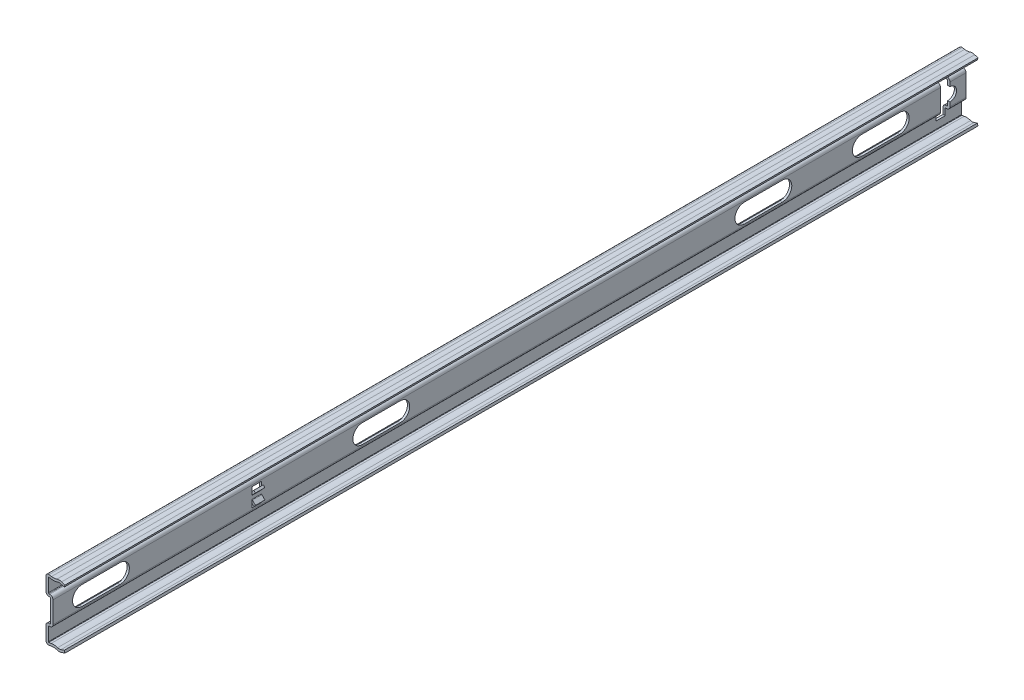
ISO-10303-21;
HEADER;
FILE_DESCRIPTION(('STEP AP214'),'2;1');
FILE_NAME('part.step','',(''),(''),'','','');
FILE_SCHEMA(('AUTOMOTIVE_DESIGN { 1 0 10303 214 1 1 1 1 }'));
ENDSEC;
DATA;
#1=APPLICATION_CONTEXT('core data for automotive mechanical design processes');
#2=APPLICATION_PROTOCOL_DEFINITION('international standard','automotive_design',2000,#1);
#3=PRODUCT_CONTEXT('',#1,'mechanical');
#4=PRODUCT('Part','Part','',(#3));
#5=PRODUCT_RELATED_PRODUCT_CATEGORY('part','',(#4));
#6=PRODUCT_DEFINITION_FORMATION('','',#4);
#7=PRODUCT_DEFINITION_CONTEXT('part definition',#1,'design');
#8=PRODUCT_DEFINITION('design','',#6,#7);
#9=PRODUCT_DEFINITION_SHAPE('','',#8);
#10=(LENGTH_UNIT() NAMED_UNIT(*) SI_UNIT(.MILLI.,.METRE.));
#11=(NAMED_UNIT(*) PLANE_ANGLE_UNIT() SI_UNIT($,.RADIAN.));
#12=(NAMED_UNIT(*) SI_UNIT($,.STERADIAN.) SOLID_ANGLE_UNIT());
#13=UNCERTAINTY_MEASURE_WITH_UNIT(LENGTH_MEASURE(1.E-05),#10,'distance_accuracy_value','');
#14=(GEOMETRIC_REPRESENTATION_CONTEXT(3) GLOBAL_UNCERTAINTY_ASSIGNED_CONTEXT((#13)) GLOBAL_UNIT_ASSIGNED_CONTEXT((#10,
#11,#12)) REPRESENTATION_CONTEXT('',''));
#15=CARTESIAN_POINT('',(0.,0.,0.));
#16=DIRECTION('',(0.,0.,1.));
#17=DIRECTION('',(1.,0.,0.));
#18=AXIS2_PLACEMENT_3D('',#15,#16,#17);
#19=CARTESIAN_POINT('',(5.36754753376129,-15.0090529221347,241.));
#20=DIRECTION('',(-0.309838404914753,0.95078923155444,0.));
#21=DIRECTION('',(-0.95078923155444,-0.309838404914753,0.));
#22=AXIS2_PLACEMENT_3D('',#19,#20,#21);
#23=PLANE('',#22);
#24=DIRECTION('',(-0.950789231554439,-0.309838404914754,0.));
#25=VECTOR('',#24,1.);
#26=CARTESIAN_POINT('',(7.1281939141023,-14.4353023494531,241.));
#27=LINE('',#26,#25);
#28=CARTESIAN_POINT('',(7.1281939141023,-14.4353023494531,241.));
#29=VERTEX_POINT('',#28);
#30=CARTESIAN_POINT('',(5.3675475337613,-15.0090529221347,241.));
#31=VERTEX_POINT('',#30);
#32=EDGE_CURVE('E1252',#29,#31,#27,.T.);
#33=ORIENTED_EDGE('',*,*,#32,.F.);
#34=DIRECTION('',(0.,0.,1.));
#35=VECTOR('',#34,1.);
#36=CARTESIAN_POINT('',(7.1281939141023,-14.4353023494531,241.));
#37=LINE('',#36,#35);
#38=CARTESIAN_POINT('',(7.1281939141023,-14.4353023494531,-241.));
#39=VERTEX_POINT('',#38);
#40=EDGE_CURVE('E1241',#39,#29,#37,.T.);
#41=ORIENTED_EDGE('',*,*,#40,.F.);
#42=DIRECTION('',(0.950789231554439,0.309838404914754,0.));
#43=VECTOR('',#42,1.);
#44=CARTESIAN_POINT('',(5.36754753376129,-15.0090529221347,-241.));
#45=LINE('',#44,#43);
#46=CARTESIAN_POINT('',(5.36754753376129,-15.0090529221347,-241.));
#47=VERTEX_POINT('',#46);
#48=EDGE_CURVE('E540',#47,#39,#45,.T.);
#49=ORIENTED_EDGE('',*,*,#48,.F.);
#50=DIRECTION('',(0.,0.,-1.));
#51=VECTOR('',#50,1.);
#52=CARTESIAN_POINT('',(5.36754753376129,-15.0090529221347,241.));
#53=LINE('',#52,#51);
#54=EDGE_CURVE('E1228',#47,#31,#53,.F.);
#55=ORIENTED_EDGE('',*,*,#54,.T.);
#56=EDGE_LOOP('',(#33,#41,#49,#55));
#57=FACE_BOUND('',#56,.T.);
#58=ADVANCED_FACE('F17',(#57),#23,.T.);
#59=CARTESIAN_POINT('',(5.36754753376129,15.0090529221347,241.));
#60=DIRECTION('',(-0.309838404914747,-0.950789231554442,0.));
#61=DIRECTION('',(0.950789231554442,-0.309838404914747,0.));
#62=AXIS2_PLACEMENT_3D('',#59,#60,#61);
#63=PLANE('',#62);
#64=DIRECTION('',(0.950789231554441,-0.30983840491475,0.));
#65=VECTOR('',#64,1.);
#66=CARTESIAN_POINT('',(5.36754753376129,15.0090529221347,241.));
#67=LINE('',#66,#65);
#68=CARTESIAN_POINT('',(5.36754753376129,15.0090529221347,241.));
#69=VERTEX_POINT('',#68);
#70=CARTESIAN_POINT('',(7.1281939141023,14.4353023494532,241.));
#71=VERTEX_POINT('',#70);
#72=EDGE_CURVE('E1200',#69,#71,#67,.T.);
#73=ORIENTED_EDGE('',*,*,#72,.F.);
#74=DIRECTION('',(0.,0.,-1.));
#75=VECTOR('',#74,1.);
#76=CARTESIAN_POINT('',(5.36754753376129,15.0090529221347,241.));
#77=LINE('',#76,#75);
#78=CARTESIAN_POINT('',(5.36754753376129,15.0090529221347,-241.));
#79=VERTEX_POINT('',#78);
#80=EDGE_CURVE('E1203',#69,#79,#77,.T.);
#81=ORIENTED_EDGE('',*,*,#80,.T.);
#82=DIRECTION('',(0.950789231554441,-0.309838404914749,0.));
#83=VECTOR('',#82,1.);
#84=CARTESIAN_POINT('',(5.36754753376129,15.0090529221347,-241.));
#85=LINE('',#84,#83);
#86=CARTESIAN_POINT('',(7.1281939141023,14.4353023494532,-241.));
#87=VERTEX_POINT('',#86);
#88=EDGE_CURVE('E1190',#79,#87,#85,.T.);
#89=ORIENTED_EDGE('',*,*,#88,.T.);
#90=DIRECTION('',(0.,0.,1.));
#91=VECTOR('',#90,1.);
#92=CARTESIAN_POINT('',(7.1281939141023,14.4353023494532,241.));
#93=LINE('',#92,#91);
#94=EDGE_CURVE('E1208',#71,#87,#93,.F.);
#95=ORIENTED_EDGE('',*,*,#94,.F.);
#96=EDGE_LOOP('',(#73,#81,#89,#95));
#97=FACE_BOUND('',#96,.T.);
#98=ADVANCED_FACE('F1519',(#97),#63,.T.);
#99=CARTESIAN_POINT('',(7.1281939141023,-14.4353023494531,241.));
#100=DIRECTION('',(0.95078923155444,0.309838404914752,0.));
#101=DIRECTION('',(-0.309838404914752,0.95078923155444,0.));
#102=AXIS2_PLACEMENT_3D('',#99,#100,#101);
#103=PLANE('',#102);
#104=DIRECTION('',(-0.309838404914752,0.95078923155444,0.));
#105=VECTOR('',#104,1.);
#106=CARTESIAN_POINT('',(7.1281939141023,-14.4353023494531,241.));
#107=LINE('',#106,#105);
#108=CARTESIAN_POINT('',(7.5,-15.5762494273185,241.));
#109=VERTEX_POINT('',#108);
#110=EDGE_CURVE('E1239',#29,#109,#107,.F.);
#111=ORIENTED_EDGE('',*,*,#110,.T.);
#112=DIRECTION('',(0.,0.,1.));
#113=VECTOR('',#112,1.);
#114=CARTESIAN_POINT('',(7.5,-15.5762494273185,241.));
#115=LINE('',#114,#113);
#116=CARTESIAN_POINT('',(7.5,-15.5762494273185,-241.));
#117=VERTEX_POINT('',#116);
#118=EDGE_CURVE('E1175',#109,#117,#115,.F.);
#119=ORIENTED_EDGE('',*,*,#118,.T.);
#120=DIRECTION('',(0.309838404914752,-0.95078923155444,0.));
#121=VECTOR('',#120,1.);
#122=CARTESIAN_POINT('',(7.1281939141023,-14.4353023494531,-241.));
#123=LINE('',#122,#121);
#124=EDGE_CURVE('E1231',#39,#117,#123,.T.);
#125=ORIENTED_EDGE('',*,*,#124,.F.);
#126=ORIENTED_EDGE('',*,*,#40,.T.);
#127=EDGE_LOOP('',(#111,#119,#125,#126));
#128=FACE_BOUND('',#127,.T.);
#129=ADVANCED_FACE('F1578',(#128),#103,.T.);
#130=CARTESIAN_POINT('',(4.5,-12.3468430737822,241.));
#131=DIRECTION('',(0.,0.,-1.));
#132=DIRECTION('',(-1.,0.,0.));
#133=AXIS2_PLACEMENT_3D('',#130,#131,#132);
#134=CYLINDRICAL_SURFACE('',#133,2.8);
#135=DIRECTION('',(0.,0.,-1.));
#136=VECTOR('',#135,1.);
#137=CARTESIAN_POINT('',(3.63245246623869,-15.0090529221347,241.));
#138=LINE('',#137,#136);
#139=CARTESIAN_POINT('',(3.63245246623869,-15.0090529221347,241.));
#140=VERTEX_POINT('',#139);
#141=CARTESIAN_POINT('',(3.63245246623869,-15.0090529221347,-241.));
#142=VERTEX_POINT('',#141);
#143=EDGE_CURVE('E1162',#140,#142,#138,.T.);
#144=ORIENTED_EDGE('',*,*,#143,.F.);
#145=CARTESIAN_POINT('',(4.5,-12.3468430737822,241.));
#146=DIRECTION('',(0.,0.,-1.));
#147=DIRECTION('',(-1.,0.,0.));
#148=AXIS2_PLACEMENT_3D('',#145,#146,#147);
#149=CIRCLE('',#148,2.8);
#150=EDGE_CURVE('E1166',#31,#140,#149,.T.);
#151=ORIENTED_EDGE('',*,*,#150,.F.);
#152=ORIENTED_EDGE('',*,*,#54,.F.);
#153=CARTESIAN_POINT('',(4.5,-12.3468430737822,-241.));
#154=DIRECTION('',(0.,0.,-1.));
#155=DIRECTION('',(-1.,0.,0.));
#156=AXIS2_PLACEMENT_3D('',#153,#154,#155);
#157=CIRCLE('',#156,2.8);
#158=EDGE_CURVE('E1176',#142,#47,#157,.F.);
#159=ORIENTED_EDGE('',*,*,#158,.F.);
#160=EDGE_LOOP('',(#144,#151,#152,#159));
#161=FACE_BOUND('',#160,.T.);
#162=ADVANCED_FACE('F1572',(#161),#134,.F.);
#163=CARTESIAN_POINT('',(7.5,15.5762494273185,241.));
#164=DIRECTION('',(0.950789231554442,-0.309838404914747,0.));
#165=DIRECTION('',(0.309838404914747,0.950789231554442,0.));
#166=AXIS2_PLACEMENT_3D('',#163,#164,#165);
#167=PLANE('',#166);
#168=DIRECTION('',(0.309838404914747,0.950789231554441,0.));
#169=VECTOR('',#168,1.);
#170=CARTESIAN_POINT('',(7.1281939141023,14.4353023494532,241.));
#171=LINE('',#170,#169);
#172=CARTESIAN_POINT('',(7.5,15.5762494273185,241.));
#173=VERTEX_POINT('',#172);
#174=EDGE_CURVE('E1191',#71,#173,#171,.T.);
#175=ORIENTED_EDGE('',*,*,#174,.F.);
#176=ORIENTED_EDGE('',*,*,#94,.T.);
#177=DIRECTION('',(0.309838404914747,0.950789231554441,0.));
#178=VECTOR('',#177,1.);
#179=CARTESIAN_POINT('',(7.1281939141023,14.4353023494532,-241.));
#180=LINE('',#179,#178);
#181=CARTESIAN_POINT('',(7.5,15.5762494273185,-241.));
#182=VERTEX_POINT('',#181);
#183=EDGE_CURVE('E1187',#87,#182,#180,.T.);
#184=ORIENTED_EDGE('',*,*,#183,.T.);
#185=DIRECTION('',(0.,0.,1.));
#186=VECTOR('',#185,1.);
#187=CARTESIAN_POINT('',(7.5,15.5762494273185,241.));
#188=LINE('',#187,#186);
#189=EDGE_CURVE('E1137',#182,#173,#188,.T.);
#190=ORIENTED_EDGE('',*,*,#189,.T.);
#191=EDGE_LOOP('',(#175,#176,#184,#190));
#192=FACE_BOUND('',#191,.T.);
#193=ADVANCED_FACE('F1515',(#192),#167,.T.);
#194=CARTESIAN_POINT('',(1.2,5.6500000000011,241.));
#195=DIRECTION('',(1.,0.,0.));
#196=DIRECTION('',(0.,1.,0.));
#197=AXIS2_PLACEMENT_3D('',#194,#195,#196);
#198=PLANE('',#197);
#199=DIRECTION('',(0.,1.,0.));
#200=VECTOR('',#199,1.);
#201=CARTESIAN_POINT('',(1.2,11.,-232.5));
#202=LINE('',#201,#200);
#203=CARTESIAN_POINT('',(1.2,5.6500000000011,-232.5));
#204=VERTEX_POINT('',#203);
#205=CARTESIAN_POINT('',(1.2,3.5,-232.5));
#206=VERTEX_POINT('',#205);
#207=EDGE_CURVE('E1159',#204,#206,#202,.F.);
#208=ORIENTED_EDGE('',*,*,#207,.T.);
#209=CARTESIAN_POINT('',(1.2,0.,-232.5));
#210=DIRECTION('',(-1.,0.,0.));
#211=DIRECTION('',(0.,0.,1.));
#212=AXIS2_PLACEMENT_3D('',#209,#210,#211);
#213=CIRCLE('',#212,3.5);
#214=CARTESIAN_POINT('',(1.2,-3.5,-232.5));
#215=VERTEX_POINT('',#214);
#216=EDGE_CURVE('E1154',#206,#215,#213,.T.);
#217=ORIENTED_EDGE('',*,*,#216,.T.);
#218=DIRECTION('',(0.,1.,0.));
#219=VECTOR('',#218,1.);
#220=CARTESIAN_POINT('',(1.2,-3.5,-232.5));
#221=LINE('',#220,#219);
#222=CARTESIAN_POINT('',(1.2,-5.6500000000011,-232.5));
#223=VERTEX_POINT('',#222);
#224=EDGE_CURVE('E1153',#215,#223,#221,.F.);
#225=ORIENTED_EDGE('',*,*,#224,.T.);
#226=DIRECTION('',(0.,0.,-1.));
#227=VECTOR('',#226,1.);
#228=CARTESIAN_POINT('',(1.2,-5.6500000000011,241.));
#229=LINE('',#228,#227);
#230=CARTESIAN_POINT('',(1.2,-5.6500000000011,-241.));
#231=VERTEX_POINT('',#230);
#232=EDGE_CURVE('E1223',#231,#223,#229,.F.);
#233=ORIENTED_EDGE('',*,*,#232,.F.);
#234=DIRECTION('',(0.,1.,0.));
#235=VECTOR('',#234,1.);
#236=CARTESIAN_POINT('',(1.2,7.3500000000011,-241.));
#237=LINE('',#236,#235);
#238=CARTESIAN_POINT('',(1.2,5.6500000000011,-241.));
#239=VERTEX_POINT('',#238);
#240=EDGE_CURVE('E1220',#239,#231,#237,.F.);
#241=ORIENTED_EDGE('',*,*,#240,.F.);
#242=DIRECTION('',(0.,0.,-1.));
#243=VECTOR('',#242,1.);
#244=CARTESIAN_POINT('',(1.2,5.6500000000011,241.));
#245=LINE('',#244,#243);
#246=EDGE_CURVE('E1184',#204,#239,#245,.T.);
#247=ORIENTED_EDGE('',*,*,#246,.F.);
#248=EDGE_LOOP('',(#208,#217,#225,#233,#241,#247));
#249=FACE_BOUND('',#248,.T.);
#250=ADVANCED_FACE('F1463',(#249),#198,.T.);
#251=CARTESIAN_POINT('',(4.5,12.3468430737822,241.));
#252=DIRECTION('',(0.,0.,-1.));
#253=DIRECTION('',(-1.,0.,0.));
#254=AXIS2_PLACEMENT_3D('',#251,#252,#253);
#255=CYLINDRICAL_SURFACE('',#254,2.8);
#256=ORIENTED_EDGE('',*,*,#80,.F.);
#257=CARTESIAN_POINT('',(4.5,12.3468430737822,241.));
#258=DIRECTION('',(0.,0.,-1.));
#259=DIRECTION('',(-1.,0.,0.));
#260=AXIS2_PLACEMENT_3D('',#257,#258,#259);
#261=CIRCLE('',#260,2.8);
#262=CARTESIAN_POINT('',(3.63245246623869,15.0090529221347,241.));
#263=VERTEX_POINT('',#262);
#264=EDGE_CURVE('E1196',#263,#69,#261,.T.);
#265=ORIENTED_EDGE('',*,*,#264,.F.);
#266=DIRECTION('',(0.,0.,-1.));
#267=VECTOR('',#266,1.);
#268=CARTESIAN_POINT('',(3.63245246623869,15.0090529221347,241.));
#269=LINE('',#268,#267);
#270=CARTESIAN_POINT('',(3.63245246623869,15.0090529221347,-241.));
#271=VERTEX_POINT('',#270);
#272=EDGE_CURVE('E1128',#271,#263,#269,.F.);
#273=ORIENTED_EDGE('',*,*,#272,.F.);
#274=CARTESIAN_POINT('',(4.5,12.3468430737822,-241.));
#275=DIRECTION('',(0.,0.,-1.));
#276=DIRECTION('',(-1.,0.,0.));
#277=AXIS2_PLACEMENT_3D('',#274,#275,#276);
#278=CIRCLE('',#277,2.8);
#279=EDGE_CURVE('E1218',#79,#271,#278,.F.);
#280=ORIENTED_EDGE('',*,*,#279,.F.);
#281=EDGE_LOOP('',(#256,#265,#273,#280));
#282=FACE_BOUND('',#281,.T.);
#283=ADVANCED_FACE('F1524',(#282),#255,.F.);
#284=CARTESIAN_POINT('',(5.73935361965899,-16.15,241.));
#285=DIRECTION('',(-0.309838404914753,0.95078923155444,0.));
#286=DIRECTION('',(-0.95078923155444,-0.309838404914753,0.));
#287=AXIS2_PLACEMENT_3D('',#284,#285,#286);
#288=PLANE('',#287);
#289=ORIENTED_EDGE('',*,*,#118,.F.);
#290=DIRECTION('',(-0.95078923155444,-0.309838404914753,0.));
#291=VECTOR('',#290,1.);
#292=CARTESIAN_POINT('',(5.73935361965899,-16.15,241.));
#293=LINE('',#292,#291);
#294=CARTESIAN_POINT('',(5.739353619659,-16.15,241.));
#295=VERTEX_POINT('',#294);
#296=EDGE_CURVE('E1172',#295,#109,#293,.F.);
#297=ORIENTED_EDGE('',*,*,#296,.F.);
#298=DIRECTION('',(0.,0.,-1.));
#299=VECTOR('',#298,1.);
#300=CARTESIAN_POINT('',(5.73935361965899,-16.15,241.));
#301=LINE('',#300,#299);
#302=CARTESIAN_POINT('',(5.739353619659,-16.15,-241.));
#303=VERTEX_POINT('',#302);
#304=EDGE_CURVE('E1167',#303,#295,#301,.F.);
#305=ORIENTED_EDGE('',*,*,#304,.F.);
#306=DIRECTION('',(-0.95078923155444,-0.309838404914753,0.));
#307=VECTOR('',#306,1.);
#308=CARTESIAN_POINT('',(5.73935361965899,-16.15,-241.));
#309=LINE('',#308,#307);
#310=EDGE_CURVE('E1179',#117,#303,#309,.T.);
#311=ORIENTED_EDGE('',*,*,#310,.F.);
#312=EDGE_LOOP('',(#289,#297,#305,#311));
#313=FACE_BOUND('',#312,.T.);
#314=ADVANCED_FACE('F1583',(#313),#288,.F.);
#315=CARTESIAN_POINT('',(1.40161595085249,-21.8547353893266,241.));
#316=DIRECTION('',(0.,0.,-1.));
#317=DIRECTION('',(-1.,0.,0.));
#318=AXIS2_PLACEMENT_3D('',#315,#316,#317);
#319=CYLINDRICAL_SURFACE('',#318,7.2);
#320=CARTESIAN_POINT('',(1.40161595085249,-21.8547353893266,241.));
#321=DIRECTION('',(0.,0.,-1.));
#322=DIRECTION('',(-1.,0.,0.));
#323=AXIS2_PLACEMENT_3D('',#320,#321,#322);
#324=CIRCLE('',#323,7.2);
#325=CARTESIAN_POINT('',(0.221512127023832,-14.7521052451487,241.));
#326=VERTEX_POINT('',#325);
#327=EDGE_CURVE('E1131',#140,#326,#324,.F.);
#328=ORIENTED_EDGE('',*,*,#327,.F.);
#329=ORIENTED_EDGE('',*,*,#143,.T.);
#330=CARTESIAN_POINT('',(1.40161595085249,-21.8547353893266,-241.));
#331=DIRECTION('',(0.,0.,-1.));
#332=DIRECTION('',(-1.,0.,0.));
#333=AXIS2_PLACEMENT_3D('',#330,#331,#332);
#334=CIRCLE('',#333,7.2);
#335=CARTESIAN_POINT('',(0.221512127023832,-14.7521052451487,-241.));
#336=VERTEX_POINT('',#335);
#337=EDGE_CURVE('E1124',#336,#142,#334,.T.);
#338=ORIENTED_EDGE('',*,*,#337,.F.);
#339=DIRECTION('',(0.,0.,1.));
#340=VECTOR('',#339,1.);
#341=CARTESIAN_POINT('',(0.221512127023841,-14.7521052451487,241.));
#342=LINE('',#341,#340);
#343=EDGE_CURVE('E1121',#326,#336,#342,.F.);
#344=ORIENTED_EDGE('',*,*,#343,.F.);
#345=EDGE_LOOP('',(#328,#329,#338,#344));
#346=FACE_BOUND('',#345,.T.);
#347=ADVANCED_FACE('F1569',(#346),#319,.T.);
#348=CARTESIAN_POINT('',(-0.499999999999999,-5.6500000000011,241.));
#349=DIRECTION('',(0.,0.,-1.));
#350=DIRECTION('',(-1.,0.,0.));
#351=AXIS2_PLACEMENT_3D('',#348,#349,#350);
#352=CYLINDRICAL_SURFACE('',#351,1.7);
#353=CARTESIAN_POINT('',(-0.499999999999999,-5.6500000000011,-241.));
#354=DIRECTION('',(0.,0.,-1.));
#355=DIRECTION('',(-1.,0.,0.));
#356=AXIS2_PLACEMENT_3D('',#353,#354,#355);
#357=CIRCLE('',#356,1.7);
#358=CARTESIAN_POINT('',(-0.499999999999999,-7.3500000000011,-241.));
#359=VERTEX_POINT('',#358);
#360=EDGE_CURVE('E1227',#359,#231,#357,.F.);
#361=ORIENTED_EDGE('',*,*,#360,.T.);
#362=ORIENTED_EDGE('',*,*,#232,.T.);
#363=CARTESIAN_POINT('',(-0.499999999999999,-5.6500000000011,-232.5));
#364=DIRECTION('',(0.,0.,-1.));
#365=DIRECTION('',(-1.,0.,0.));
#366=AXIS2_PLACEMENT_3D('',#363,#364,#365);
#367=CIRCLE('',#366,1.7);
#368=CARTESIAN_POINT('',(-0.499999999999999,-7.3500000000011,-232.5));
#369=VERTEX_POINT('',#368);
#370=EDGE_CURVE('E1165',#223,#369,#367,.T.);
#371=ORIENTED_EDGE('',*,*,#370,.T.);
#372=DIRECTION('',(0.,0.,-1.));
#373=VECTOR('',#372,1.);
#374=CARTESIAN_POINT('',(-0.499999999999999,-7.3500000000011,241.));
#375=LINE('',#374,#373);
#376=EDGE_CURVE('E1118',#359,#369,#375,.F.);
#377=ORIENTED_EDGE('',*,*,#376,.F.);
#378=EDGE_LOOP('',(#361,#362,#371,#377));
#379=FACE_BOUND('',#378,.T.);
#380=ADVANCED_FACE('F1459',(#379),#352,.T.);
#381=CARTESIAN_POINT('',(7.5,0.,-232.5));
#382=DIRECTION('',(-1.,0.,0.));
#383=DIRECTION('',(0.,0.,1.));
#384=AXIS2_PLACEMENT_3D('',#381,#382,#383);
#385=CYLINDRICAL_SURFACE('',#384,3.5);
#386=DIRECTION('',(-1.,0.,0.));
#387=VECTOR('',#386,1.);
#388=CARTESIAN_POINT('',(7.5,3.5,-232.5));
#389=LINE('',#388,#387);
#390=CARTESIAN_POINT('',(0.,3.5,-232.5));
#391=VERTEX_POINT('',#390);
#392=EDGE_CURVE('E1156',#391,#206,#389,.F.);
#393=ORIENTED_EDGE('',*,*,#392,.F.);
#394=CARTESIAN_POINT('',(0.,0.,-232.5));
#395=DIRECTION('',(-1.,0.,0.));
#396=DIRECTION('',(0.,0.,1.));
#397=AXIS2_PLACEMENT_3D('',#394,#395,#396);
#398=CIRCLE('',#397,3.5);
#399=CARTESIAN_POINT('',(0.,-3.5,-232.5));
#400=VERTEX_POINT('',#399);
#401=EDGE_CURVE('E1113',#391,#400,#398,.T.);
#402=ORIENTED_EDGE('',*,*,#401,.T.);
#403=DIRECTION('',(-1.,0.,0.));
#404=VECTOR('',#403,1.);
#405=CARTESIAN_POINT('',(7.5,-3.5,-232.5));
#406=LINE('',#405,#404);
#407=EDGE_CURVE('E1150',#400,#215,#406,.F.);
#408=ORIENTED_EDGE('',*,*,#407,.T.);
#409=ORIENTED_EDGE('',*,*,#216,.F.);
#410=EDGE_LOOP('',(#393,#402,#408,#409));
#411=FACE_BOUND('',#410,.T.);
#412=ADVANCED_FACE('F1467',(#411),#385,.F.);
#413=CARTESIAN_POINT('',(5.73935361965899,16.15,241.));
#414=DIRECTION('',(-0.309838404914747,-0.950789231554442,0.));
#415=DIRECTION('',(0.950789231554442,-0.309838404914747,0.));
#416=AXIS2_PLACEMENT_3D('',#413,#414,#415);
#417=PLANE('',#416);
#418=DIRECTION('',(0.,0.,-1.));
#419=VECTOR('',#418,1.);
#420=CARTESIAN_POINT('',(5.73935361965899,16.15,241.));
#421=LINE('',#420,#419);
#422=CARTESIAN_POINT('',(5.73935361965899,16.15,241.));
#423=VERTEX_POINT('',#422);
#424=CARTESIAN_POINT('',(5.73935361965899,16.15,-241.));
#425=VERTEX_POINT('',#424);
#426=EDGE_CURVE('E1140',#423,#425,#421,.T.);
#427=ORIENTED_EDGE('',*,*,#426,.F.);
#428=DIRECTION('',(0.950789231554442,-0.309838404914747,0.));
#429=VECTOR('',#428,1.);
#430=CARTESIAN_POINT('',(5.73935361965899,16.15,241.));
#431=LINE('',#430,#429);
#432=EDGE_CURVE('E1133',#173,#423,#431,.F.);
#433=ORIENTED_EDGE('',*,*,#432,.F.);
#434=ORIENTED_EDGE('',*,*,#189,.F.);
#435=DIRECTION('',(0.950789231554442,-0.309838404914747,0.));
#436=VECTOR('',#435,1.);
#437=CARTESIAN_POINT('',(5.73935361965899,16.15,-241.));
#438=LINE('',#437,#436);
#439=EDGE_CURVE('E1136',#425,#182,#438,.T.);
#440=ORIENTED_EDGE('',*,*,#439,.F.);
#441=EDGE_LOOP('',(#427,#433,#434,#440));
#442=FACE_BOUND('',#441,.T.);
#443=ADVANCED_FACE('F1512',(#442),#417,.F.);
#444=CARTESIAN_POINT('',(-0.5,5.6500000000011,241.));
#445=DIRECTION('',(0.,0.,-1.));
#446=DIRECTION('',(-1.,0.,0.));
#447=AXIS2_PLACEMENT_3D('',#444,#445,#446);
#448=CYLINDRICAL_SURFACE('',#447,1.7);
#449=CARTESIAN_POINT('',(-0.5,5.6500000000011,-241.));
#450=DIRECTION('',(0.,0.,-1.));
#451=DIRECTION('',(-1.,0.,0.));
#452=AXIS2_PLACEMENT_3D('',#449,#450,#451);
#453=CIRCLE('',#452,1.7);
#454=CARTESIAN_POINT('',(-0.5,7.3500000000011,-241.));
#455=VERTEX_POINT('',#454);
#456=EDGE_CURVE('E1132',#239,#455,#453,.F.);
#457=ORIENTED_EDGE('',*,*,#456,.T.);
#458=DIRECTION('',(0.,0.,1.));
#459=VECTOR('',#458,1.);
#460=CARTESIAN_POINT('',(-0.5,7.3500000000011,241.));
#461=LINE('',#460,#459);
#462=CARTESIAN_POINT('',(-0.5,7.3500000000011,-232.5));
#463=VERTEX_POINT('',#462);
#464=EDGE_CURVE('E1103',#463,#455,#461,.F.);
#465=ORIENTED_EDGE('',*,*,#464,.F.);
#466=CARTESIAN_POINT('',(-0.5,5.6500000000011,-232.5));
#467=DIRECTION('',(0.,0.,-1.));
#468=DIRECTION('',(-1.,0.,0.));
#469=AXIS2_PLACEMENT_3D('',#466,#467,#468);
#470=CIRCLE('',#469,1.7);
#471=EDGE_CURVE('E1147',#463,#204,#470,.T.);
#472=ORIENTED_EDGE('',*,*,#471,.T.);
#473=ORIENTED_EDGE('',*,*,#246,.T.);
#474=EDGE_LOOP('',(#457,#465,#472,#473));
#475=FACE_BOUND('',#474,.T.);
#476=ADVANCED_FACE('F1552',(#475),#448,.T.);
#477=CARTESIAN_POINT('',(1.40161595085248,21.8547353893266,241.));
#478=DIRECTION('',(0.,0.,-1.));
#479=DIRECTION('',(-1.,0.,0.));
#480=AXIS2_PLACEMENT_3D('',#477,#478,#479);
#481=CYLINDRICAL_SURFACE('',#480,7.2);
#482=CARTESIAN_POINT('',(1.40161595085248,21.8547353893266,241.));
#483=DIRECTION('',(0.,0.,-1.));
#484=DIRECTION('',(-1.,0.,0.));
#485=AXIS2_PLACEMENT_3D('',#482,#483,#484);
#486=CIRCLE('',#485,7.2);
#487=CARTESIAN_POINT('',(0.221512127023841,14.7521052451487,241.));
#488=VERTEX_POINT('',#487);
#489=EDGE_CURVE('E1143',#488,#263,#486,.F.);
#490=ORIENTED_EDGE('',*,*,#489,.F.);
#491=DIRECTION('',(0.,0.,1.));
#492=VECTOR('',#491,1.);
#493=CARTESIAN_POINT('',(0.221512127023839,14.7521052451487,241.));
#494=LINE('',#493,#492);
#495=CARTESIAN_POINT('',(0.221512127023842,14.7521052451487,-241.));
#496=VERTEX_POINT('',#495);
#497=EDGE_CURVE('E1099',#496,#488,#494,.T.);
#498=ORIENTED_EDGE('',*,*,#497,.F.);
#499=CARTESIAN_POINT('',(1.40161595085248,21.8547353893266,-241.));
#500=DIRECTION('',(0.,0.,-1.));
#501=DIRECTION('',(-1.,0.,0.));
#502=AXIS2_PLACEMENT_3D('',#499,#500,#501);
#503=CIRCLE('',#502,7.2);
#504=EDGE_CURVE('E1109',#271,#496,#503,.T.);
#505=ORIENTED_EDGE('',*,*,#504,.F.);
#506=ORIENTED_EDGE('',*,*,#272,.T.);
#507=EDGE_LOOP('',(#490,#498,#505,#506));
#508=FACE_BOUND('',#507,.T.);
#509=ADVANCED_FACE('F1530',(#508),#481,.T.);
#510=CARTESIAN_POINT('',(4.5,-12.3468430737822,241.));
#511=DIRECTION('',(0.,0.,-1.));
#512=DIRECTION('',(-1.,0.,0.));
#513=AXIS2_PLACEMENT_3D('',#510,#511,#512);
#514=CYLINDRICAL_SURFACE('',#513,4.);
#515=CARTESIAN_POINT('',(4.5,-12.3468430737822,241.));
#516=DIRECTION('',(0.,0.,-1.));
#517=DIRECTION('',(-1.,0.,0.));
#518=AXIS2_PLACEMENT_3D('',#515,#516,#517);
#519=CIRCLE('',#518,4.);
#520=CARTESIAN_POINT('',(3.26064638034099,-16.15,241.));
#521=VERTEX_POINT('',#520);
#522=EDGE_CURVE('E1170',#295,#521,#519,.T.);
#523=ORIENTED_EDGE('',*,*,#522,.T.);
#524=DIRECTION('',(0.,0.,-1.));
#525=VECTOR('',#524,1.);
#526=CARTESIAN_POINT('',(3.26064638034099,-16.15,241.));
#527=LINE('',#526,#525);
#528=CARTESIAN_POINT('',(3.26064638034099,-16.15,-241.));
#529=VERTEX_POINT('',#528);
#530=EDGE_CURVE('E1125',#521,#529,#527,.T.);
#531=ORIENTED_EDGE('',*,*,#530,.T.);
#532=CARTESIAN_POINT('',(4.5,-12.3468430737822,-241.));
#533=DIRECTION('',(0.,0.,-1.));
#534=DIRECTION('',(-1.,0.,0.));
#535=AXIS2_PLACEMENT_3D('',#532,#533,#534);
#536=CIRCLE('',#535,4.);
#537=EDGE_CURVE('E1171',#529,#303,#536,.F.);
#538=ORIENTED_EDGE('',*,*,#537,.T.);
#539=ORIENTED_EDGE('',*,*,#304,.T.);
#540=EDGE_LOOP('',(#523,#531,#538,#539));
#541=FACE_BOUND('',#540,.T.);
#542=ADVANCED_FACE('F1586',(#541),#514,.T.);
#543=CARTESIAN_POINT('',(-1.06721933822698,-14.9662283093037,241.));
#544=DIRECTION('',(-0.163903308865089,0.986476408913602,0.));
#545=DIRECTION('',(-0.986476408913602,-0.163903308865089,0.));
#546=AXIS2_PLACEMENT_3D('',#543,#544,#545);
#547=PLANE('',#546);
#548=DIRECTION('',(-0.986476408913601,-0.163903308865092,0.));
#549=VECTOR('',#548,1.);
#550=CARTESIAN_POINT('',(0.221512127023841,-14.7521052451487,241.));
#551=LINE('',#550,#549);
#552=CARTESIAN_POINT('',(-1.06721933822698,-14.9662283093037,241.));
#553=VERTEX_POINT('',#552);
#554=EDGE_CURVE('E1092',#326,#553,#551,.T.);
#555=ORIENTED_EDGE('',*,*,#554,.F.);
#556=ORIENTED_EDGE('',*,*,#343,.T.);
#557=DIRECTION('',(0.986476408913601,0.163903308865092,0.));
#558=VECTOR('',#557,1.);
#559=CARTESIAN_POINT('',(-1.06721933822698,-14.9662283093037,-241.));
#560=LINE('',#559,#558);
#561=CARTESIAN_POINT('',(-1.06721933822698,-14.9662283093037,-241.));
#562=VERTEX_POINT('',#561);
#563=EDGE_CURVE('E1094',#562,#336,#560,.T.);
#564=ORIENTED_EDGE('',*,*,#563,.F.);
#565=DIRECTION('',(0.,0.,-1.));
#566=VECTOR('',#565,1.);
#567=CARTESIAN_POINT('',(-1.06721933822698,-14.9662283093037,241.));
#568=LINE('',#567,#566);
#569=EDGE_CURVE('E1082',#562,#553,#568,.F.);
#570=ORIENTED_EDGE('',*,*,#569,.T.);
#571=EDGE_LOOP('',(#555,#556,#564,#570));
#572=FACE_BOUND('',#571,.T.);
#573=ADVANCED_FACE('F1562',(#572),#547,.T.);
#574=CARTESIAN_POINT('',(-1.,-7.3500000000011,241.));
#575=DIRECTION('',(0.,-1.,0.));
#576=DIRECTION('',(0.,0.,-1.));
#577=AXIS2_PLACEMENT_3D('',#574,#575,#576);
#578=PLANE('',#577);
#579=DIRECTION('',(-1.,0.,0.));
#580=VECTOR('',#579,1.);
#581=CARTESIAN_POINT('',(1.2,-7.3500000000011,-241.));
#582=LINE('',#581,#580);
#583=CARTESIAN_POINT('',(-1.,-7.3500000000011,-241.));
#584=VERTEX_POINT('',#583);
#585=EDGE_CURVE('E1083',#359,#584,#582,.T.);
#586=ORIENTED_EDGE('',*,*,#585,.F.);
#587=ORIENTED_EDGE('',*,*,#376,.T.);
#588=DIRECTION('',(-1.,0.,0.));
#589=VECTOR('',#588,1.);
#590=CARTESIAN_POINT('',(7.5,-7.3500000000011,-232.5));
#591=LINE('',#590,#589);
#592=CARTESIAN_POINT('',(-1.,-7.3500000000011,-232.5));
#593=VERTEX_POINT('',#592);
#594=EDGE_CURVE('E1085',#369,#593,#591,.T.);
#595=ORIENTED_EDGE('',*,*,#594,.T.);
#596=DIRECTION('',(0.,0.,-1.));
#597=VECTOR('',#596,1.);
#598=CARTESIAN_POINT('',(-1.,-7.3500000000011,241.));
#599=LINE('',#598,#597);
#600=EDGE_CURVE('E1079',#593,#584,#599,.T.);
#601=ORIENTED_EDGE('',*,*,#600,.T.);
#602=EDGE_LOOP('',(#586,#587,#595,#601));
#603=FACE_BOUND('',#602,.T.);
#604=ADVANCED_FACE('F1454',(#603),#578,.T.);
#605=CARTESIAN_POINT('',(0.,5.6500000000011,241.));
#606=DIRECTION('',(1.,0.,0.));
#607=DIRECTION('',(0.,1.,0.));
#608=AXIS2_PLACEMENT_3D('',#605,#606,#607);
#609=PLANE('',#608);
#610=DIRECTION('',(0.,1.,0.));
#611=VECTOR('',#610,1.);
#612=CARTESIAN_POINT('',(0.,5.6500000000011,-232.5));
#613=LINE('',#612,#611);
#614=CARTESIAN_POINT('',(0.,-5.6500000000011,-232.5));
#615=VERTEX_POINT('',#614);
#616=EDGE_CURVE('E1110',#400,#615,#613,.F.);
#617=ORIENTED_EDGE('',*,*,#616,.F.);
#618=ORIENTED_EDGE('',*,*,#401,.F.);
#619=DIRECTION('',(0.,1.,0.));
#620=VECTOR('',#619,1.);
#621=CARTESIAN_POINT('',(0.,5.6500000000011,-232.5));
#622=LINE('',#621,#620);
#623=CARTESIAN_POINT('',(0.,5.6500000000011,-232.5));
#624=VERTEX_POINT('',#623);
#625=EDGE_CURVE('E1114',#624,#391,#622,.F.);
#626=ORIENTED_EDGE('',*,*,#625,.F.);
#627=DIRECTION('',(0.,0.,-1.));
#628=VECTOR('',#627,1.);
#629=CARTESIAN_POINT('',(0.,5.6500000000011,241.));
#630=LINE('',#629,#628);
#631=CARTESIAN_POINT('',(0.,5.6500000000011,-241.));
#632=VERTEX_POINT('',#631);
#633=EDGE_CURVE('E1075',#624,#632,#630,.T.);
#634=ORIENTED_EDGE('',*,*,#633,.T.);
#635=DIRECTION('',(0.,1.,0.));
#636=VECTOR('',#635,1.);
#637=CARTESIAN_POINT('',(0.,5.6500000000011,-241.));
#638=LINE('',#637,#636);
#639=CARTESIAN_POINT('',(0.,-5.6500000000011,-241.));
#640=VERTEX_POINT('',#639);
#641=EDGE_CURVE('E1117',#640,#632,#638,.T.);
#642=ORIENTED_EDGE('',*,*,#641,.F.);
#643=DIRECTION('',(0.,0.,-1.));
#644=VECTOR('',#643,1.);
#645=CARTESIAN_POINT('',(0.,-5.6500000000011,241.));
#646=LINE('',#645,#644);
#647=EDGE_CURVE('E1089',#640,#615,#646,.F.);
#648=ORIENTED_EDGE('',*,*,#647,.T.);
#649=EDGE_LOOP('',(#617,#618,#626,#634,#642,#648));
#650=FACE_BOUND('',#649,.T.);
#651=ADVANCED_FACE('F1475',(#650),#609,.F.);
#652=CARTESIAN_POINT('',(4.5,12.3468430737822,241.));
#653=DIRECTION('',(0.,0.,-1.));
#654=DIRECTION('',(-1.,0.,0.));
#655=AXIS2_PLACEMENT_3D('',#652,#653,#654);
#656=CYLINDRICAL_SURFACE('',#655,4.);
#657=CARTESIAN_POINT('',(4.5,12.3468430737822,241.));
#658=DIRECTION('',(0.,0.,-1.));
#659=DIRECTION('',(-1.,0.,0.));
#660=AXIS2_PLACEMENT_3D('',#657,#658,#659);
#661=CIRCLE('',#660,4.);
#662=CARTESIAN_POINT('',(3.26064638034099,16.15,241.));
#663=VERTEX_POINT('',#662);
#664=EDGE_CURVE('E1144',#663,#423,#661,.T.);
#665=ORIENTED_EDGE('',*,*,#664,.T.);
#666=ORIENTED_EDGE('',*,*,#426,.T.);
#667=CARTESIAN_POINT('',(4.5,12.3468430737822,-241.));
#668=DIRECTION('',(0.,0.,-1.));
#669=DIRECTION('',(-1.,0.,0.));
#670=AXIS2_PLACEMENT_3D('',#667,#668,#669);
#671=CIRCLE('',#670,4.);
#672=CARTESIAN_POINT('',(3.26064638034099,16.15,-241.));
#673=VERTEX_POINT('',#672);
#674=EDGE_CURVE('E1112',#425,#673,#671,.F.);
#675=ORIENTED_EDGE('',*,*,#674,.T.);
#676=DIRECTION('',(0.,0.,-1.));
#677=VECTOR('',#676,1.);
#678=CARTESIAN_POINT('',(3.26064638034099,16.15,241.));
#679=LINE('',#678,#677);
#680=EDGE_CURVE('E1071',#673,#663,#679,.F.);
#681=ORIENTED_EDGE('',*,*,#680,.T.);
#682=EDGE_LOOP('',(#665,#666,#675,#681));
#683=FACE_BOUND('',#682,.T.);
#684=ADVANCED_FACE('F1508',(#683),#656,.T.);
#685=CARTESIAN_POINT('',(-1.,7.3500000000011,241.));
#686=DIRECTION('',(0.,1.,0.));
#687=DIRECTION('',(0.,0.,1.));
#688=AXIS2_PLACEMENT_3D('',#685,#686,#687);
#689=PLANE('',#688);
#690=DIRECTION('',(-1.,0.,0.));
#691=VECTOR('',#690,1.);
#692=CARTESIAN_POINT('',(-1.3,7.3500000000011,-241.));
#693=LINE('',#692,#691);
#694=CARTESIAN_POINT('',(-1.,7.3500000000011,-241.));
#695=VERTEX_POINT('',#694);
#696=EDGE_CURVE('E1068',#695,#455,#693,.F.);
#697=ORIENTED_EDGE('',*,*,#696,.F.);
#698=DIRECTION('',(0.,0.,-1.));
#699=VECTOR('',#698,1.);
#700=CARTESIAN_POINT('',(-1.,7.3500000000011,241.));
#701=LINE('',#700,#699);
#702=CARTESIAN_POINT('',(-1.,7.3500000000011,-232.5));
#703=VERTEX_POINT('',#702);
#704=EDGE_CURVE('E1060',#695,#703,#701,.F.);
#705=ORIENTED_EDGE('',*,*,#704,.T.);
#706=DIRECTION('',(-1.,0.,0.));
#707=VECTOR('',#706,1.);
#708=CARTESIAN_POINT('',(7.5,7.3500000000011,-232.5));
#709=LINE('',#708,#707);
#710=EDGE_CURVE('E1072',#703,#463,#709,.F.);
#711=ORIENTED_EDGE('',*,*,#710,.T.);
#712=ORIENTED_EDGE('',*,*,#464,.T.);
#713=EDGE_LOOP('',(#697,#705,#711,#712));
#714=FACE_BOUND('',#713,.T.);
#715=ADVANCED_FACE('F1549',(#714),#689,.T.);
#716=CARTESIAN_POINT('',(-1.06721933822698,14.9662283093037,241.));
#717=DIRECTION('',(-0.163903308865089,-0.986476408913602,0.));
#718=DIRECTION('',(0.986476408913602,-0.163903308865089,0.));
#719=AXIS2_PLACEMENT_3D('',#716,#717,#718);
#720=PLANE('',#719);
#721=DIRECTION('',(0.986476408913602,-0.163903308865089,0.));
#722=VECTOR('',#721,1.);
#723=CARTESIAN_POINT('',(-1.06721933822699,14.9662283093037,241.));
#724=LINE('',#723,#722);
#725=CARTESIAN_POINT('',(-1.06721933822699,14.9662283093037,241.));
#726=VERTEX_POINT('',#725);
#727=EDGE_CURVE('E1061',#726,#488,#724,.T.);
#728=ORIENTED_EDGE('',*,*,#727,.F.);
#729=DIRECTION('',(0.,0.,-1.));
#730=VECTOR('',#729,1.);
#731=CARTESIAN_POINT('',(-1.06721933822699,14.9662283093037,241.));
#732=LINE('',#731,#730);
#733=CARTESIAN_POINT('',(-1.06721933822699,14.9662283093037,-241.));
#734=VERTEX_POINT('',#733);
#735=EDGE_CURVE('E1057',#726,#734,#732,.T.);
#736=ORIENTED_EDGE('',*,*,#735,.T.);
#737=DIRECTION('',(-0.986476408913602,0.163903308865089,0.));
#738=VECTOR('',#737,1.);
#739=CARTESIAN_POINT('',(0.221512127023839,14.7521052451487,-241.));
#740=LINE('',#739,#738);
#741=EDGE_CURVE('E1063',#496,#734,#740,.T.);
#742=ORIENTED_EDGE('',*,*,#741,.F.);
#743=ORIENTED_EDGE('',*,*,#497,.T.);
#744=EDGE_LOOP('',(#728,#736,#742,#743));
#745=FACE_BOUND('',#744,.T.);
#746=ADVANCED_FACE('F1533',(#745),#720,.T.);
#747=CARTESIAN_POINT('',(1.40161595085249,-21.8547353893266,241.));
#748=DIRECTION('',(0.,0.,-1.));
#749=DIRECTION('',(-1.,0.,0.));
#750=AXIS2_PLACEMENT_3D('',#747,#748,#749);
#751=CYLINDRICAL_SURFACE('',#750,6.);
#752=ORIENTED_EDGE('',*,*,#530,.F.);
#753=CARTESIAN_POINT('',(1.40161595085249,-21.8547353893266,241.));
#754=DIRECTION('',(0.,0.,-1.));
#755=DIRECTION('',(-1.,0.,0.));
#756=AXIS2_PLACEMENT_3D('',#753,#754,#755);
#757=CIRCLE('',#756,6.);
#758=CARTESIAN_POINT('',(0.41819609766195,-15.935876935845,241.));
#759=VERTEX_POINT('',#758);
#760=EDGE_CURVE('E1102',#759,#521,#757,.T.);
#761=ORIENTED_EDGE('',*,*,#760,.F.);
#762=DIRECTION('',(0.,0.,1.));
#763=VECTOR('',#762,1.);
#764=CARTESIAN_POINT('',(0.418196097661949,-15.935876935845,241.));
#765=LINE('',#764,#763);
#766=CARTESIAN_POINT('',(0.418196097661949,-15.935876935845,-241.));
#767=VERTEX_POINT('',#766);
#768=EDGE_CURVE('E1045',#759,#767,#765,.F.);
#769=ORIENTED_EDGE('',*,*,#768,.T.);
#770=CARTESIAN_POINT('',(1.40161595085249,-21.8547353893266,-241.));
#771=DIRECTION('',(0.,0.,-1.));
#772=DIRECTION('',(-1.,0.,0.));
#773=AXIS2_PLACEMENT_3D('',#770,#771,#772);
#774=CIRCLE('',#773,6.);
#775=EDGE_CURVE('E1098',#529,#767,#774,.F.);
#776=ORIENTED_EDGE('',*,*,#775,.F.);
#777=EDGE_LOOP('',(#752,#761,#769,#776));
#778=FACE_BOUND('',#777,.T.);
#779=ADVANCED_FACE('F1590',(#778),#751,.F.);
#780=CARTESIAN_POINT('',(-0.499999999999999,-5.6500000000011,241.));
#781=DIRECTION('',(0.,0.,-1.));
#782=DIRECTION('',(-1.,0.,0.));
#783=AXIS2_PLACEMENT_3D('',#780,#781,#782);
#784=CYLINDRICAL_SURFACE('',#783,0.5);
#785=CARTESIAN_POINT('',(-0.499999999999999,-5.6500000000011,-232.5));
#786=DIRECTION('',(0.,0.,-1.));
#787=DIRECTION('',(-1.,0.,0.));
#788=AXIS2_PLACEMENT_3D('',#785,#786,#787);
#789=CIRCLE('',#788,0.5);
#790=CARTESIAN_POINT('',(-0.499999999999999,-6.1500000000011,-232.5));
#791=VERTEX_POINT('',#790);
#792=EDGE_CURVE('E20',#791,#615,#789,.F.);
#793=ORIENTED_EDGE('',*,*,#792,.T.);
#794=ORIENTED_EDGE('',*,*,#647,.F.);
#795=CARTESIAN_POINT('',(-0.499999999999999,-5.6500000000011,-241.));
#796=DIRECTION('',(0.,0.,-1.));
#797=DIRECTION('',(-1.,0.,0.));
#798=AXIS2_PLACEMENT_3D('',#795,#796,#797);
#799=CIRCLE('',#798,0.5);
#800=CARTESIAN_POINT('',(-0.499999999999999,-6.1500000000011,-241.));
#801=VERTEX_POINT('',#800);
#802=EDGE_CURVE('E1248',#801,#640,#799,.F.);
#803=ORIENTED_EDGE('',*,*,#802,.F.);
#804=DIRECTION('',(0.,0.,-1.));
#805=VECTOR('',#804,1.);
#806=CARTESIAN_POINT('',(-0.499999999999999,-6.1500000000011,241.));
#807=LINE('',#806,#805);
#808=EDGE_CURVE('E1030',#801,#791,#807,.F.);
#809=ORIENTED_EDGE('',*,*,#808,.T.);
#810=EDGE_LOOP('',(#793,#794,#803,#809));
#811=FACE_BOUND('',#810,.T.);
#812=ADVANCED_FACE('F1405',(#811),#784,.F.);
#813=CARTESIAN_POINT('',(-1.1,-14.768933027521,241.));
#814=DIRECTION('',(0.,0.,-1.));
#815=DIRECTION('',(-1.,0.,0.));
#816=AXIS2_PLACEMENT_3D('',#813,#814,#815);
#817=CYLINDRICAL_SURFACE('',#816,0.199999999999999);
#818=DIRECTION('',(0.,0.,-1.));
#819=VECTOR('',#818,1.);
#820=CARTESIAN_POINT('',(-1.3,-14.768933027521,241.));
#821=LINE('',#820,#819);
#822=CARTESIAN_POINT('',(-1.3,-14.768933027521,241.));
#823=VERTEX_POINT('',#822);
#824=CARTESIAN_POINT('',(-1.3,-14.768933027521,-241.));
#825=VERTEX_POINT('',#824);
#826=EDGE_CURVE('E1023',#823,#825,#821,.T.);
#827=ORIENTED_EDGE('',*,*,#826,.F.);
#828=CARTESIAN_POINT('',(-1.1,-14.768933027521,241.));
#829=DIRECTION('',(0.,0.,-1.));
#830=DIRECTION('',(-1.,0.,0.));
#831=AXIS2_PLACEMENT_3D('',#828,#829,#830);
#832=CIRCLE('',#831,0.199999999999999);
#833=EDGE_CURVE('E1050',#553,#823,#832,.T.);
#834=ORIENTED_EDGE('',*,*,#833,.F.);
#835=ORIENTED_EDGE('',*,*,#569,.F.);
#836=CARTESIAN_POINT('',(-1.1,-14.768933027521,-241.));
#837=DIRECTION('',(0.,0.,-1.));
#838=DIRECTION('',(-1.,0.,0.));
#839=AXIS2_PLACEMENT_3D('',#836,#837,#838);
#840=CIRCLE('',#839,0.199999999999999);
#841=EDGE_CURVE('E1046',#825,#562,#840,.F.);
#842=ORIENTED_EDGE('',*,*,#841,.F.);
#843=EDGE_LOOP('',(#827,#834,#835,#842));
#844=FACE_BOUND('',#843,.T.);
#845=ADVANCED_FACE('F1558',(#844),#817,.F.);
#846=CARTESIAN_POINT('',(-1.,-7.6500000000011,241.));
#847=DIRECTION('',(0.,0.,-1.));
#848=DIRECTION('',(-1.,0.,0.));
#849=AXIS2_PLACEMENT_3D('',#846,#847,#848);
#850=CYLINDRICAL_SURFACE('',#849,0.3);
#851=DIRECTION('',(0.,0.,-1.));
#852=VECTOR('',#851,1.);
#853=CARTESIAN_POINT('',(-1.3,-7.6500000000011,241.));
#854=LINE('',#853,#852);
#855=CARTESIAN_POINT('',(-1.3,-7.6500000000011,-241.));
#856=VERTEX_POINT('',#855);
#857=CARTESIAN_POINT('',(-1.3,-7.6500000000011,-232.5));
#858=VERTEX_POINT('',#857);
#859=EDGE_CURVE('E1006',#856,#858,#854,.F.);
#860=ORIENTED_EDGE('',*,*,#859,.F.);
#861=CARTESIAN_POINT('',(-1.,-7.6500000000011,-241.));
#862=DIRECTION('',(0.,0.,-1.));
#863=DIRECTION('',(-1.,0.,0.));
#864=AXIS2_PLACEMENT_3D('',#861,#862,#863);
#865=CIRCLE('',#864,0.3);
#866=EDGE_CURVE('E1034',#584,#856,#865,.F.);
#867=ORIENTED_EDGE('',*,*,#866,.F.);
#868=ORIENTED_EDGE('',*,*,#600,.F.);
#869=CARTESIAN_POINT('',(-1.,-7.6500000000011,-232.5));
#870=DIRECTION('',(0.,0.,-1.));
#871=DIRECTION('',(-1.,0.,0.));
#872=AXIS2_PLACEMENT_3D('',#869,#870,#871);
#873=CIRCLE('',#872,0.3);
#874=EDGE_CURVE('E1031',#593,#858,#873,.F.);
#875=ORIENTED_EDGE('',*,*,#874,.T.);
#876=EDGE_LOOP('',(#860,#867,#868,#875));
#877=FACE_BOUND('',#876,.T.);
#878=ADVANCED_FACE('F1451',(#877),#850,.F.);
#879=CARTESIAN_POINT('',(-0.5,5.6500000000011,241.));
#880=DIRECTION('',(0.,0.,-1.));
#881=DIRECTION('',(-1.,0.,0.));
#882=AXIS2_PLACEMENT_3D('',#879,#880,#881);
#883=CYLINDRICAL_SURFACE('',#882,0.5);
#884=CARTESIAN_POINT('',(-0.5,5.6500000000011,-232.5));
#885=DIRECTION('',(0.,0.,-1.));
#886=DIRECTION('',(-1.,0.,0.));
#887=AXIS2_PLACEMENT_3D('',#884,#885,#886);
#888=CIRCLE('',#887,0.5);
#889=CARTESIAN_POINT('',(-0.5,6.1500000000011,-232.5));
#890=VERTEX_POINT('',#889);
#891=EDGE_CURVE('E1213',#624,#890,#888,.F.);
#892=ORIENTED_EDGE('',*,*,#891,.T.);
#893=DIRECTION('',(0.,0.,1.));
#894=VECTOR('',#893,1.);
#895=CARTESIAN_POINT('',(-0.5,6.1500000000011,241.));
#896=LINE('',#895,#894);
#897=CARTESIAN_POINT('',(-0.5,6.1500000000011,-241.));
#898=VERTEX_POINT('',#897);
#899=EDGE_CURVE('E1008',#890,#898,#896,.F.);
#900=ORIENTED_EDGE('',*,*,#899,.T.);
#901=CARTESIAN_POINT('',(-0.5,5.6500000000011,-241.));
#902=DIRECTION('',(0.,0.,-1.));
#903=DIRECTION('',(-1.,0.,0.));
#904=AXIS2_PLACEMENT_3D('',#901,#902,#903);
#905=CIRCLE('',#904,0.5);
#906=EDGE_CURVE('E1206',#632,#898,#905,.F.);
#907=ORIENTED_EDGE('',*,*,#906,.F.);
#908=ORIENTED_EDGE('',*,*,#633,.F.);
#909=EDGE_LOOP('',(#892,#900,#907,#908));
#910=FACE_BOUND('',#909,.T.);
#911=ADVANCED_FACE('F1477',(#910),#883,.F.);
#912=CARTESIAN_POINT('',(1.40161595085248,21.8547353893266,241.));
#913=DIRECTION('',(0.,0.,-1.));
#914=DIRECTION('',(-1.,0.,0.));
#915=AXIS2_PLACEMENT_3D('',#912,#913,#914);
#916=CYLINDRICAL_SURFACE('',#915,6.);
#917=DIRECTION('',(0.,0.,1.));
#918=VECTOR('',#917,1.);
#919=CARTESIAN_POINT('',(0.418196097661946,15.935876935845,241.));
#920=LINE('',#919,#918);
#921=CARTESIAN_POINT('',(0.418196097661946,15.935876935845,-241.));
#922=VERTEX_POINT('',#921);
#923=CARTESIAN_POINT('',(0.418196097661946,15.935876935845,241.));
#924=VERTEX_POINT('',#923);
#925=EDGE_CURVE('E985',#922,#924,#920,.T.);
#926=ORIENTED_EDGE('',*,*,#925,.T.);
#927=CARTESIAN_POINT('',(1.40161595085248,21.8547353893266,241.));
#928=DIRECTION('',(0.,0.,-1.));
#929=DIRECTION('',(-1.,0.,0.));
#930=AXIS2_PLACEMENT_3D('',#927,#928,#929);
#931=CIRCLE('',#930,6.);
#932=EDGE_CURVE('E1106',#663,#924,#931,.T.);
#933=ORIENTED_EDGE('',*,*,#932,.F.);
#934=ORIENTED_EDGE('',*,*,#680,.F.);
#935=CARTESIAN_POINT('',(1.40161595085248,21.8547353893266,-241.));
#936=DIRECTION('',(0.,0.,-1.));
#937=DIRECTION('',(-1.,0.,0.));
#938=AXIS2_PLACEMENT_3D('',#935,#936,#937);
#939=CIRCLE('',#938,6.);
#940=EDGE_CURVE('E1064',#922,#673,#939,.F.);
#941=ORIENTED_EDGE('',*,*,#940,.F.);
#942=EDGE_LOOP('',(#926,#933,#934,#941));
#943=FACE_BOUND('',#942,.T.);
#944=ADVANCED_FACE('F1503',(#943),#916,.F.);
#945=CARTESIAN_POINT('',(-1.,7.6500000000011,241.));
#946=DIRECTION('',(0.,0.,-1.));
#947=DIRECTION('',(-1.,0.,0.));
#948=AXIS2_PLACEMENT_3D('',#945,#946,#947);
#949=CYLINDRICAL_SURFACE('',#948,0.3);
#950=ORIENTED_EDGE('',*,*,#704,.F.);
#951=CARTESIAN_POINT('',(-1.,7.6500000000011,-241.));
#952=DIRECTION('',(0.,0.,-1.));
#953=DIRECTION('',(-1.,0.,0.));
#954=AXIS2_PLACEMENT_3D('',#951,#952,#953);
#955=CIRCLE('',#954,0.3);
#956=CARTESIAN_POINT('',(-1.3,7.6500000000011,-241.));
#957=VERTEX_POINT('',#956);
#958=EDGE_CURVE('E1362',#957,#695,#955,.F.);
#959=ORIENTED_EDGE('',*,*,#958,.F.);
#960=DIRECTION('',(0.,0.,1.));
#961=VECTOR('',#960,1.);
#962=CARTESIAN_POINT('',(-1.3,7.6500000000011,241.));
#963=LINE('',#962,#961);
#964=CARTESIAN_POINT('',(-1.3,7.6500000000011,-232.5));
#965=VERTEX_POINT('',#964);
#966=EDGE_CURVE('E991',#965,#957,#963,.F.);
#967=ORIENTED_EDGE('',*,*,#966,.F.);
#968=CARTESIAN_POINT('',(-1.,7.6500000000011,-232.5));
#969=DIRECTION('',(0.,0.,-1.));
#970=DIRECTION('',(-1.,0.,0.));
#971=AXIS2_PLACEMENT_3D('',#968,#969,#970);
#972=CIRCLE('',#971,0.3);
#973=EDGE_CURVE('E1078',#965,#703,#972,.F.);
#974=ORIENTED_EDGE('',*,*,#973,.T.);
#975=EDGE_LOOP('',(#950,#959,#967,#974));
#976=FACE_BOUND('',#975,.T.);
#977=ADVANCED_FACE('F1546',(#976),#949,.F.);
#978=CARTESIAN_POINT('',(-1.1,14.768933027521,241.));
#979=DIRECTION('',(0.,0.,-1.));
#980=DIRECTION('',(-1.,0.,0.));
#981=AXIS2_PLACEMENT_3D('',#978,#979,#980);
#982=CYLINDRICAL_SURFACE('',#981,0.200000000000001);
#983=ORIENTED_EDGE('',*,*,#735,.F.);
#984=CARTESIAN_POINT('',(-1.1,14.768933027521,241.));
#985=DIRECTION('',(0.,0.,-1.));
#986=DIRECTION('',(-1.,0.,0.));
#987=AXIS2_PLACEMENT_3D('',#984,#985,#986);
#988=CIRCLE('',#987,0.200000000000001);
#989=CARTESIAN_POINT('',(-1.3,14.768933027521,241.));
#990=VERTEX_POINT('',#989);
#991=EDGE_CURVE('E1056',#990,#726,#988,.T.);
#992=ORIENTED_EDGE('',*,*,#991,.F.);
#993=DIRECTION('',(0.,0.,1.));
#994=VECTOR('',#993,1.);
#995=CARTESIAN_POINT('',(-1.3,14.768933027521,241.));
#996=LINE('',#995,#994);
#997=CARTESIAN_POINT('',(-1.3,14.768933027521,-241.));
#998=VERTEX_POINT('',#997);
#999=EDGE_CURVE('E992',#998,#990,#996,.T.);
#1000=ORIENTED_EDGE('',*,*,#999,.F.);
#1001=CARTESIAN_POINT('',(-1.1,14.768933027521,-241.));
#1002=DIRECTION('',(0.,0.,-1.));
#1003=DIRECTION('',(-1.,0.,0.));
#1004=AXIS2_PLACEMENT_3D('',#1001,#1002,#1003);
#1005=CIRCLE('',#1004,0.200000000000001);
#1006=EDGE_CURVE('E1360',#734,#998,#1005,.F.);
#1007=ORIENTED_EDGE('',*,*,#1006,.F.);
#1008=EDGE_LOOP('',(#983,#992,#1000,#1007));
#1009=FACE_BOUND('',#1008,.T.);
#1010=ADVANCED_FACE('F1539',(#1009),#982,.F.);
#1011=CARTESIAN_POINT('',(-0.87053536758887,-16.15,241.));
#1012=DIRECTION('',(-0.163903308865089,0.986476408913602,0.));
#1013=DIRECTION('',(-0.986476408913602,-0.163903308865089,0.));
#1014=AXIS2_PLACEMENT_3D('',#1011,#1012,#1013);
#1015=PLANE('',#1014);
#1016=ORIENTED_EDGE('',*,*,#768,.F.);
#1017=DIRECTION('',(-0.986476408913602,-0.163903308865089,0.));
#1018=VECTOR('',#1017,1.);
#1019=CARTESIAN_POINT('',(-0.87053536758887,-16.15,241.));
#1020=LINE('',#1019,#1018);
#1021=CARTESIAN_POINT('',(-0.870535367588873,-16.15,241.));
#1022=VERTEX_POINT('',#1021);
#1023=EDGE_CURVE('E1042',#1022,#759,#1020,.F.);
#1024=ORIENTED_EDGE('',*,*,#1023,.F.);
#1025=DIRECTION('',(0.,0.,-1.));
#1026=VECTOR('',#1025,1.);
#1027=CARTESIAN_POINT('',(-0.87053536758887,-16.15,241.));
#1028=LINE('',#1027,#1026);
#1029=CARTESIAN_POINT('',(-0.870535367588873,-16.15,-241.));
#1030=VERTEX_POINT('',#1029);
#1031=EDGE_CURVE('E1038',#1030,#1022,#1028,.F.);
#1032=ORIENTED_EDGE('',*,*,#1031,.F.);
#1033=DIRECTION('',(-0.986476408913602,-0.163903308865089,0.));
#1034=VECTOR('',#1033,1.);
#1035=CARTESIAN_POINT('',(-0.87053536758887,-16.15,-241.));
#1036=LINE('',#1035,#1034);
#1037=EDGE_CURVE('E1047',#767,#1030,#1036,.T.);
#1038=ORIENTED_EDGE('',*,*,#1037,.F.);
#1039=EDGE_LOOP('',(#1016,#1024,#1032,#1038));
#1040=FACE_BOUND('',#1039,.T.);
#1041=ADVANCED_FACE('F1594',(#1040),#1015,.F.);
#1042=CARTESIAN_POINT('',(-1.,-6.1500000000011,241.));
#1043=DIRECTION('',(0.,-1.,0.));
#1044=DIRECTION('',(0.,0.,-1.));
#1045=AXIS2_PLACEMENT_3D('',#1042,#1043,#1044);
#1046=PLANE('',#1045);
#1047=DIRECTION('',(1.,0.,0.));
#1048=VECTOR('',#1047,1.);
#1049=CARTESIAN_POINT('',(-1.,-6.1500000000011,-232.5));
#1050=LINE('',#1049,#1048);
#1051=CARTESIAN_POINT('',(-1.,-6.1500000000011,-232.5));
#1052=VERTEX_POINT('',#1051);
#1053=EDGE_CURVE('E1032',#791,#1052,#1050,.F.);
#1054=ORIENTED_EDGE('',*,*,#1053,.F.);
#1055=ORIENTED_EDGE('',*,*,#808,.F.);
#1056=DIRECTION('',(1.,0.,0.));
#1057=VECTOR('',#1056,1.);
#1058=CARTESIAN_POINT('',(-1.,-6.1500000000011,-241.));
#1059=LINE('',#1058,#1057);
#1060=CARTESIAN_POINT('',(-1.,-6.1500000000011,-241.));
#1061=VERTEX_POINT('',#1060);
#1062=EDGE_CURVE('E1028',#1061,#801,#1059,.T.);
#1063=ORIENTED_EDGE('',*,*,#1062,.F.);
#1064=DIRECTION('',(0.,0.,-1.));
#1065=VECTOR('',#1064,1.);
#1066=CARTESIAN_POINT('',(-1.,-6.1500000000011,241.));
#1067=LINE('',#1066,#1065);
#1068=EDGE_CURVE('E1024',#1052,#1061,#1067,.T.);
#1069=ORIENTED_EDGE('',*,*,#1068,.F.);
#1070=EDGE_LOOP('',(#1054,#1055,#1063,#1069));
#1071=FACE_BOUND('',#1070,.T.);
#1072=ADVANCED_FACE('F1411',(#1071),#1046,.F.);
#1073=CARTESIAN_POINT('',(-1.3,-14.768933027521,241.));
#1074=DIRECTION('',(1.,0.,0.));
#1075=DIRECTION('',(0.,0.,-1.));
#1076=AXIS2_PLACEMENT_3D('',#1073,#1074,#1075);
#1077=PLANE('',#1076);
#1078=DIRECTION('',(0.,1.,0.));
#1079=VECTOR('',#1078,1.);
#1080=CARTESIAN_POINT('',(-1.3,-3.5,-232.5));
#1081=LINE('',#1080,#1079);
#1082=CARTESIAN_POINT('',(-1.3,-11.,-232.5));
#1083=VERTEX_POINT('',#1082);
#1084=EDGE_CURVE('E946',#858,#1083,#1081,.F.);
#1085=ORIENTED_EDGE('',*,*,#1084,.T.);
#1086=DIRECTION('',(0.,0.,-1.));
#1087=VECTOR('',#1086,1.);
#1088=CARTESIAN_POINT('',(-1.3,-11.,-232.5));
#1089=LINE('',#1088,#1087);
#1090=CARTESIAN_POINT('',(-1.3,-11.,-227.5));
#1091=VERTEX_POINT('',#1090);
#1092=EDGE_CURVE('E935',#1083,#1091,#1089,.F.);
#1093=ORIENTED_EDGE('',*,*,#1092,.T.);
#1094=DIRECTION('',(0.,1.,0.));
#1095=VECTOR('',#1094,1.);
#1096=CARTESIAN_POINT('',(-1.3,11.,-227.5));
#1097=LINE('',#1096,#1095);
#1098=CARTESIAN_POINT('',(-1.3,-7.6500000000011,-227.5));
#1099=VERTEX_POINT('',#1098);
#1100=EDGE_CURVE('E934',#1091,#1099,#1097,.T.);
#1101=ORIENTED_EDGE('',*,*,#1100,.T.);
#1102=DIRECTION('',(0.,0.,-1.));
#1103=VECTOR('',#1102,1.);
#1104=CARTESIAN_POINT('',(-1.3,-7.6500000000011,241.));
#1105=LINE('',#1104,#1103);
#1106=CARTESIAN_POINT('',(-1.3,-7.6500000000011,241.));
#1107=VERTEX_POINT('',#1106);
#1108=EDGE_CURVE('E926',#1099,#1107,#1105,.F.);
#1109=ORIENTED_EDGE('',*,*,#1108,.T.);
#1110=DIRECTION('',(0.,1.,0.));
#1111=VECTOR('',#1110,1.);
#1112=CARTESIAN_POINT('',(-1.3,-14.9662283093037,241.));
#1113=LINE('',#1112,#1111);
#1114=EDGE_CURVE('E995',#823,#1107,#1113,.T.);
#1115=ORIENTED_EDGE('',*,*,#1114,.F.);
#1116=ORIENTED_EDGE('',*,*,#826,.T.);
#1117=DIRECTION('',(0.,1.,0.));
#1118=VECTOR('',#1117,1.);
#1119=CARTESIAN_POINT('',(-1.3,-7.3500000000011,-241.));
#1120=LINE('',#1119,#1118);
#1121=EDGE_CURVE('E1035',#856,#825,#1120,.F.);
#1122=ORIENTED_EDGE('',*,*,#1121,.F.);
#1123=ORIENTED_EDGE('',*,*,#859,.T.);
#1124=EDGE_LOOP('',(#1085,#1093,#1101,#1109,#1115,#1116,#1122,#1123));
#1125=FACE_BOUND('',#1124,.T.);
#1126=ADVANCED_FACE('F1448',(#1125),#1077,.T.);
#1127=CARTESIAN_POINT('',(-1.,6.1500000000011,241.));
#1128=DIRECTION('',(0.,1.,0.));
#1129=DIRECTION('',(0.,0.,1.));
#1130=AXIS2_PLACEMENT_3D('',#1127,#1128,#1129);
#1131=PLANE('',#1130);
#1132=DIRECTION('',(1.,0.,0.));
#1133=VECTOR('',#1132,1.);
#1134=CARTESIAN_POINT('',(-1.,6.1500000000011,-232.5));
#1135=LINE('',#1134,#1133);
#1136=CARTESIAN_POINT('',(-1.,6.1500000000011,-232.5));
#1137=VERTEX_POINT('',#1136);
#1138=EDGE_CURVE('E1005',#1137,#890,#1135,.T.);
#1139=ORIENTED_EDGE('',*,*,#1138,.F.);
#1140=DIRECTION('',(0.,0.,-1.));
#1141=VECTOR('',#1140,1.);
#1142=CARTESIAN_POINT('',(-1.,6.1500000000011,241.));
#1143=LINE('',#1142,#1141);
#1144=CARTESIAN_POINT('',(-1.,6.1500000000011,-241.));
#1145=VERTEX_POINT('',#1144);
#1146=EDGE_CURVE('E976',#1145,#1137,#1143,.F.);
#1147=ORIENTED_EDGE('',*,*,#1146,.F.);
#1148=DIRECTION('',(1.,0.,0.));
#1149=VECTOR('',#1148,1.);
#1150=CARTESIAN_POINT('',(-1.,6.1500000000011,-241.));
#1151=LINE('',#1150,#1149);
#1152=EDGE_CURVE('E1003',#898,#1145,#1151,.F.);
#1153=ORIENTED_EDGE('',*,*,#1152,.F.);
#1154=ORIENTED_EDGE('',*,*,#899,.F.);
#1155=EDGE_LOOP('',(#1139,#1147,#1153,#1154));
#1156=FACE_BOUND('',#1155,.T.);
#1157=ADVANCED_FACE('F1487',(#1156),#1131,.F.);
#1158=CARTESIAN_POINT('',(-0.870535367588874,16.15,241.));
#1159=DIRECTION('',(-0.163903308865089,-0.986476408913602,0.));
#1160=DIRECTION('',(0.986476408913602,-0.163903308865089,0.));
#1161=AXIS2_PLACEMENT_3D('',#1158,#1159,#1160);
#1162=PLANE('',#1161);
#1163=DIRECTION('',(0.,0.,-1.));
#1164=VECTOR('',#1163,1.);
#1165=CARTESIAN_POINT('',(-0.870535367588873,16.15,241.));
#1166=LINE('',#1165,#1164);
#1167=CARTESIAN_POINT('',(-0.870535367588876,16.15,241.));
#1168=VERTEX_POINT('',#1167);
#1169=CARTESIAN_POINT('',(-0.870535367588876,16.15,-241.));
#1170=VERTEX_POINT('',#1169);
#1171=EDGE_CURVE('E980',#1168,#1170,#1166,.T.);
#1172=ORIENTED_EDGE('',*,*,#1171,.F.);
#1173=DIRECTION('',(0.986476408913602,-0.163903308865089,0.));
#1174=VECTOR('',#1173,1.);
#1175=CARTESIAN_POINT('',(-0.870535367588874,16.15,241.));
#1176=LINE('',#1175,#1174);
#1177=EDGE_CURVE('E981',#924,#1168,#1176,.F.);
#1178=ORIENTED_EDGE('',*,*,#1177,.F.);
#1179=ORIENTED_EDGE('',*,*,#925,.F.);
#1180=DIRECTION('',(0.986476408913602,-0.163903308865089,0.));
#1181=VECTOR('',#1180,1.);
#1182=CARTESIAN_POINT('',(-0.870535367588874,16.15,-241.));
#1183=LINE('',#1182,#1181);
#1184=EDGE_CURVE('E984',#1170,#922,#1183,.T.);
#1185=ORIENTED_EDGE('',*,*,#1184,.F.);
#1186=EDGE_LOOP('',(#1172,#1178,#1179,#1185));
#1187=FACE_BOUND('',#1186,.T.);
#1188=ADVANCED_FACE('F1499',(#1187),#1162,.F.);
#1189=CARTESIAN_POINT('',(-1.3,14.768933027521,241.));
#1190=DIRECTION('',(1.,0.,0.));
#1191=DIRECTION('',(0.,1.,0.));
#1192=AXIS2_PLACEMENT_3D('',#1189,#1190,#1191);
#1193=PLANE('',#1192);
#1194=DIRECTION('',(0.,1.,0.));
#1195=VECTOR('',#1194,1.);
#1196=CARTESIAN_POINT('',(-1.3,7.3500000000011,241.));
#1197=LINE('',#1196,#1195);
#1198=CARTESIAN_POINT('',(-1.3,7.6500000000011,241.));
#1199=VERTEX_POINT('',#1198);
#1200=EDGE_CURVE('E967',#1199,#990,#1197,.T.);
#1201=ORIENTED_EDGE('',*,*,#1200,.F.);
#1202=DIRECTION('',(0.,0.,-1.));
#1203=VECTOR('',#1202,1.);
#1204=CARTESIAN_POINT('',(-1.3,7.6500000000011,241.));
#1205=LINE('',#1204,#1203);
#1206=CARTESIAN_POINT('',(-1.3,7.6500000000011,-227.5));
#1207=VERTEX_POINT('',#1206);
#1208=EDGE_CURVE('E1011',#1199,#1207,#1205,.T.);
#1209=ORIENTED_EDGE('',*,*,#1208,.T.);
#1210=DIRECTION('',(0.,1.,0.));
#1211=VECTOR('',#1210,1.);
#1212=CARTESIAN_POINT('',(-1.3,11.,-227.5));
#1213=LINE('',#1212,#1211);
#1214=CARTESIAN_POINT('',(-1.3,11.,-227.5));
#1215=VERTEX_POINT('',#1214);
#1216=EDGE_CURVE('E913',#1207,#1215,#1213,.T.);
#1217=ORIENTED_EDGE('',*,*,#1216,.T.);
#1218=DIRECTION('',(0.,0.,1.));
#1219=VECTOR('',#1218,1.);
#1220=CARTESIAN_POINT('',(-1.3,11.,-232.5));
#1221=LINE('',#1220,#1219);
#1222=CARTESIAN_POINT('',(-1.3,11.,-232.5));
#1223=VERTEX_POINT('',#1222);
#1224=EDGE_CURVE('E895',#1215,#1223,#1221,.F.);
#1225=ORIENTED_EDGE('',*,*,#1224,.T.);
#1226=DIRECTION('',(0.,1.,0.));
#1227=VECTOR('',#1226,1.);
#1228=CARTESIAN_POINT('',(-1.3,11.,-232.5));
#1229=LINE('',#1228,#1227);
#1230=EDGE_CURVE('E929',#1223,#965,#1229,.F.);
#1231=ORIENTED_EDGE('',*,*,#1230,.T.);
#1232=ORIENTED_EDGE('',*,*,#966,.T.);
#1233=DIRECTION('',(0.,1.,0.));
#1234=VECTOR('',#1233,1.);
#1235=CARTESIAN_POINT('',(-1.3,14.9662283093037,-241.));
#1236=LINE('',#1235,#1234);
#1237=EDGE_CURVE('E996',#998,#957,#1236,.F.);
#1238=ORIENTED_EDGE('',*,*,#1237,.F.);
#1239=ORIENTED_EDGE('',*,*,#999,.T.);
#1240=EDGE_LOOP('',(#1201,#1209,#1217,#1225,#1231,#1232,#1238,#1239));
#1241=FACE_BOUND('',#1240,.T.);
#1242=ADVANCED_FACE('F1542',(#1241),#1193,.T.);
#1243=CARTESIAN_POINT('',(-1.1,-14.768933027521,241.));
#1244=DIRECTION('',(0.,0.,-1.));
#1245=DIRECTION('',(-1.,0.,0.));
#1246=AXIS2_PLACEMENT_3D('',#1243,#1244,#1245);
#1247=CYLINDRICAL_SURFACE('',#1246,1.4);
#1248=CARTESIAN_POINT('',(-1.1,-14.768933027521,241.));
#1249=DIRECTION('',(0.,0.,-1.));
#1250=DIRECTION('',(-1.,0.,0.));
#1251=AXIS2_PLACEMENT_3D('',#1248,#1249,#1250);
#1252=CIRCLE('',#1251,1.4);
#1253=CARTESIAN_POINT('',(-2.5,-14.768933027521,241.));
#1254=VERTEX_POINT('',#1253);
#1255=EDGE_CURVE('E1037',#1022,#1254,#1252,.T.);
#1256=ORIENTED_EDGE('',*,*,#1255,.T.);
#1257=DIRECTION('',(0.,0.,-1.));
#1258=VECTOR('',#1257,1.);
#1259=CARTESIAN_POINT('',(-2.5,-14.768933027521,241.));
#1260=LINE('',#1259,#1258);
#1261=CARTESIAN_POINT('',(-2.5,-14.768933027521,-241.));
#1262=VERTEX_POINT('',#1261);
#1263=EDGE_CURVE('E858',#1254,#1262,#1260,.T.);
#1264=ORIENTED_EDGE('',*,*,#1263,.T.);
#1265=CARTESIAN_POINT('',(-1.1,-14.768933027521,-241.));
#1266=DIRECTION('',(0.,0.,-1.));
#1267=DIRECTION('',(-1.,0.,0.));
#1268=AXIS2_PLACEMENT_3D('',#1265,#1266,#1267);
#1269=CIRCLE('',#1268,1.4);
#1270=EDGE_CURVE('E1041',#1262,#1030,#1269,.F.);
#1271=ORIENTED_EDGE('',*,*,#1270,.T.);
#1272=ORIENTED_EDGE('',*,*,#1031,.T.);
#1273=EDGE_LOOP('',(#1256,#1264,#1271,#1272));
#1274=FACE_BOUND('',#1273,.T.);
#1275=ADVANCED_FACE('F1426',(#1274),#1247,.T.);
#1276=CARTESIAN_POINT('',(-1.,-7.6500000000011,241.));
#1277=DIRECTION('',(0.,0.,-1.));
#1278=DIRECTION('',(-1.,0.,0.));
#1279=AXIS2_PLACEMENT_3D('',#1276,#1277,#1278);
#1280=CYLINDRICAL_SURFACE('',#1279,1.5);
#1281=ORIENTED_EDGE('',*,*,#1068,.T.);
#1282=CARTESIAN_POINT('',(-1.,-7.6500000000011,-241.));
#1283=DIRECTION('',(0.,0.,-1.));
#1284=DIRECTION('',(-1.,0.,0.));
#1285=AXIS2_PLACEMENT_3D('',#1282,#1283,#1284);
#1286=CIRCLE('',#1285,1.5);
#1287=CARTESIAN_POINT('',(-2.5,-7.6500000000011,-241.));
#1288=VERTEX_POINT('',#1287);
#1289=EDGE_CURVE('E1018',#1061,#1288,#1286,.F.);
#1290=ORIENTED_EDGE('',*,*,#1289,.T.);
#1291=DIRECTION('',(0.,0.,-1.));
#1292=VECTOR('',#1291,1.);
#1293=CARTESIAN_POINT('',(-2.5,-7.6500000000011,241.));
#1294=LINE('',#1293,#1292);
#1295=CARTESIAN_POINT('',(-2.5,-7.6500000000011,-232.5));
#1296=VERTEX_POINT('',#1295);
#1297=EDGE_CURVE('E951',#1288,#1296,#1294,.F.);
#1298=ORIENTED_EDGE('',*,*,#1297,.T.);
#1299=CARTESIAN_POINT('',(-1.,-7.6500000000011,-232.5));
#1300=DIRECTION('',(0.,0.,-1.));
#1301=DIRECTION('',(-1.,0.,0.));
#1302=AXIS2_PLACEMENT_3D('',#1299,#1300,#1301);
#1303=CIRCLE('',#1302,1.5);
#1304=EDGE_CURVE('E1027',#1296,#1052,#1303,.T.);
#1305=ORIENTED_EDGE('',*,*,#1304,.T.);
#1306=EDGE_LOOP('',(#1281,#1290,#1298,#1305));
#1307=FACE_BOUND('',#1306,.T.);
#1308=ADVANCED_FACE('F1421',(#1307),#1280,.T.);
#1309=CARTESIAN_POINT('',(7.5,-3.5,-232.5));
#1310=DIRECTION('',(0.,0.,-1.));
#1311=DIRECTION('',(-1.,0.,0.));
#1312=AXIS2_PLACEMENT_3D('',#1309,#1310,#1311);
#1313=PLANE('',#1312);
#1314=ORIENTED_EDGE('',*,*,#1084,.F.);
#1315=ORIENTED_EDGE('',*,*,#874,.F.);
#1316=ORIENTED_EDGE('',*,*,#594,.F.);
#1317=ORIENTED_EDGE('',*,*,#370,.F.);
#1318=ORIENTED_EDGE('',*,*,#224,.F.);
#1319=ORIENTED_EDGE('',*,*,#407,.F.);
#1320=ORIENTED_EDGE('',*,*,#616,.T.);
#1321=ORIENTED_EDGE('',*,*,#792,.F.);
#1322=ORIENTED_EDGE('',*,*,#1053,.T.);
#1323=ORIENTED_EDGE('',*,*,#1304,.F.);
#1324=DIRECTION('',(0.,1.,0.));
#1325=VECTOR('',#1324,1.);
#1326=CARTESIAN_POINT('',(-2.5,-14.768933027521,-232.5));
#1327=LINE('',#1326,#1325);
#1328=CARTESIAN_POINT('',(-2.5,-11.,-232.5));
#1329=VERTEX_POINT('',#1328);
#1330=EDGE_CURVE('E940',#1296,#1329,#1327,.F.);
#1331=ORIENTED_EDGE('',*,*,#1330,.T.);
#1332=DIRECTION('',(1.,0.,0.));
#1333=VECTOR('',#1332,1.);
#1334=CARTESIAN_POINT('',(7.5,-11.,-232.5));
#1335=LINE('',#1334,#1333);
#1336=EDGE_CURVE('E943',#1329,#1083,#1335,.T.);
#1337=ORIENTED_EDGE('',*,*,#1336,.T.);
#1338=EDGE_LOOP('',(#1314,#1315,#1316,#1317,#1318,#1319,#1320,#1321,#1322,#1323,#1331,#1337));
#1339=FACE_BOUND('',#1338,.T.);
#1340=ADVANCED_FACE('F1412',(#1339),#1313,.F.);
#1341=CARTESIAN_POINT('',(7.5,-11.,-232.5));
#1342=DIRECTION('',(0.,-1.,0.));
#1343=DIRECTION('',(0.,0.,-1.));
#1344=AXIS2_PLACEMENT_3D('',#1341,#1342,#1343);
#1345=PLANE('',#1344);
#1346=ORIENTED_EDGE('',*,*,#1336,.F.);
#1347=DIRECTION('',(0.,0.,-1.));
#1348=VECTOR('',#1347,1.);
#1349=CARTESIAN_POINT('',(-2.5,-11.,241.));
#1350=LINE('',#1349,#1348);
#1351=CARTESIAN_POINT('',(-2.5,-11.,-227.5));
#1352=VERTEX_POINT('',#1351);
#1353=EDGE_CURVE('E864',#1329,#1352,#1350,.F.);
#1354=ORIENTED_EDGE('',*,*,#1353,.T.);
#1355=DIRECTION('',(1.,0.,0.));
#1356=VECTOR('',#1355,1.);
#1357=CARTESIAN_POINT('',(7.5,-11.,-227.5));
#1358=LINE('',#1357,#1356);
#1359=EDGE_CURVE('E931',#1352,#1091,#1358,.T.);
#1360=ORIENTED_EDGE('',*,*,#1359,.T.);
#1361=ORIENTED_EDGE('',*,*,#1092,.F.);
#1362=EDGE_LOOP('',(#1346,#1354,#1360,#1361));
#1363=FACE_BOUND('',#1362,.T.);
#1364=ADVANCED_FACE('F1441',(#1363),#1345,.F.);
#1365=CARTESIAN_POINT('',(-1.,7.6500000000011,241.));
#1366=DIRECTION('',(0.,0.,-1.));
#1367=DIRECTION('',(-1.,0.,0.));
#1368=AXIS2_PLACEMENT_3D('',#1365,#1366,#1367);
#1369=CYLINDRICAL_SURFACE('',#1368,0.3);
#1370=ORIENTED_EDGE('',*,*,#1208,.F.);
#1371=CARTESIAN_POINT('',(-1.,7.6500000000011,241.));
#1372=DIRECTION('',(0.,0.,-1.));
#1373=DIRECTION('',(-1.,0.,0.));
#1374=AXIS2_PLACEMENT_3D('',#1371,#1372,#1373);
#1375=CIRCLE('',#1374,0.3);
#1376=CARTESIAN_POINT('',(-1.,7.3500000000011,241.));
#1377=VERTEX_POINT('',#1376);
#1378=EDGE_CURVE('E963',#1377,#1199,#1375,.T.);
#1379=ORIENTED_EDGE('',*,*,#1378,.F.);
#1380=DIRECTION('',(0.,0.,1.));
#1381=VECTOR('',#1380,1.);
#1382=CARTESIAN_POINT('',(-1.,7.3500000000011,241.));
#1383=LINE('',#1382,#1381);
#1384=CARTESIAN_POINT('',(-1.,7.3500000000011,-227.5));
#1385=VERTEX_POINT('',#1384);
#1386=EDGE_CURVE('E828',#1385,#1377,#1383,.T.);
#1387=ORIENTED_EDGE('',*,*,#1386,.F.);
#1388=CARTESIAN_POINT('',(-1.,7.6500000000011,-227.5));
#1389=DIRECTION('',(0.,0.,-1.));
#1390=DIRECTION('',(-1.,0.,0.));
#1391=AXIS2_PLACEMENT_3D('',#1388,#1389,#1390);
#1392=CIRCLE('',#1391,0.3);
#1393=EDGE_CURVE('E930',#1207,#1385,#1392,.F.);
#1394=ORIENTED_EDGE('',*,*,#1393,.F.);
#1395=EDGE_LOOP('',(#1370,#1379,#1387,#1394));
#1396=FACE_BOUND('',#1395,.T.);
#1397=ADVANCED_FACE('F1816',(#1396),#1369,.F.);
#1398=CARTESIAN_POINT('',(-1.,-7.6500000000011,241.));
#1399=DIRECTION('',(0.,0.,-1.));
#1400=DIRECTION('',(-1.,0.,0.));
#1401=AXIS2_PLACEMENT_3D('',#1398,#1399,#1400);
#1402=CYLINDRICAL_SURFACE('',#1401,0.3);
#1403=DIRECTION('',(0.,0.,-1.));
#1404=VECTOR('',#1403,1.);
#1405=CARTESIAN_POINT('',(-1.,-7.3500000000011,241.));
#1406=LINE('',#1405,#1404);
#1407=CARTESIAN_POINT('',(-1.,-7.3500000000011,241.));
#1408=VERTEX_POINT('',#1407);
#1409=CARTESIAN_POINT('',(-1.,-7.3500000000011,-227.5));
#1410=VERTEX_POINT('',#1409);
#1411=EDGE_CURVE('E840',#1408,#1410,#1406,.T.);
#1412=ORIENTED_EDGE('',*,*,#1411,.F.);
#1413=CARTESIAN_POINT('',(-1.,-7.6500000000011,241.));
#1414=DIRECTION('',(0.,0.,-1.));
#1415=DIRECTION('',(-1.,0.,0.));
#1416=AXIS2_PLACEMENT_3D('',#1413,#1414,#1415);
#1417=CIRCLE('',#1416,0.3);
#1418=EDGE_CURVE('E863',#1107,#1408,#1417,.T.);
#1419=ORIENTED_EDGE('',*,*,#1418,.F.);
#1420=ORIENTED_EDGE('',*,*,#1108,.F.);
#1421=CARTESIAN_POINT('',(-1.,-7.6500000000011,-227.5));
#1422=DIRECTION('',(0.,0.,-1.));
#1423=DIRECTION('',(-1.,0.,0.));
#1424=AXIS2_PLACEMENT_3D('',#1421,#1422,#1423);
#1425=CIRCLE('',#1424,0.3);
#1426=EDGE_CURVE('E859',#1099,#1410,#1425,.T.);
#1427=ORIENTED_EDGE('',*,*,#1426,.T.);
#1428=EDGE_LOOP('',(#1412,#1419,#1420,#1427));
#1429=FACE_BOUND('',#1428,.T.);
#1430=ADVANCED_FACE('F1813',(#1429),#1402,.F.);
#1431=CARTESIAN_POINT('',(7.5,11.,-232.5));
#1432=DIRECTION('',(0.,0.,-1.));
#1433=DIRECTION('',(-1.,0.,0.));
#1434=AXIS2_PLACEMENT_3D('',#1431,#1432,#1433);
#1435=PLANE('',#1434);
#1436=DIRECTION('',(0.,1.,0.));
#1437=VECTOR('',#1436,1.);
#1438=CARTESIAN_POINT('',(-2.5,14.768933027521,-232.5));
#1439=LINE('',#1438,#1437);
#1440=CARTESIAN_POINT('',(-2.5,11.,-232.5));
#1441=VERTEX_POINT('',#1440);
#1442=CARTESIAN_POINT('',(-2.5,7.6500000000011,-232.5));
#1443=VERTEX_POINT('',#1442);
#1444=EDGE_CURVE('E843',#1441,#1443,#1439,.F.);
#1445=ORIENTED_EDGE('',*,*,#1444,.T.);
#1446=CARTESIAN_POINT('',(-1.,7.6500000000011,-232.5));
#1447=DIRECTION('',(0.,0.,-1.));
#1448=DIRECTION('',(-1.,0.,0.));
#1449=AXIS2_PLACEMENT_3D('',#1446,#1447,#1448);
#1450=CIRCLE('',#1449,1.5);
#1451=EDGE_CURVE('E1002',#1137,#1443,#1450,.T.);
#1452=ORIENTED_EDGE('',*,*,#1451,.F.);
#1453=ORIENTED_EDGE('',*,*,#1138,.T.);
#1454=ORIENTED_EDGE('',*,*,#891,.F.);
#1455=ORIENTED_EDGE('',*,*,#625,.T.);
#1456=ORIENTED_EDGE('',*,*,#392,.T.);
#1457=ORIENTED_EDGE('',*,*,#207,.F.);
#1458=ORIENTED_EDGE('',*,*,#471,.F.);
#1459=ORIENTED_EDGE('',*,*,#710,.F.);
#1460=ORIENTED_EDGE('',*,*,#973,.F.);
#1461=ORIENTED_EDGE('',*,*,#1230,.F.);
#1462=DIRECTION('',(1.,0.,0.));
#1463=VECTOR('',#1462,1.);
#1464=CARTESIAN_POINT('',(7.5,11.,-232.5));
#1465=LINE('',#1464,#1463);
#1466=EDGE_CURVE('E896',#1223,#1441,#1465,.F.);
#1467=ORIENTED_EDGE('',*,*,#1466,.T.);
#1468=EDGE_LOOP('',(#1445,#1452,#1453,#1454,#1455,#1456,#1457,#1458,#1459,#1460,#1461,#1467));
#1469=FACE_BOUND('',#1468,.T.);
#1470=ADVANCED_FACE('F1470',(#1469),#1435,.F.);
#1471=CARTESIAN_POINT('',(-1.,7.6500000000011,241.));
#1472=DIRECTION('',(0.,0.,-1.));
#1473=DIRECTION('',(-1.,0.,0.));
#1474=AXIS2_PLACEMENT_3D('',#1471,#1472,#1473);
#1475=CYLINDRICAL_SURFACE('',#1474,1.5);
#1476=DIRECTION('',(0.,0.,1.));
#1477=VECTOR('',#1476,1.);
#1478=CARTESIAN_POINT('',(-2.5,7.6500000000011,241.));
#1479=LINE('',#1478,#1477);
#1480=CARTESIAN_POINT('',(-2.5,7.6500000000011,-241.));
#1481=VERTEX_POINT('',#1480);
#1482=EDGE_CURVE('E904',#1443,#1481,#1479,.F.);
#1483=ORIENTED_EDGE('',*,*,#1482,.T.);
#1484=CARTESIAN_POINT('',(-1.,7.6500000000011,-241.));
#1485=DIRECTION('',(0.,0.,-1.));
#1486=DIRECTION('',(-1.,0.,0.));
#1487=AXIS2_PLACEMENT_3D('',#1484,#1485,#1486);
#1488=CIRCLE('',#1487,1.5);
#1489=EDGE_CURVE('E999',#1481,#1145,#1488,.F.);
#1490=ORIENTED_EDGE('',*,*,#1489,.T.);
#1491=ORIENTED_EDGE('',*,*,#1146,.T.);
#1492=ORIENTED_EDGE('',*,*,#1451,.T.);
#1493=EDGE_LOOP('',(#1483,#1490,#1491,#1492));
#1494=FACE_BOUND('',#1493,.T.);
#1495=ADVANCED_FACE('F1484',(#1494),#1475,.T.);
#1496=CARTESIAN_POINT('',(-1.06721933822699,14.9662283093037,-241.));
#1497=DIRECTION('',(0.,0.,-1.));
#1498=DIRECTION('',(-1.,0.,0.));
#1499=AXIS2_PLACEMENT_3D('',#1496,#1497,#1498);
#1500=PLANE('',#1499);
#1501=ORIENTED_EDGE('',*,*,#1237,.T.);
#1502=ORIENTED_EDGE('',*,*,#958,.T.);
#1503=ORIENTED_EDGE('',*,*,#696,.T.);
#1504=ORIENTED_EDGE('',*,*,#456,.F.);
#1505=ORIENTED_EDGE('',*,*,#240,.T.);
#1506=ORIENTED_EDGE('',*,*,#360,.F.);
#1507=ORIENTED_EDGE('',*,*,#585,.T.);
#1508=ORIENTED_EDGE('',*,*,#866,.T.);
#1509=ORIENTED_EDGE('',*,*,#1121,.T.);
#1510=ORIENTED_EDGE('',*,*,#841,.T.);
#1511=ORIENTED_EDGE('',*,*,#563,.T.);
#1512=ORIENTED_EDGE('',*,*,#337,.T.);
#1513=ORIENTED_EDGE('',*,*,#158,.T.);
#1514=ORIENTED_EDGE('',*,*,#48,.T.);
#1515=ORIENTED_EDGE('',*,*,#124,.T.);
#1516=ORIENTED_EDGE('',*,*,#310,.T.);
#1517=ORIENTED_EDGE('',*,*,#537,.F.);
#1518=ORIENTED_EDGE('',*,*,#775,.T.);
#1519=ORIENTED_EDGE('',*,*,#1037,.T.);
#1520=ORIENTED_EDGE('',*,*,#1270,.F.);
#1521=DIRECTION('',(0.,1.,0.));
#1522=VECTOR('',#1521,1.);
#1523=CARTESIAN_POINT('',(-2.5,-14.768933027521,-241.));
#1524=LINE('',#1523,#1522);
#1525=EDGE_CURVE('E956',#1262,#1288,#1524,.T.);
#1526=ORIENTED_EDGE('',*,*,#1525,.T.);
#1527=ORIENTED_EDGE('',*,*,#1289,.F.);
#1528=ORIENTED_EDGE('',*,*,#1062,.T.);
#1529=ORIENTED_EDGE('',*,*,#802,.T.);
#1530=ORIENTED_EDGE('',*,*,#641,.T.);
#1531=ORIENTED_EDGE('',*,*,#906,.T.);
#1532=ORIENTED_EDGE('',*,*,#1152,.T.);
#1533=ORIENTED_EDGE('',*,*,#1489,.F.);
#1534=DIRECTION('',(0.,1.,0.));
#1535=VECTOR('',#1534,1.);
#1536=CARTESIAN_POINT('',(-2.5,14.768933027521,-241.));
#1537=LINE('',#1536,#1535);
#1538=CARTESIAN_POINT('',(-2.5,14.768933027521,-241.));
#1539=VERTEX_POINT('',#1538);
#1540=EDGE_CURVE('E901',#1481,#1539,#1537,.T.);
#1541=ORIENTED_EDGE('',*,*,#1540,.T.);
#1542=CARTESIAN_POINT('',(-1.1,14.768933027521,-241.));
#1543=DIRECTION('',(0.,0.,-1.));
#1544=DIRECTION('',(-1.,0.,0.));
#1545=AXIS2_PLACEMENT_3D('',#1542,#1543,#1544);
#1546=CIRCLE('',#1545,1.4);
#1547=EDGE_CURVE('E998',#1170,#1539,#1546,.F.);
#1548=ORIENTED_EDGE('',*,*,#1547,.F.);
#1549=ORIENTED_EDGE('',*,*,#1184,.T.);
#1550=ORIENTED_EDGE('',*,*,#940,.T.);
#1551=ORIENTED_EDGE('',*,*,#674,.F.);
#1552=ORIENTED_EDGE('',*,*,#439,.T.);
#1553=ORIENTED_EDGE('',*,*,#183,.F.);
#1554=ORIENTED_EDGE('',*,*,#88,.F.);
#1555=ORIENTED_EDGE('',*,*,#279,.T.);
#1556=ORIENTED_EDGE('',*,*,#504,.T.);
#1557=ORIENTED_EDGE('',*,*,#741,.T.);
#1558=ORIENTED_EDGE('',*,*,#1006,.T.);
#1559=EDGE_LOOP('',(#1501,#1502,#1503,#1504,#1505,#1506,#1507,#1508,#1509,#1510,#1511,#1512,
#1513,#1514,#1515,#1516,#1517,#1518,#1519,#1520,#1526,#1527,#1528,#1529,#1530,#1531,#1532,#1533,
#1541,#1548,#1549,#1550,#1551,#1552,#1553,#1554,#1555,#1556,#1557,#1558));
#1560=FACE_BOUND('',#1559,.T.);
#1561=ADVANCED_FACE('F1423',(#1560),#1500,.T.);
#1562=CARTESIAN_POINT('',(-1.1,14.768933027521,241.));
#1563=DIRECTION('',(0.,0.,-1.));
#1564=DIRECTION('',(-1.,0.,0.));
#1565=AXIS2_PLACEMENT_3D('',#1562,#1563,#1564);
#1566=CYLINDRICAL_SURFACE('',#1565,1.4);
#1567=CARTESIAN_POINT('',(-1.1,14.768933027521,241.));
#1568=DIRECTION('',(0.,0.,-1.));
#1569=DIRECTION('',(-1.,0.,0.));
#1570=AXIS2_PLACEMENT_3D('',#1567,#1568,#1569);
#1571=CIRCLE('',#1570,1.4);
#1572=CARTESIAN_POINT('',(-2.5,14.768933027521,241.));
#1573=VERTEX_POINT('',#1572);
#1574=EDGE_CURVE('E988',#1573,#1168,#1571,.T.);
#1575=ORIENTED_EDGE('',*,*,#1574,.T.);
#1576=ORIENTED_EDGE('',*,*,#1171,.T.);
#1577=ORIENTED_EDGE('',*,*,#1547,.T.);
#1578=DIRECTION('',(0.,0.,1.));
#1579=VECTOR('',#1578,1.);
#1580=CARTESIAN_POINT('',(-2.5,14.768933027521,241.));
#1581=LINE('',#1580,#1579);
#1582=EDGE_CURVE('E799',#1539,#1573,#1581,.T.);
#1583=ORIENTED_EDGE('',*,*,#1582,.T.);
#1584=EDGE_LOOP('',(#1575,#1576,#1577,#1583));
#1585=FACE_BOUND('',#1584,.T.);
#1586=ADVANCED_FACE('F1495',(#1585),#1566,.T.);
#1587=CARTESIAN_POINT('',(7.5,11.,-232.5));
#1588=DIRECTION('',(0.,1.,0.));
#1589=DIRECTION('',(0.,0.,1.));
#1590=AXIS2_PLACEMENT_3D('',#1587,#1588,#1589);
#1591=PLANE('',#1590);
#1592=DIRECTION('',(1.,0.,0.));
#1593=VECTOR('',#1592,1.);
#1594=CARTESIAN_POINT('',(7.5,11.,-227.5));
#1595=LINE('',#1594,#1593);
#1596=CARTESIAN_POINT('',(-2.5,11.,-227.5));
#1597=VERTEX_POINT('',#1596);
#1598=EDGE_CURVE('E892',#1597,#1215,#1595,.T.);
#1599=ORIENTED_EDGE('',*,*,#1598,.F.);
#1600=DIRECTION('',(0.,0.,1.));
#1601=VECTOR('',#1600,1.);
#1602=CARTESIAN_POINT('',(-2.5,11.,241.));
#1603=LINE('',#1602,#1601);
#1604=EDGE_CURVE('E802',#1597,#1441,#1603,.F.);
#1605=ORIENTED_EDGE('',*,*,#1604,.T.);
#1606=ORIENTED_EDGE('',*,*,#1466,.F.);
#1607=ORIENTED_EDGE('',*,*,#1224,.F.);
#1608=EDGE_LOOP('',(#1599,#1605,#1606,#1607));
#1609=FACE_BOUND('',#1608,.T.);
#1610=ADVANCED_FACE('F1801',(#1609),#1591,.F.);
#1611=CARTESIAN_POINT('',(-2.5,-14.768933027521,241.));
#1612=DIRECTION('',(1.,0.,0.));
#1613=DIRECTION('',(0.,0.,-1.));
#1614=AXIS2_PLACEMENT_3D('',#1611,#1612,#1613);
#1615=PLANE('',#1614);
#1616=DIRECTION('',(0.,1.,0.));
#1617=VECTOR('',#1616,1.);
#1618=CARTESIAN_POINT('',(-2.5,-14.768933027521,-227.5));
#1619=LINE('',#1618,#1617);
#1620=CARTESIAN_POINT('',(-2.5,-7.6500000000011,-227.5));
#1621=VERTEX_POINT('',#1620);
#1622=EDGE_CURVE('E860',#1352,#1621,#1619,.T.);
#1623=ORIENTED_EDGE('',*,*,#1622,.F.);
#1624=ORIENTED_EDGE('',*,*,#1353,.F.);
#1625=ORIENTED_EDGE('',*,*,#1330,.F.);
#1626=ORIENTED_EDGE('',*,*,#1297,.F.);
#1627=ORIENTED_EDGE('',*,*,#1525,.F.);
#1628=ORIENTED_EDGE('',*,*,#1263,.F.);
#1629=DIRECTION('',(0.,1.,0.));
#1630=VECTOR('',#1629,1.);
#1631=CARTESIAN_POINT('',(-2.5,-14.768933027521,241.));
#1632=LINE('',#1631,#1630);
#1633=CARTESIAN_POINT('',(-2.5,-7.6500000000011,241.));
#1634=VERTEX_POINT('',#1633);
#1635=EDGE_CURVE('E855',#1634,#1254,#1632,.F.);
#1636=ORIENTED_EDGE('',*,*,#1635,.F.);
#1637=DIRECTION('',(0.,0.,-1.));
#1638=VECTOR('',#1637,1.);
#1639=CARTESIAN_POINT('',(-2.5,-7.6500000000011,241.));
#1640=LINE('',#1639,#1638);
#1641=EDGE_CURVE('E845',#1621,#1634,#1640,.F.);
#1642=ORIENTED_EDGE('',*,*,#1641,.F.);
#1643=EDGE_LOOP('',(#1623,#1624,#1625,#1626,#1627,#1628,#1636,#1642));
#1644=FACE_BOUND('',#1643,.T.);
#1645=ADVANCED_FACE('F1419',(#1644),#1615,.F.);
#1646=CARTESIAN_POINT('',(0.174999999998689,-0.032106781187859,0.));
#1647=DIRECTION('',(-0.707106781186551,-0.707106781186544,0.));
#1648=DIRECTION('',(0.707106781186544,-0.707106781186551,0.));
#1649=AXIS2_PLACEMENT_3D('',#1646,#1647,#1648);
#1650=PLANE('',#1649);
#1651=DIRECTION('',(-0.707106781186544,0.707106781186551,0.));
#1652=VECTOR('',#1651,1.);
#1653=CARTESIAN_POINT('',(2.96984848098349,-2.8269552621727,135.9));
#1654=LINE('',#1653,#1652);
#1655=CARTESIAN_POINT('',(2.96984848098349,-2.8269552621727,135.9));
#1656=VERTEX_POINT('',#1655);
#1657=CARTESIAN_POINT('',(1.34644660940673,-1.20355339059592,135.9));
#1658=VERTEX_POINT('',#1657);
#1659=EDGE_CURVE('E879',#1656,#1658,#1654,.T.);
#1660=ORIENTED_EDGE('',*,*,#1659,.F.);
#1661=DIRECTION('',(0.,0.,1.));
#1662=VECTOR('',#1661,1.);
#1663=CARTESIAN_POINT('',(2.96984848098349,-2.8269552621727,130.9));
#1664=LINE('',#1663,#1662);
#1665=CARTESIAN_POINT('',(2.96984848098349,-2.8269552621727,130.9));
#1666=VERTEX_POINT('',#1665);
#1667=EDGE_CURVE('E778',#1666,#1656,#1664,.T.);
#1668=ORIENTED_EDGE('',*,*,#1667,.F.);
#1669=DIRECTION('',(0.707106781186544,-0.707106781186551,0.));
#1670=VECTOR('',#1669,1.);
#1671=CARTESIAN_POINT('',(1.34644660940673,-1.20355339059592,130.9));
#1672=LINE('',#1671,#1670);
#1673=CARTESIAN_POINT('',(1.34644660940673,-1.20355339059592,130.9));
#1674=VERTEX_POINT('',#1673);
#1675=EDGE_CURVE('E877',#1674,#1666,#1672,.T.);
#1676=ORIENTED_EDGE('',*,*,#1675,.F.);
#1677=DIRECTION('',(0.,0.,-1.));
#1678=VECTOR('',#1677,1.);
#1679=CARTESIAN_POINT('',(1.34644660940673,-1.20355339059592,130.9));
#1680=LINE('',#1679,#1678);
#1681=EDGE_CURVE('E746',#1674,#1658,#1680,.F.);
#1682=ORIENTED_EDGE('',*,*,#1681,.T.);
#1683=EDGE_LOOP('',(#1660,#1668,#1676,#1682));
#1684=FACE_BOUND('',#1683,.T.);
#1685=ADVANCED_FACE('F1794',(#1684),#1650,.F.);
#1686=CARTESIAN_POINT('',(0.17499999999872,0.0321067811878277,0.));
#1687=DIRECTION('',(0.707106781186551,-0.707106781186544,0.));
#1688=DIRECTION('',(0.707106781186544,0.707106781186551,0.));
#1689=AXIS2_PLACEMENT_3D('',#1686,#1687,#1688);
#1690=PLANE('',#1689);
#1691=DIRECTION('',(-0.707106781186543,-0.707106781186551,0.));
#1692=VECTOR('',#1691,1.);
#1693=CARTESIAN_POINT('',(2.96984848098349,2.82695526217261,130.9));
#1694=LINE('',#1693,#1692);
#1695=CARTESIAN_POINT('',(2.96984848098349,2.82695526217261,130.9));
#1696=VERTEX_POINT('',#1695);
#1697=CARTESIAN_POINT('',(1.34644660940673,1.20355339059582,130.9));
#1698=VERTEX_POINT('',#1697);
#1699=EDGE_CURVE('E768',#1696,#1698,#1694,.T.);
#1700=ORIENTED_EDGE('',*,*,#1699,.F.);
#1701=DIRECTION('',(0.,0.,1.));
#1702=VECTOR('',#1701,1.);
#1703=CARTESIAN_POINT('',(2.96984848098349,2.82695526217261,130.9));
#1704=LINE('',#1703,#1702);
#1705=CARTESIAN_POINT('',(2.96984848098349,2.82695526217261,135.9));
#1706=VERTEX_POINT('',#1705);
#1707=EDGE_CURVE('E759',#1706,#1696,#1704,.F.);
#1708=ORIENTED_EDGE('',*,*,#1707,.F.);
#1709=DIRECTION('',(0.707106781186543,0.707106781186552,0.));
#1710=VECTOR('',#1709,1.);
#1711=CARTESIAN_POINT('',(1.34644660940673,1.20355339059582,135.9));
#1712=LINE('',#1711,#1710);
#1713=CARTESIAN_POINT('',(1.34644660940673,1.20355339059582,135.9));
#1714=VERTEX_POINT('',#1713);
#1715=EDGE_CURVE('E750',#1714,#1706,#1712,.T.);
#1716=ORIENTED_EDGE('',*,*,#1715,.F.);
#1717=DIRECTION('',(0.,0.,1.));
#1718=VECTOR('',#1717,1.);
#1719=CARTESIAN_POINT('',(1.34644660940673,1.20355339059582,135.9));
#1720=LINE('',#1719,#1718);
#1721=EDGE_CURVE('E742',#1714,#1698,#1720,.F.);
#1722=ORIENTED_EDGE('',*,*,#1721,.T.);
#1723=EDGE_LOOP('',(#1700,#1708,#1716,#1722));
#1724=FACE_BOUND('',#1723,.T.);
#1725=ADVANCED_FACE('F1790',(#1724),#1690,.T.);
#1726=CARTESIAN_POINT('',(-1.,7.3500000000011,241.));
#1727=DIRECTION('',(0.,1.,0.));
#1728=DIRECTION('',(0.,0.,1.));
#1729=AXIS2_PLACEMENT_3D('',#1726,#1727,#1728);
#1730=PLANE('',#1729);
#1731=DIRECTION('',(1.,0.,0.));
#1732=VECTOR('',#1731,1.);
#1733=CARTESIAN_POINT('',(-1.,7.3500000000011,241.));
#1734=LINE('',#1733,#1732);
#1735=CARTESIAN_POINT('',(-0.5,7.3500000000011,241.));
#1736=VERTEX_POINT('',#1735);
#1737=EDGE_CURVE('E825',#1377,#1736,#1734,.T.);
#1738=ORIENTED_EDGE('',*,*,#1737,.T.);
#1739=DIRECTION('',(0.,0.,-1.));
#1740=VECTOR('',#1739,1.);
#1741=CARTESIAN_POINT('',(-0.500000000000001,7.3500000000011,241.));
#1742=LINE('',#1741,#1740);
#1743=CARTESIAN_POINT('',(-0.5,7.3500000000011,-227.5));
#1744=VERTEX_POINT('',#1743);
#1745=EDGE_CURVE('E819',#1744,#1736,#1742,.F.);
#1746=ORIENTED_EDGE('',*,*,#1745,.F.);
#1747=DIRECTION('',(1.,0.,0.));
#1748=VECTOR('',#1747,1.);
#1749=CARTESIAN_POINT('',(-1.,7.3500000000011,-227.5));
#1750=LINE('',#1749,#1748);
#1751=EDGE_CURVE('E829',#1744,#1385,#1750,.F.);
#1752=ORIENTED_EDGE('',*,*,#1751,.T.);
#1753=ORIENTED_EDGE('',*,*,#1386,.T.);
#1754=EDGE_LOOP('',(#1738,#1746,#1752,#1753));
#1755=FACE_BOUND('',#1754,.T.);
#1756=ADVANCED_FACE('F1786',(#1755),#1730,.T.);
#1757=CARTESIAN_POINT('',(-1.,-7.3500000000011,241.));
#1758=DIRECTION('',(0.,-1.,0.));
#1759=DIRECTION('',(0.,0.,-1.));
#1760=AXIS2_PLACEMENT_3D('',#1757,#1758,#1759);
#1761=PLANE('',#1760);
#1762=DIRECTION('',(1.,0.,0.));
#1763=VECTOR('',#1762,1.);
#1764=CARTESIAN_POINT('',(-1.3,-7.3500000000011,241.));
#1765=LINE('',#1764,#1763);
#1766=CARTESIAN_POINT('',(-0.499999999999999,-7.3500000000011,241.));
#1767=VERTEX_POINT('',#1766);
#1768=EDGE_CURVE('E749',#1408,#1767,#1765,.T.);
#1769=ORIENTED_EDGE('',*,*,#1768,.F.);
#1770=ORIENTED_EDGE('',*,*,#1411,.T.);
#1771=DIRECTION('',(1.,0.,0.));
#1772=VECTOR('',#1771,1.);
#1773=CARTESIAN_POINT('',(7.5,-7.3500000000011,-227.5));
#1774=LINE('',#1773,#1772);
#1775=CARTESIAN_POINT('',(-0.499999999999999,-7.3500000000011,-227.5));
#1776=VERTEX_POINT('',#1775);
#1777=EDGE_CURVE('E764',#1410,#1776,#1774,.T.);
#1778=ORIENTED_EDGE('',*,*,#1777,.T.);
#1779=DIRECTION('',(0.,0.,-1.));
#1780=VECTOR('',#1779,1.);
#1781=CARTESIAN_POINT('',(-0.499999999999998,-7.3500000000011,241.));
#1782=LINE('',#1781,#1780);
#1783=EDGE_CURVE('E793',#1767,#1776,#1782,.T.);
#1784=ORIENTED_EDGE('',*,*,#1783,.F.);
#1785=EDGE_LOOP('',(#1769,#1770,#1778,#1784));
#1786=FACE_BOUND('',#1785,.T.);
#1787=ADVANCED_FACE('F1783',(#1786),#1761,.T.);
#1788=CARTESIAN_POINT('',(-2.5,14.768933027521,241.));
#1789=DIRECTION('',(1.,0.,0.));
#1790=DIRECTION('',(0.,1.,0.));
#1791=AXIS2_PLACEMENT_3D('',#1788,#1789,#1790);
#1792=PLANE('',#1791);
#1793=DIRECTION('',(0.,1.,0.));
#1794=VECTOR('',#1793,1.);
#1795=CARTESIAN_POINT('',(-2.5,14.768933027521,-227.5));
#1796=LINE('',#1795,#1794);
#1797=CARTESIAN_POINT('',(-2.5,7.6500000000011,-227.5));
#1798=VERTEX_POINT('',#1797);
#1799=EDGE_CURVE('E798',#1798,#1597,#1796,.T.);
#1800=ORIENTED_EDGE('',*,*,#1799,.F.);
#1801=DIRECTION('',(0.,0.,-1.));
#1802=VECTOR('',#1801,1.);
#1803=CARTESIAN_POINT('',(-2.5,7.6500000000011,241.));
#1804=LINE('',#1803,#1802);
#1805=CARTESIAN_POINT('',(-2.5,7.6500000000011,241.));
#1806=VERTEX_POINT('',#1805);
#1807=EDGE_CURVE('E789',#1806,#1798,#1804,.T.);
#1808=ORIENTED_EDGE('',*,*,#1807,.F.);
#1809=DIRECTION('',(0.,1.,0.));
#1810=VECTOR('',#1809,1.);
#1811=CARTESIAN_POINT('',(-2.5,14.768933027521,241.));
#1812=LINE('',#1811,#1810);
#1813=EDGE_CURVE('E796',#1573,#1806,#1812,.F.);
#1814=ORIENTED_EDGE('',*,*,#1813,.F.);
#1815=ORIENTED_EDGE('',*,*,#1582,.F.);
#1816=ORIENTED_EDGE('',*,*,#1540,.F.);
#1817=ORIENTED_EDGE('',*,*,#1482,.F.);
#1818=ORIENTED_EDGE('',*,*,#1444,.F.);
#1819=ORIENTED_EDGE('',*,*,#1604,.F.);
#1820=EDGE_LOOP('',(#1800,#1808,#1814,#1815,#1816,#1817,#1818,#1819));
#1821=FACE_BOUND('',#1820,.T.);
#1822=ADVANCED_FACE('F1489',(#1821),#1792,.F.);
#1823=CARTESIAN_POINT('',(2.12132034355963,-3.67548339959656,130.9));
#1824=DIRECTION('',(0.707106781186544,-0.707106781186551,0.));
#1825=DIRECTION('',(0.707106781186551,0.707106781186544,0.));
#1826=AXIS2_PLACEMENT_3D('',#1823,#1824,#1825);
#1827=PLANE('',#1826);
#1828=DIRECTION('',(0.,0.,1.));
#1829=VECTOR('',#1828,1.);
#1830=CARTESIAN_POINT('',(2.12132034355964,-3.67548339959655,0.));
#1831=LINE('',#1830,#1829);
#1832=CARTESIAN_POINT('',(2.12132034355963,-3.67548339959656,130.9));
#1833=VERTEX_POINT('',#1832);
#1834=CARTESIAN_POINT('',(2.12132034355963,-3.67548339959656,135.9));
#1835=VERTEX_POINT('',#1834);
#1836=EDGE_CURVE('E739',#1833,#1835,#1831,.T.);
#1837=ORIENTED_EDGE('',*,*,#1836,.F.);
#1838=DIRECTION('',(0.707106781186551,0.707106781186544,0.));
#1839=VECTOR('',#1838,1.);
#1840=CARTESIAN_POINT('',(2.12132034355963,-3.67548339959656,130.9));
#1841=LINE('',#1840,#1839);
#1842=EDGE_CURVE('E765',#1833,#1666,#1841,.T.);
#1843=ORIENTED_EDGE('',*,*,#1842,.T.);
#1844=ORIENTED_EDGE('',*,*,#1667,.T.);
#1845=DIRECTION('',(0.707106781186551,0.707106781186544,0.));
#1846=VECTOR('',#1845,1.);
#1847=CARTESIAN_POINT('',(2.12132034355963,-3.67548339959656,135.9));
#1848=LINE('',#1847,#1846);
#1849=EDGE_CURVE('E769',#1656,#1835,#1848,.F.);
#1850=ORIENTED_EDGE('',*,*,#1849,.T.);
#1851=EDGE_LOOP('',(#1837,#1843,#1844,#1850));
#1852=FACE_BOUND('',#1851,.T.);
#1853=ADVANCED_FACE('F1776',(#1852),#1827,.T.);
#1854=CARTESIAN_POINT('',(2.12132034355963,3.67548339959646,130.9));
#1855=DIRECTION('',(0.707106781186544,0.707106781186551,0.));
#1856=DIRECTION('',(-0.707106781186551,0.707106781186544,0.));
#1857=AXIS2_PLACEMENT_3D('',#1854,#1855,#1856);
#1858=PLANE('',#1857);
#1859=DIRECTION('',(0.,0.,1.));
#1860=VECTOR('',#1859,1.);
#1861=CARTESIAN_POINT('',(2.12132034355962,3.67548339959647,0.));
#1862=LINE('',#1861,#1860);
#1863=CARTESIAN_POINT('',(2.12132034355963,3.67548339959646,130.9));
#1864=VERTEX_POINT('',#1863);
#1865=CARTESIAN_POINT('',(2.12132034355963,3.67548339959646,135.9));
#1866=VERTEX_POINT('',#1865);
#1867=EDGE_CURVE('E665',#1864,#1866,#1862,.T.);
#1868=ORIENTED_EDGE('',*,*,#1867,.T.);
#1869=DIRECTION('',(-0.707106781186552,0.707106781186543,0.));
#1870=VECTOR('',#1869,1.);
#1871=CARTESIAN_POINT('',(2.96984848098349,2.82695526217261,135.9));
#1872=LINE('',#1871,#1870);
#1873=EDGE_CURVE('E747',#1706,#1866,#1872,.T.);
#1874=ORIENTED_EDGE('',*,*,#1873,.F.);
#1875=ORIENTED_EDGE('',*,*,#1707,.T.);
#1876=DIRECTION('',(-0.707106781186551,0.707106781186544,0.));
#1877=VECTOR('',#1876,1.);
#1878=CARTESIAN_POINT('',(2.12132034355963,3.67548339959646,130.9));
#1879=LINE('',#1878,#1877);
#1880=EDGE_CURVE('E757',#1696,#1864,#1879,.T.);
#1881=ORIENTED_EDGE('',*,*,#1880,.T.);
#1882=EDGE_LOOP('',(#1868,#1874,#1875,#1881));
#1883=FACE_BOUND('',#1882,.T.);
#1884=ADVANCED_FACE('F1773',(#1883),#1858,.T.);
#1885=CARTESIAN_POINT('',(-1.,-7.6500000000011,241.));
#1886=DIRECTION('',(0.,0.,-1.));
#1887=DIRECTION('',(-1.,0.,0.));
#1888=AXIS2_PLACEMENT_3D('',#1885,#1886,#1887);
#1889=CYLINDRICAL_SURFACE('',#1888,1.5);
#1890=ORIENTED_EDGE('',*,*,#1641,.T.);
#1891=CARTESIAN_POINT('',(-1.,-7.6500000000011,241.));
#1892=DIRECTION('',(0.,0.,-1.));
#1893=DIRECTION('',(-1.,0.,0.));
#1894=AXIS2_PLACEMENT_3D('',#1891,#1892,#1893);
#1895=CIRCLE('',#1894,1.5);
#1896=CARTESIAN_POINT('',(-1.,-6.1500000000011,241.));
#1897=VERTEX_POINT('',#1896);
#1898=EDGE_CURVE('E834',#1634,#1897,#1895,.T.);
#1899=ORIENTED_EDGE('',*,*,#1898,.T.);
#1900=DIRECTION('',(0.,0.,-1.));
#1901=VECTOR('',#1900,1.);
#1902=CARTESIAN_POINT('',(-1.,-6.1500000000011,241.));
#1903=LINE('',#1902,#1901);
#1904=CARTESIAN_POINT('',(-1.,-6.1500000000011,-227.5));
#1905=VERTEX_POINT('',#1904);
#1906=EDGE_CURVE('E837',#1897,#1905,#1903,.T.);
#1907=ORIENTED_EDGE('',*,*,#1906,.T.);
#1908=CARTESIAN_POINT('',(-1.,-7.6500000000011,-227.5));
#1909=DIRECTION('',(0.,0.,-1.));
#1910=DIRECTION('',(-1.,0.,0.));
#1911=AXIS2_PLACEMENT_3D('',#1908,#1909,#1910);
#1912=CIRCLE('',#1911,1.5);
#1913=EDGE_CURVE('E848',#1905,#1621,#1912,.F.);
#1914=ORIENTED_EDGE('',*,*,#1913,.T.);
#1915=EDGE_LOOP('',(#1890,#1899,#1907,#1914));
#1916=FACE_BOUND('',#1915,.T.);
#1917=ADVANCED_FACE('F1434',(#1916),#1889,.T.);
#1918=CARTESIAN_POINT('',(1.7,-0.850000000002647,130.9));
#1919=DIRECTION('',(0.,0.,-1.));
#1920=DIRECTION('',(-1.,0.,0.));
#1921=AXIS2_PLACEMENT_3D('',#1918,#1919,#1920);
#1922=CYLINDRICAL_SURFACE('',#1921,0.5);
#1923=CARTESIAN_POINT('',(1.7,-0.850000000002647,135.9));
#1924=DIRECTION('',(0.,0.,-1.));
#1925=DIRECTION('',(-1.,0.,0.));
#1926=AXIS2_PLACEMENT_3D('',#1923,#1924,#1925);
#1927=CIRCLE('',#1926,0.5);
#1928=CARTESIAN_POINT('',(1.2,-0.850000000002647,135.9));
#1929=VERTEX_POINT('',#1928);
#1930=EDGE_CURVE('E666',#1658,#1929,#1927,.T.);
#1931=ORIENTED_EDGE('',*,*,#1930,.F.);
#1932=ORIENTED_EDGE('',*,*,#1681,.F.);
#1933=CARTESIAN_POINT('',(1.7,-0.850000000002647,130.9));
#1934=DIRECTION('',(0.,0.,-1.));
#1935=DIRECTION('',(-1.,0.,0.));
#1936=AXIS2_PLACEMENT_3D('',#1933,#1934,#1935);
#1937=CIRCLE('',#1936,0.5);
#1938=CARTESIAN_POINT('',(1.2,-0.850000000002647,130.9));
#1939=VERTEX_POINT('',#1938);
#1940=EDGE_CURVE('E774',#1674,#1939,#1937,.T.);
#1941=ORIENTED_EDGE('',*,*,#1940,.T.);
#1942=DIRECTION('',(0.,0.,1.));
#1943=VECTOR('',#1942,1.);
#1944=CARTESIAN_POINT('',(1.2,-0.850000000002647,241.));
#1945=LINE('',#1944,#1943);
#1946=EDGE_CURVE('E695',#1929,#1939,#1945,.F.);
#1947=ORIENTED_EDGE('',*,*,#1946,.F.);
#1948=EDGE_LOOP('',(#1931,#1932,#1941,#1947));
#1949=FACE_BOUND('',#1948,.T.);
#1950=ADVANCED_FACE('F1766',(#1949),#1922,.F.);
#1951=CARTESIAN_POINT('',(1.7,0.850000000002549,135.9));
#1952=DIRECTION('',(0.,0.,1.));
#1953=DIRECTION('',(1.,0.,0.));
#1954=AXIS2_PLACEMENT_3D('',#1951,#1952,#1953);
#1955=CYLINDRICAL_SURFACE('',#1954,0.5);
#1956=CARTESIAN_POINT('',(1.7,0.85000000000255,130.9));
#1957=DIRECTION('',(0.,0.,1.));
#1958=DIRECTION('',(1.,0.,0.));
#1959=AXIS2_PLACEMENT_3D('',#1956,#1957,#1958);
#1960=CIRCLE('',#1959,0.5);
#1961=CARTESIAN_POINT('',(1.2,0.85000000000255,130.9));
#1962=VERTEX_POINT('',#1961);
#1963=EDGE_CURVE('E854',#1698,#1962,#1960,.T.);
#1964=ORIENTED_EDGE('',*,*,#1963,.F.);
#1965=ORIENTED_EDGE('',*,*,#1721,.F.);
#1966=CARTESIAN_POINT('',(1.7,0.850000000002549,135.9));
#1967=DIRECTION('',(0.,0.,1.));
#1968=DIRECTION('',(1.,0.,0.));
#1969=AXIS2_PLACEMENT_3D('',#1966,#1967,#1968);
#1970=CIRCLE('',#1969,0.5);
#1971=CARTESIAN_POINT('',(1.2,0.85000000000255,135.9));
#1972=VERTEX_POINT('',#1971);
#1973=EDGE_CURVE('E672',#1714,#1972,#1970,.T.);
#1974=ORIENTED_EDGE('',*,*,#1973,.T.);
#1975=DIRECTION('',(0.,0.,1.));
#1976=VECTOR('',#1975,1.);
#1977=CARTESIAN_POINT('',(1.2,0.85000000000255,241.));
#1978=LINE('',#1977,#1976);
#1979=EDGE_CURVE('E697',#1962,#1972,#1978,.T.);
#1980=ORIENTED_EDGE('',*,*,#1979,.F.);
#1981=EDGE_LOOP('',(#1964,#1965,#1974,#1980));
#1982=FACE_BOUND('',#1981,.T.);
#1983=ADVANCED_FACE('F1762',(#1982),#1955,.F.);
#1984=CARTESIAN_POINT('',(-0.5,5.6500000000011,241.));
#1985=DIRECTION('',(0.,0.,-1.));
#1986=DIRECTION('',(-1.,0.,0.));
#1987=AXIS2_PLACEMENT_3D('',#1984,#1985,#1986);
#1988=CYLINDRICAL_SURFACE('',#1987,1.7);
#1989=CARTESIAN_POINT('',(-0.5,5.6500000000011,241.));
#1990=DIRECTION('',(0.,0.,-1.));
#1991=DIRECTION('',(-1.,0.,0.));
#1992=AXIS2_PLACEMENT_3D('',#1989,#1990,#1991);
#1993=CIRCLE('',#1992,1.7);
#1994=CARTESIAN_POINT('',(1.2,5.6500000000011,241.));
#1995=VERTEX_POINT('',#1994);
#1996=EDGE_CURVE('E822',#1736,#1995,#1993,.T.);
#1997=ORIENTED_EDGE('',*,*,#1996,.T.);
#1998=DIRECTION('',(0.,0.,1.));
#1999=VECTOR('',#1998,1.);
#2000=CARTESIAN_POINT('',(1.2,5.6500000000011,241.));
#2001=LINE('',#2000,#1999);
#2002=CARTESIAN_POINT('',(1.2,5.6500000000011,-227.5));
#2003=VERTEX_POINT('',#2002);
#2004=EDGE_CURVE('E807',#2003,#1995,#2001,.T.);
#2005=ORIENTED_EDGE('',*,*,#2004,.F.);
#2006=CARTESIAN_POINT('',(-0.5,5.6500000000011,-227.5));
#2007=DIRECTION('',(0.,0.,-1.));
#2008=DIRECTION('',(-1.,0.,0.));
#2009=AXIS2_PLACEMENT_3D('',#2006,#2007,#2008);
#2010=CIRCLE('',#2009,1.7);
#2011=EDGE_CURVE('E745',#2003,#1744,#2010,.F.);
#2012=ORIENTED_EDGE('',*,*,#2011,.T.);
#2013=ORIENTED_EDGE('',*,*,#1745,.T.);
#2014=EDGE_LOOP('',(#1997,#2005,#2012,#2013));
#2015=FACE_BOUND('',#2014,.T.);
#2016=ADVANCED_FACE('F1758',(#2015),#1988,.T.);
#2017=CARTESIAN_POINT('',(-0.499999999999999,-5.6500000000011,241.));
#2018=DIRECTION('',(0.,0.,-1.));
#2019=DIRECTION('',(-1.,0.,0.));
#2020=AXIS2_PLACEMENT_3D('',#2017,#2018,#2019);
#2021=CYLINDRICAL_SURFACE('',#2020,1.7);
#2022=CARTESIAN_POINT('',(-0.499999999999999,-5.6500000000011,241.));
#2023=DIRECTION('',(0.,0.,-1.));
#2024=DIRECTION('',(-1.,0.,0.));
#2025=AXIS2_PLACEMENT_3D('',#2022,#2023,#2024);
#2026=CIRCLE('',#2025,1.7);
#2027=CARTESIAN_POINT('',(1.2,-5.6500000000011,241.));
#2028=VERTEX_POINT('',#2027);
#2029=EDGE_CURVE('E815',#2028,#1767,#2026,.T.);
#2030=ORIENTED_EDGE('',*,*,#2029,.T.);
#2031=ORIENTED_EDGE('',*,*,#1783,.T.);
#2032=CARTESIAN_POINT('',(-0.499999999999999,-5.6500000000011,-227.5));
#2033=DIRECTION('',(0.,0.,-1.));
#2034=DIRECTION('',(-1.,0.,0.));
#2035=AXIS2_PLACEMENT_3D('',#2032,#2033,#2034);
#2036=CIRCLE('',#2035,1.7);
#2037=CARTESIAN_POINT('',(1.2,-5.6500000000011,-227.5));
#2038=VERTEX_POINT('',#2037);
#2039=EDGE_CURVE('E1330',#1776,#2038,#2036,.F.);
#2040=ORIENTED_EDGE('',*,*,#2039,.T.);
#2041=DIRECTION('',(0.,0.,1.));
#2042=VECTOR('',#2041,1.);
#2043=CARTESIAN_POINT('',(1.2,-5.6500000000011,241.));
#2044=LINE('',#2043,#2042);
#2045=EDGE_CURVE('E785',#2028,#2038,#2044,.F.);
#2046=ORIENTED_EDGE('',*,*,#2045,.F.);
#2047=EDGE_LOOP('',(#2030,#2031,#2040,#2046));
#2048=FACE_BOUND('',#2047,.T.);
#2049=ADVANCED_FACE('F1754',(#2048),#2021,.T.);
#2050=CARTESIAN_POINT('',(-1.,7.6500000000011,241.));
#2051=DIRECTION('',(0.,0.,-1.));
#2052=DIRECTION('',(-1.,0.,0.));
#2053=AXIS2_PLACEMENT_3D('',#2050,#2051,#2052);
#2054=CYLINDRICAL_SURFACE('',#2053,1.5);
#2055=DIRECTION('',(0.,0.,1.));
#2056=VECTOR('',#2055,1.);
#2057=CARTESIAN_POINT('',(-1.,6.1500000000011,241.));
#2058=LINE('',#2057,#2056);
#2059=CARTESIAN_POINT('',(-1.,6.1500000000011,-227.5));
#2060=VERTEX_POINT('',#2059);
#2061=CARTESIAN_POINT('',(-1.,6.1500000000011,241.));
#2062=VERTEX_POINT('',#2061);
#2063=EDGE_CURVE('E786',#2060,#2062,#2058,.T.);
#2064=ORIENTED_EDGE('',*,*,#2063,.T.);
#2065=CARTESIAN_POINT('',(-1.,7.6500000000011,241.));
#2066=DIRECTION('',(0.,0.,-1.));
#2067=DIRECTION('',(-1.,0.,0.));
#2068=AXIS2_PLACEMENT_3D('',#2065,#2066,#2067);
#2069=CIRCLE('',#2068,1.5);
#2070=EDGE_CURVE('E735',#2062,#1806,#2069,.T.);
#2071=ORIENTED_EDGE('',*,*,#2070,.T.);
#2072=ORIENTED_EDGE('',*,*,#1807,.T.);
#2073=CARTESIAN_POINT('',(-1.,7.6500000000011,-227.5));
#2074=DIRECTION('',(0.,0.,-1.));
#2075=DIRECTION('',(-1.,0.,0.));
#2076=AXIS2_PLACEMENT_3D('',#2073,#2074,#2075);
#2077=CIRCLE('',#2076,1.5);
#2078=EDGE_CURVE('E792',#1798,#2060,#2077,.F.);
#2079=ORIENTED_EDGE('',*,*,#2078,.T.);
#2080=EDGE_LOOP('',(#2064,#2071,#2072,#2079));
#2081=FACE_BOUND('',#2080,.T.);
#2082=ADVANCED_FACE('F1750',(#2081),#2054,.T.);
#2083=CARTESIAN_POINT('',(-0.673528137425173,-0.880634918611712,0.));
#2084=DIRECTION('',(-0.707106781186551,-0.707106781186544,0.));
#2085=DIRECTION('',(0.707106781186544,-0.707106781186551,0.));
#2086=AXIS2_PLACEMENT_3D('',#2083,#2084,#2085);
#2087=PLANE('',#2086);
#2088=DIRECTION('',(0.707106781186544,-0.707106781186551,0.));
#2089=VECTOR('',#2088,1.);
#2090=CARTESIAN_POINT('',(-0.673528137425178,-0.880634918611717,130.9));
#2091=LINE('',#2090,#2089);
#2092=CARTESIAN_POINT('',(0.497918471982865,-2.05208152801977,130.9));
#2093=VERTEX_POINT('',#2092);
#2094=EDGE_CURVE('E734',#2093,#1833,#2091,.T.);
#2095=ORIENTED_EDGE('',*,*,#2094,.T.);
#2096=ORIENTED_EDGE('',*,*,#1836,.T.);
#2097=DIRECTION('',(0.707106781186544,-0.707106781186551,0.));
#2098=VECTOR('',#2097,1.);
#2099=CARTESIAN_POINT('',(-0.673528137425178,-0.880634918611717,135.9));
#2100=LINE('',#2099,#2098);
#2101=CARTESIAN_POINT('',(0.497918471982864,-2.05208152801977,135.9));
#2102=VERTEX_POINT('',#2101);
#2103=EDGE_CURVE('E732',#1835,#2102,#2100,.F.);
#2104=ORIENTED_EDGE('',*,*,#2103,.T.);
#2105=DIRECTION('',(0.,0.,-1.));
#2106=VECTOR('',#2105,1.);
#2107=CARTESIAN_POINT('',(0.497918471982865,-2.05208152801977,130.9));
#2108=LINE('',#2107,#2106);
#2109=EDGE_CURVE('E728',#2093,#2102,#2108,.F.);
#2110=ORIENTED_EDGE('',*,*,#2109,.F.);
#2111=EDGE_LOOP('',(#2095,#2096,#2104,#2110));
#2112=FACE_BOUND('',#2111,.T.);
#2113=ADVANCED_FACE('F1746',(#2112),#2087,.T.);
#2114=CARTESIAN_POINT('',(1.7,-0.850000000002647,130.9));
#2115=DIRECTION('',(0.,0.,1.));
#2116=DIRECTION('',(1.,0.,0.));
#2117=AXIS2_PLACEMENT_3D('',#2114,#2115,#2116);
#2118=PLANE('',#2117);
#2119=ORIENTED_EDGE('',*,*,#1940,.F.);
#2120=ORIENTED_EDGE('',*,*,#1675,.T.);
#2121=ORIENTED_EDGE('',*,*,#1842,.F.);
#2122=ORIENTED_EDGE('',*,*,#2094,.F.);
#2123=CARTESIAN_POINT('',(1.7,-0.850000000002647,130.9));
#2124=DIRECTION('',(0.,0.,-1.));
#2125=DIRECTION('',(-1.,0.,0.));
#2126=AXIS2_PLACEMENT_3D('',#2123,#2124,#2125);
#2127=CIRCLE('',#2126,1.7);
#2128=CARTESIAN_POINT('',(0.,-0.850000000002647,130.9));
#2129=VERTEX_POINT('',#2128);
#2130=EDGE_CURVE('E731',#2129,#2093,#2127,.F.);
#2131=ORIENTED_EDGE('',*,*,#2130,.F.);
#2132=DIRECTION('',(1.,0.,0.));
#2133=VECTOR('',#2132,1.);
#2134=CARTESIAN_POINT('',(-2.50000000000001,-0.850000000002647,130.9));
#2135=LINE('',#2134,#2133);
#2136=EDGE_CURVE('E718',#2129,#1939,#2135,.T.);
#2137=ORIENTED_EDGE('',*,*,#2136,.T.);
#2138=EDGE_LOOP('',(#2119,#2120,#2121,#2122,#2131,#2137));
#2139=FACE_BOUND('',#2138,.T.);
#2140=ADVANCED_FACE('F1742',(#2139),#2118,.F.);
#2141=CARTESIAN_POINT('',(1.7,-0.850000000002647,135.9));
#2142=DIRECTION('',(0.,0.,1.));
#2143=DIRECTION('',(1.,0.,0.));
#2144=AXIS2_PLACEMENT_3D('',#2141,#2142,#2143);
#2145=PLANE('',#2144);
#2146=DIRECTION('',(1.,0.,0.));
#2147=VECTOR('',#2146,1.);
#2148=CARTESIAN_POINT('',(-2.50000000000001,-0.850000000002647,135.9));
#2149=LINE('',#2148,#2147);
#2150=CARTESIAN_POINT('',(0.,-0.850000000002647,135.9));
#2151=VERTEX_POINT('',#2150);
#2152=EDGE_CURVE('E678',#1929,#2151,#2149,.F.);
#2153=ORIENTED_EDGE('',*,*,#2152,.T.);
#2154=CARTESIAN_POINT('',(1.7,-0.850000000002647,135.9));
#2155=DIRECTION('',(0.,0.,-1.));
#2156=DIRECTION('',(-1.,0.,0.));
#2157=AXIS2_PLACEMENT_3D('',#2154,#2155,#2156);
#2158=CIRCLE('',#2157,1.7);
#2159=EDGE_CURVE('E727',#2102,#2151,#2158,.T.);
#2160=ORIENTED_EDGE('',*,*,#2159,.F.);
#2161=ORIENTED_EDGE('',*,*,#2103,.F.);
#2162=ORIENTED_EDGE('',*,*,#1849,.F.);
#2163=ORIENTED_EDGE('',*,*,#1659,.T.);
#2164=ORIENTED_EDGE('',*,*,#1930,.T.);
#2165=EDGE_LOOP('',(#2153,#2160,#2161,#2162,#2163,#2164));
#2166=FACE_BOUND('',#2165,.T.);
#2167=ADVANCED_FACE('F1738',(#2166),#2145,.T.);
#2168=CARTESIAN_POINT('',(-0.673528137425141,0.88063491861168,0.));
#2169=DIRECTION('',(0.707106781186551,-0.707106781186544,0.));
#2170=DIRECTION('',(0.707106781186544,0.707106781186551,0.));
#2171=AXIS2_PLACEMENT_3D('',#2168,#2169,#2170);
#2172=PLANE('',#2171);
#2173=DIRECTION('',(0.707106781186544,0.707106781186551,0.));
#2174=VECTOR('',#2173,1.);
#2175=CARTESIAN_POINT('',(-0.67352813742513,0.880634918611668,135.9));
#2176=LINE('',#2175,#2174);
#2177=CARTESIAN_POINT('',(0.497918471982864,2.05208152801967,135.9));
#2178=VERTEX_POINT('',#2177);
#2179=EDGE_CURVE('E669',#1866,#2178,#2176,.F.);
#2180=ORIENTED_EDGE('',*,*,#2179,.F.);
#2181=ORIENTED_EDGE('',*,*,#1867,.F.);
#2182=DIRECTION('',(0.707106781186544,0.707106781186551,0.));
#2183=VECTOR('',#2182,1.);
#2184=CARTESIAN_POINT('',(-0.67352813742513,0.880634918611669,130.9));
#2185=LINE('',#2184,#2183);
#2186=CARTESIAN_POINT('',(0.497918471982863,2.05208152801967,130.9));
#2187=VERTEX_POINT('',#2186);
#2188=EDGE_CURVE('E662',#2187,#1864,#2185,.T.);
#2189=ORIENTED_EDGE('',*,*,#2188,.F.);
#2190=DIRECTION('',(0.,0.,1.));
#2191=VECTOR('',#2190,1.);
#2192=CARTESIAN_POINT('',(0.497918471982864,2.05208152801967,135.9));
#2193=LINE('',#2192,#2191);
#2194=EDGE_CURVE('E658',#2178,#2187,#2193,.F.);
#2195=ORIENTED_EDGE('',*,*,#2194,.F.);
#2196=EDGE_LOOP('',(#2180,#2181,#2189,#2195));
#2197=FACE_BOUND('',#2196,.T.);
#2198=ADVANCED_FACE('F1734',(#2197),#2172,.F.);
#2199=CARTESIAN_POINT('',(1.7,0.850000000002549,135.9));
#2200=DIRECTION('',(0.,0.,-1.));
#2201=DIRECTION('',(-1.,0.,0.));
#2202=AXIS2_PLACEMENT_3D('',#2199,#2200,#2201);
#2203=PLANE('',#2202);
#2204=ORIENTED_EDGE('',*,*,#1973,.F.);
#2205=ORIENTED_EDGE('',*,*,#1715,.T.);
#2206=ORIENTED_EDGE('',*,*,#1873,.T.);
#2207=ORIENTED_EDGE('',*,*,#2179,.T.);
#2208=CARTESIAN_POINT('',(1.7,0.850000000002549,135.9));
#2209=DIRECTION('',(0.,0.,1.));
#2210=DIRECTION('',(1.,0.,0.));
#2211=AXIS2_PLACEMENT_3D('',#2208,#2209,#2210);
#2212=CIRCLE('',#2211,1.7);
#2213=CARTESIAN_POINT('',(0.,0.85000000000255,135.9));
#2214=VERTEX_POINT('',#2213);
#2215=EDGE_CURVE('E661',#2214,#2178,#2212,.F.);
#2216=ORIENTED_EDGE('',*,*,#2215,.F.);
#2217=DIRECTION('',(1.,0.,0.));
#2218=VECTOR('',#2217,1.);
#2219=CARTESIAN_POINT('',(-2.50000000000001,0.850000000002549,135.9));
#2220=LINE('',#2219,#2218);
#2221=EDGE_CURVE('E650',#2214,#1972,#2220,.T.);
#2222=ORIENTED_EDGE('',*,*,#2221,.T.);
#2223=EDGE_LOOP('',(#2204,#2205,#2206,#2207,#2216,#2222));
#2224=FACE_BOUND('',#2223,.T.);
#2225=ADVANCED_FACE('F1730',(#2224),#2203,.F.);
#2226=CARTESIAN_POINT('',(1.7,0.85000000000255,130.9));
#2227=DIRECTION('',(0.,0.,-1.));
#2228=DIRECTION('',(-1.,0.,0.));
#2229=AXIS2_PLACEMENT_3D('',#2226,#2227,#2228);
#2230=PLANE('',#2229);
#2231=DIRECTION('',(1.,0.,0.));
#2232=VECTOR('',#2231,1.);
#2233=CARTESIAN_POINT('',(-2.50000000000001,0.85000000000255,130.9));
#2234=LINE('',#2233,#2232);
#2235=CARTESIAN_POINT('',(0.,0.85000000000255,130.9));
#2236=VERTEX_POINT('',#2235);
#2237=EDGE_CURVE('E1314',#1962,#2236,#2234,.F.);
#2238=ORIENTED_EDGE('',*,*,#2237,.T.);
#2239=CARTESIAN_POINT('',(1.7,0.85000000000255,130.9));
#2240=DIRECTION('',(0.,0.,1.));
#2241=DIRECTION('',(1.,0.,0.));
#2242=AXIS2_PLACEMENT_3D('',#2239,#2240,#2241);
#2243=CIRCLE('',#2242,1.7);
#2244=EDGE_CURVE('E657',#2187,#2236,#2243,.T.);
#2245=ORIENTED_EDGE('',*,*,#2244,.F.);
#2246=ORIENTED_EDGE('',*,*,#2188,.T.);
#2247=ORIENTED_EDGE('',*,*,#1880,.F.);
#2248=ORIENTED_EDGE('',*,*,#1699,.T.);
#2249=ORIENTED_EDGE('',*,*,#1963,.T.);
#2250=EDGE_LOOP('',(#2238,#2245,#2246,#2247,#2248,#2249));
#2251=FACE_BOUND('',#2250,.T.);
#2252=ADVANCED_FACE('F1726',(#2251),#2230,.T.);
#2253=CARTESIAN_POINT('',(-1.,-6.1500000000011,241.));
#2254=DIRECTION('',(0.,-1.,0.));
#2255=DIRECTION('',(0.,0.,-1.));
#2256=AXIS2_PLACEMENT_3D('',#2253,#2254,#2255);
#2257=PLANE('',#2256);
#2258=DIRECTION('',(1.,0.,0.));
#2259=VECTOR('',#2258,1.);
#2260=CARTESIAN_POINT('',(-1.,-6.1500000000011,-227.5));
#2261=LINE('',#2260,#2259);
#2262=CARTESIAN_POINT('',(-0.499999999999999,-6.1500000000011,-227.5));
#2263=VERTEX_POINT('',#2262);
#2264=EDGE_CURVE('E698',#1905,#2263,#2261,.T.);
#2265=ORIENTED_EDGE('',*,*,#2264,.F.);
#2266=ORIENTED_EDGE('',*,*,#1906,.F.);
#2267=DIRECTION('',(1.,0.,0.));
#2268=VECTOR('',#2267,1.);
#2269=CARTESIAN_POINT('',(-1.,-6.1500000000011,241.));
#2270=LINE('',#2269,#2268);
#2271=CARTESIAN_POINT('',(-0.499999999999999,-6.1500000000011,241.));
#2272=VERTEX_POINT('',#2271);
#2273=EDGE_CURVE('E851',#2272,#1897,#2270,.F.);
#2274=ORIENTED_EDGE('',*,*,#2273,.F.);
#2275=DIRECTION('',(0.,0.,-1.));
#2276=VECTOR('',#2275,1.);
#2277=CARTESIAN_POINT('',(-0.499999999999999,-6.1500000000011,241.));
#2278=LINE('',#2277,#2276);
#2279=EDGE_CURVE('E811',#2272,#2263,#2278,.T.);
#2280=ORIENTED_EDGE('',*,*,#2279,.T.);
#2281=EDGE_LOOP('',(#2265,#2266,#2274,#2280));
#2282=FACE_BOUND('',#2281,.T.);
#2283=ADVANCED_FACE('F1722',(#2282),#2257,.F.);
#2284=CARTESIAN_POINT('',(1.2,5.6500000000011,241.));
#2285=DIRECTION('',(1.,0.,0.));
#2286=DIRECTION('',(0.,1.,0.));
#2287=AXIS2_PLACEMENT_3D('',#2284,#2285,#2286);
#2288=PLANE('',#2287);
#2289=CARTESIAN_POINT('',(1.2,0.,57.7));
#2290=DIRECTION('',(1.,0.,0.));
#2291=DIRECTION('',(0.,0.,-1.));
#2292=AXIS2_PLACEMENT_3D('',#2289,#2290,#2291);
#2293=CIRCLE('',#2292,5.);
#2294=CARTESIAN_POINT('',(1.2,5.,57.7));
#2295=VERTEX_POINT('',#2294);
#2296=CARTESIAN_POINT('',(1.2,-5.,57.7));
#2297=VERTEX_POINT('',#2296);
#2298=EDGE_CURVE('E1311',#2295,#2297,#2293,.F.);
#2299=ORIENTED_EDGE('',*,*,#2298,.T.);
#2300=DIRECTION('',(0.,0.,-1.));
#2301=VECTOR('',#2300,1.);
#2302=CARTESIAN_POINT('',(1.2,-5.,77.7));
#2303=LINE('',#2302,#2301);
#2304=CARTESIAN_POINT('',(1.2,-5.,77.7));
#2305=VERTEX_POINT('',#2304);
#2306=EDGE_CURVE('E2556',#2297,#2305,#2303,.F.);
#2307=ORIENTED_EDGE('',*,*,#2306,.T.);
#2308=CARTESIAN_POINT('',(1.2,0.,77.7));
#2309=DIRECTION('',(1.,0.,0.));
#2310=DIRECTION('',(0.,0.,-1.));
#2311=AXIS2_PLACEMENT_3D('',#2308,#2309,#2310);
#2312=CIRCLE('',#2311,5.);
#2313=CARTESIAN_POINT('',(1.2,5.,77.7));
#2314=VERTEX_POINT('',#2313);
#2315=EDGE_CURVE('E1307',#2305,#2314,#2312,.F.);
#2316=ORIENTED_EDGE('',*,*,#2315,.T.);
#2317=DIRECTION('',(0.,0.,1.));
#2318=VECTOR('',#2317,1.);
#2319=CARTESIAN_POINT('',(1.2,5.,77.7));
#2320=LINE('',#2319,#2318);
#2321=EDGE_CURVE('E2558',#2314,#2295,#2320,.F.);
#2322=ORIENTED_EDGE('',*,*,#2321,.T.);
#2323=EDGE_LOOP('',(#2299,#2307,#2316,#2322));
#2324=FACE_BOUND('',#2323,.T.);
#2325=CARTESIAN_POINT('',(1.2,0.,-144.));
#2326=DIRECTION('',(1.,0.,0.));
#2327=DIRECTION('',(0.,0.,-1.));
#2328=AXIS2_PLACEMENT_3D('',#2325,#2326,#2327);
#2329=CIRCLE('',#2328,5.);
#2330=CARTESIAN_POINT('',(1.2,5.,-144.));
#2331=VERTEX_POINT('',#2330);
#2332=CARTESIAN_POINT('',(1.2,-5.,-144.));
#2333=VERTEX_POINT('',#2332);
#2334=EDGE_CURVE('E1303',#2331,#2333,#2329,.F.);
#2335=ORIENTED_EDGE('',*,*,#2334,.T.);
#2336=DIRECTION('',(0.,0.,-1.));
#2337=VECTOR('',#2336,1.);
#2338=CARTESIAN_POINT('',(1.2,-5.,-124.));
#2339=LINE('',#2338,#2337);
#2340=CARTESIAN_POINT('',(1.2,-5.,-124.));
#2341=VERTEX_POINT('',#2340);
#2342=EDGE_CURVE('E2561',#2333,#2341,#2339,.F.);
#2343=ORIENTED_EDGE('',*,*,#2342,.T.);
#2344=CARTESIAN_POINT('',(1.2,0.,-124.));
#2345=DIRECTION('',(1.,0.,0.));
#2346=DIRECTION('',(0.,0.,-1.));
#2347=AXIS2_PLACEMENT_3D('',#2344,#2345,#2346);
#2348=CIRCLE('',#2347,5.);
#2349=CARTESIAN_POINT('',(1.2,5.,-124.));
#2350=VERTEX_POINT('',#2349);
#2351=EDGE_CURVE('E1299',#2341,#2350,#2348,.F.);
#2352=ORIENTED_EDGE('',*,*,#2351,.T.);
#2353=DIRECTION('',(0.,0.,1.));
#2354=VECTOR('',#2353,1.);
#2355=CARTESIAN_POINT('',(1.2,5.,-124.));
#2356=LINE('',#2355,#2354);
#2357=EDGE_CURVE('E2563',#2350,#2331,#2356,.F.);
#2358=ORIENTED_EDGE('',*,*,#2357,.T.);
#2359=EDGE_LOOP('',(#2335,#2343,#2352,#2358));
#2360=FACE_BOUND('',#2359,.T.);
#2361=CARTESIAN_POINT('',(1.2,0.,-206.));
#2362=DIRECTION('',(1.,0.,0.));
#2363=DIRECTION('',(0.,0.,-1.));
#2364=AXIS2_PLACEMENT_3D('',#2361,#2362,#2363);
#2365=CIRCLE('',#2364,5.);
#2366=CARTESIAN_POINT('',(1.2,5.,-206.));
#2367=VERTEX_POINT('',#2366);
#2368=CARTESIAN_POINT('',(1.2,-5.,-206.));
#2369=VERTEX_POINT('',#2368);
#2370=EDGE_CURVE('E1295',#2367,#2369,#2365,.F.);
#2371=ORIENTED_EDGE('',*,*,#2370,.T.);
#2372=DIRECTION('',(0.,0.,-1.));
#2373=VECTOR('',#2372,1.);
#2374=CARTESIAN_POINT('',(1.2,-5.,-186.));
#2375=LINE('',#2374,#2373);
#2376=CARTESIAN_POINT('',(1.2,-5.,-186.));
#2377=VERTEX_POINT('',#2376);
#2378=EDGE_CURVE('E2566',#2369,#2377,#2375,.F.);
#2379=ORIENTED_EDGE('',*,*,#2378,.T.);
#2380=CARTESIAN_POINT('',(1.2,0.,-186.));
#2381=DIRECTION('',(1.,0.,0.));
#2382=DIRECTION('',(0.,0.,-1.));
#2383=AXIS2_PLACEMENT_3D('',#2380,#2381,#2382);
#2384=CIRCLE('',#2383,5.);
#2385=CARTESIAN_POINT('',(1.2,5.,-186.));
#2386=VERTEX_POINT('',#2385);
#2387=EDGE_CURVE('E1291',#2377,#2386,#2384,.F.);
#2388=ORIENTED_EDGE('',*,*,#2387,.T.);
#2389=DIRECTION('',(0.,0.,1.));
#2390=VECTOR('',#2389,1.);
#2391=CARTESIAN_POINT('',(1.2,5.,-186.));
#2392=LINE('',#2391,#2390);
#2393=EDGE_CURVE('E2568',#2386,#2367,#2392,.F.);
#2394=ORIENTED_EDGE('',*,*,#2393,.T.);
#2395=EDGE_LOOP('',(#2371,#2379,#2388,#2394));
#2396=FACE_BOUND('',#2395,.T.);
#2397=CARTESIAN_POINT('',(1.2,0.,205.7));
#2398=DIRECTION('',(1.,0.,0.));
#2399=DIRECTION('',(0.,0.,-1.));
#2400=AXIS2_PLACEMENT_3D('',#2397,#2398,#2399);
#2401=CIRCLE('',#2400,5.);
#2402=CARTESIAN_POINT('',(1.2,5.,205.7));
#2403=VERTEX_POINT('',#2402);
#2404=CARTESIAN_POINT('',(1.2,-5.,205.7));
#2405=VERTEX_POINT('',#2404);
#2406=EDGE_CURVE('E1287',#2403,#2405,#2401,.F.);
#2407=ORIENTED_EDGE('',*,*,#2406,.T.);
#2408=DIRECTION('',(0.,0.,-1.));
#2409=VECTOR('',#2408,1.);
#2410=CARTESIAN_POINT('',(1.2,-5.,225.7));
#2411=LINE('',#2410,#2409);
#2412=CARTESIAN_POINT('',(1.2,-5.,225.7));
#2413=VERTEX_POINT('',#2412);
#2414=EDGE_CURVE('E2571',#2405,#2413,#2411,.F.);
#2415=ORIENTED_EDGE('',*,*,#2414,.T.);
#2416=CARTESIAN_POINT('',(1.2,0.,225.7));
#2417=DIRECTION('',(1.,0.,0.));
#2418=DIRECTION('',(0.,0.,-1.));
#2419=AXIS2_PLACEMENT_3D('',#2416,#2417,#2418);
#2420=CIRCLE('',#2419,5.);
#2421=CARTESIAN_POINT('',(1.2,5.,225.7));
#2422=VERTEX_POINT('',#2421);
#2423=EDGE_CURVE('E1284',#2413,#2422,#2420,.F.);
#2424=ORIENTED_EDGE('',*,*,#2423,.T.);
#2425=DIRECTION('',(0.,0.,1.));
#2426=VECTOR('',#2425,1.);
#2427=CARTESIAN_POINT('',(1.2,5.,225.7));
#2428=LINE('',#2427,#2426);
#2429=EDGE_CURVE('E2573',#2422,#2403,#2428,.F.);
#2430=ORIENTED_EDGE('',*,*,#2429,.T.);
#2431=EDGE_LOOP('',(#2407,#2415,#2424,#2430));
#2432=FACE_BOUND('',#2431,.T.);
#2433=DIRECTION('',(0.,1.,0.));
#2434=VECTOR('',#2433,1.);
#2435=CARTESIAN_POINT('',(1.2,-7.3500000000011,241.));
#2436=LINE('',#2435,#2434);
#2437=EDGE_CURVE('E808',#2028,#1995,#2436,.T.);
#2438=ORIENTED_EDGE('',*,*,#2437,.F.);
#2439=ORIENTED_EDGE('',*,*,#2045,.T.);
#2440=DIRECTION('',(0.,1.,0.));
#2441=VECTOR('',#2440,1.);
#2442=CARTESIAN_POINT('',(1.2,11.,-227.5));
#2443=LINE('',#2442,#2441);
#2444=EDGE_CURVE('E816',#2038,#2003,#2443,.T.);
#2445=ORIENTED_EDGE('',*,*,#2444,.T.);
#2446=ORIENTED_EDGE('',*,*,#2004,.T.);
#2447=EDGE_LOOP('',(#2438,#2439,#2445,#2446));
#2448=FACE_BOUND('',#2447,.T.);
#2449=ORIENTED_EDGE('',*,*,#1979,.T.);
#2450=DIRECTION('',(0.,1.,0.));
#2451=VECTOR('',#2450,1.);
#2452=CARTESIAN_POINT('',(1.2,4.85000000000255,135.9));
#2453=LINE('',#2452,#2451);
#2454=CARTESIAN_POINT('',(1.2,4.85000000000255,135.9));
#2455=VERTEX_POINT('',#2454);
#2456=EDGE_CURVE('E646',#1972,#2455,#2453,.T.);
#2457=ORIENTED_EDGE('',*,*,#2456,.T.);
#2458=DIRECTION('',(0.,0.,1.));
#2459=VECTOR('',#2458,1.);
#2460=CARTESIAN_POINT('',(1.2,4.85000000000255,130.9));
#2461=LINE('',#2460,#2459);
#2462=CARTESIAN_POINT('',(1.2,4.85000000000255,130.9));
#2463=VERTEX_POINT('',#2462);
#2464=EDGE_CURVE('E618',#2455,#2463,#2461,.F.);
#2465=ORIENTED_EDGE('',*,*,#2464,.T.);
#2466=DIRECTION('',(0.,1.,0.));
#2467=VECTOR('',#2466,1.);
#2468=CARTESIAN_POINT('',(1.2,4.85000000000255,130.9));
#2469=LINE('',#2468,#2467);
#2470=EDGE_CURVE('E614',#2463,#1962,#2469,.F.);
#2471=ORIENTED_EDGE('',*,*,#2470,.T.);
#2472=EDGE_LOOP('',(#2449,#2457,#2465,#2471));
#2473=FACE_BOUND('',#2472,.T.);
#2474=ORIENTED_EDGE('',*,*,#1946,.T.);
#2475=DIRECTION('',(0.,1.,0.));
#2476=VECTOR('',#2475,1.);
#2477=CARTESIAN_POINT('',(1.2,-4.85000000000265,130.9));
#2478=LINE('',#2477,#2476);
#2479=CARTESIAN_POINT('',(1.2,-4.85000000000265,130.9));
#2480=VERTEX_POINT('',#2479);
#2481=EDGE_CURVE('E714',#1939,#2480,#2478,.F.);
#2482=ORIENTED_EDGE('',*,*,#2481,.T.);
#2483=DIRECTION('',(0.,0.,-1.));
#2484=VECTOR('',#2483,1.);
#2485=CARTESIAN_POINT('',(1.2,-4.85000000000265,130.9));
#2486=LINE('',#2485,#2484);
#2487=CARTESIAN_POINT('',(1.2,-4.85000000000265,135.9));
#2488=VERTEX_POINT('',#2487);
#2489=EDGE_CURVE('E701',#2480,#2488,#2486,.F.);
#2490=ORIENTED_EDGE('',*,*,#2489,.T.);
#2491=DIRECTION('',(0.,1.,0.));
#2492=VECTOR('',#2491,1.);
#2493=CARTESIAN_POINT('',(1.2,-4.85000000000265,135.9));
#2494=LINE('',#2493,#2492);
#2495=EDGE_CURVE('E675',#2488,#1929,#2494,.T.);
#2496=ORIENTED_EDGE('',*,*,#2495,.T.);
#2497=EDGE_LOOP('',(#2474,#2482,#2490,#2496));
#2498=FACE_BOUND('',#2497,.T.);
#2499=ADVANCED_FACE('F1718',(#2324,#2360,#2396,#2432,#2448,#2473,#2498),#2288,.T.);
#2500=CARTESIAN_POINT('',(-1.,6.1500000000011,241.));
#2501=DIRECTION('',(0.,1.,0.));
#2502=DIRECTION('',(0.,0.,1.));
#2503=AXIS2_PLACEMENT_3D('',#2500,#2501,#2502);
#2504=PLANE('',#2503);
#2505=DIRECTION('',(1.,0.,0.));
#2506=VECTOR('',#2505,1.);
#2507=CARTESIAN_POINT('',(-1.,6.1500000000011,-227.5));
#2508=LINE('',#2507,#2506);
#2509=CARTESIAN_POINT('',(-0.5,6.1500000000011,-227.5));
#2510=VERTEX_POINT('',#2509);
#2511=EDGE_CURVE('E784',#2510,#2060,#2508,.F.);
#2512=ORIENTED_EDGE('',*,*,#2511,.F.);
#2513=DIRECTION('',(0.,0.,-1.));
#2514=VECTOR('',#2513,1.);
#2515=CARTESIAN_POINT('',(-0.5,6.1500000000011,241.));
#2516=LINE('',#2515,#2514);
#2517=CARTESIAN_POINT('',(-0.5,6.1500000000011,241.));
#2518=VERTEX_POINT('',#2517);
#2519=EDGE_CURVE('E688',#2510,#2518,#2516,.F.);
#2520=ORIENTED_EDGE('',*,*,#2519,.T.);
#2521=DIRECTION('',(1.,0.,0.));
#2522=VECTOR('',#2521,1.);
#2523=CARTESIAN_POINT('',(-1.,6.1500000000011,241.));
#2524=LINE('',#2523,#2522);
#2525=EDGE_CURVE('E781',#2062,#2518,#2524,.T.);
#2526=ORIENTED_EDGE('',*,*,#2525,.F.);
#2527=ORIENTED_EDGE('',*,*,#2063,.F.);
#2528=EDGE_LOOP('',(#2512,#2520,#2526,#2527));
#2529=FACE_BOUND('',#2528,.T.);
#2530=ADVANCED_FACE('F1714',(#2529),#2504,.F.);
#2531=CARTESIAN_POINT('',(1.7,-0.850000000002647,130.9));
#2532=DIRECTION('',(0.,0.,-1.));
#2533=DIRECTION('',(-1.,0.,0.));
#2534=AXIS2_PLACEMENT_3D('',#2531,#2532,#2533);
#2535=CYLINDRICAL_SURFACE('',#2534,1.7);
#2536=ORIENTED_EDGE('',*,*,#2109,.T.);
#2537=ORIENTED_EDGE('',*,*,#2159,.T.);
#2538=DIRECTION('',(0.,0.,1.));
#2539=VECTOR('',#2538,1.);
#2540=CARTESIAN_POINT('',(0.,-0.850000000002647,241.));
#2541=LINE('',#2540,#2539);
#2542=EDGE_CURVE('E684',#2151,#2129,#2541,.F.);
#2543=ORIENTED_EDGE('',*,*,#2542,.T.);
#2544=ORIENTED_EDGE('',*,*,#2130,.T.);
#2545=EDGE_LOOP('',(#2536,#2537,#2543,#2544));
#2546=FACE_BOUND('',#2545,.T.);
#2547=ADVANCED_FACE('F1710',(#2546),#2535,.T.);
#2548=CARTESIAN_POINT('',(-2.50000000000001,-4.85000000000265,130.9));
#2549=DIRECTION('',(0.,0.,-1.));
#2550=DIRECTION('',(0.,1.,0.));
#2551=AXIS2_PLACEMENT_3D('',#2548,#2549,#2550);
#2552=PLANE('',#2551);
#2553=ORIENTED_EDGE('',*,*,#2481,.F.);
#2554=ORIENTED_EDGE('',*,*,#2136,.F.);
#2555=DIRECTION('',(0.,1.,0.));
#2556=VECTOR('',#2555,1.);
#2557=CARTESIAN_POINT('',(0.,5.6500000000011,130.9));
#2558=LINE('',#2557,#2556);
#2559=CARTESIAN_POINT('',(0.,-4.85000000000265,130.9));
#2560=VERTEX_POINT('',#2559);
#2561=EDGE_CURVE('E687',#2129,#2560,#2558,.F.);
#2562=ORIENTED_EDGE('',*,*,#2561,.T.);
#2563=DIRECTION('',(1.,0.,0.));
#2564=VECTOR('',#2563,1.);
#2565=CARTESIAN_POINT('',(-2.50000000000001,-4.85000000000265,130.9));
#2566=LINE('',#2565,#2564);
#2567=EDGE_CURVE('E705',#2560,#2480,#2566,.T.);
#2568=ORIENTED_EDGE('',*,*,#2567,.T.);
#2569=EDGE_LOOP('',(#2553,#2554,#2562,#2568));
#2570=FACE_BOUND('',#2569,.T.);
#2571=ADVANCED_FACE('F1706',(#2570),#2552,.F.);
#2572=CARTESIAN_POINT('',(-2.50000000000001,-4.85000000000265,130.9));
#2573=DIRECTION('',(0.,-1.,0.));
#2574=DIRECTION('',(0.,0.,-1.));
#2575=AXIS2_PLACEMENT_3D('',#2572,#2573,#2574);
#2576=PLANE('',#2575);
#2577=ORIENTED_EDGE('',*,*,#2489,.F.);
#2578=ORIENTED_EDGE('',*,*,#2567,.F.);
#2579=DIRECTION('',(0.,0.,1.));
#2580=VECTOR('',#2579,1.);
#2581=CARTESIAN_POINT('',(0.,-4.85000000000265,241.));
#2582=LINE('',#2581,#2580);
#2583=CARTESIAN_POINT('',(0.,-4.85000000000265,135.9));
#2584=VERTEX_POINT('',#2583);
#2585=EDGE_CURVE('E692',#2560,#2584,#2582,.T.);
#2586=ORIENTED_EDGE('',*,*,#2585,.T.);
#2587=DIRECTION('',(1.,0.,0.));
#2588=VECTOR('',#2587,1.);
#2589=CARTESIAN_POINT('',(-2.50000000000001,-4.85000000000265,135.9));
#2590=LINE('',#2589,#2588);
#2591=EDGE_CURVE('E679',#2584,#2488,#2590,.T.);
#2592=ORIENTED_EDGE('',*,*,#2591,.T.);
#2593=EDGE_LOOP('',(#2577,#2578,#2586,#2592));
#2594=FACE_BOUND('',#2593,.T.);
#2595=ADVANCED_FACE('F1702',(#2594),#2576,.F.);
#2596=CARTESIAN_POINT('',(-2.50000000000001,-4.85000000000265,135.9));
#2597=DIRECTION('',(0.,0.,1.));
#2598=DIRECTION('',(1.,0.,0.));
#2599=AXIS2_PLACEMENT_3D('',#2596,#2597,#2598);
#2600=PLANE('',#2599);
#2601=ORIENTED_EDGE('',*,*,#2495,.F.);
#2602=ORIENTED_EDGE('',*,*,#2591,.F.);
#2603=DIRECTION('',(0.,1.,0.));
#2604=VECTOR('',#2603,1.);
#2605=CARTESIAN_POINT('',(0.,5.6500000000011,135.9));
#2606=LINE('',#2605,#2604);
#2607=EDGE_CURVE('E689',#2584,#2151,#2606,.T.);
#2608=ORIENTED_EDGE('',*,*,#2607,.T.);
#2609=ORIENTED_EDGE('',*,*,#2152,.F.);
#2610=EDGE_LOOP('',(#2601,#2602,#2608,#2609));
#2611=FACE_BOUND('',#2610,.T.);
#2612=ADVANCED_FACE('F1698',(#2611),#2600,.F.);
#2613=CARTESIAN_POINT('',(1.7,0.850000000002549,135.9));
#2614=DIRECTION('',(0.,0.,1.));
#2615=DIRECTION('',(1.,0.,0.));
#2616=AXIS2_PLACEMENT_3D('',#2613,#2614,#2615);
#2617=CYLINDRICAL_SURFACE('',#2616,1.7);
#2618=ORIENTED_EDGE('',*,*,#2194,.T.);
#2619=ORIENTED_EDGE('',*,*,#2244,.T.);
#2620=DIRECTION('',(0.,0.,1.));
#2621=VECTOR('',#2620,1.);
#2622=CARTESIAN_POINT('',(0.,0.85000000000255,241.));
#2623=LINE('',#2622,#2621);
#2624=EDGE_CURVE('E629',#2236,#2214,#2623,.T.);
#2625=ORIENTED_EDGE('',*,*,#2624,.T.);
#2626=ORIENTED_EDGE('',*,*,#2215,.T.);
#2627=EDGE_LOOP('',(#2618,#2619,#2625,#2626));
#2628=FACE_BOUND('',#2627,.T.);
#2629=ADVANCED_FACE('F1694',(#2628),#2617,.T.);
#2630=CARTESIAN_POINT('',(-2.50000000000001,4.85000000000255,135.9));
#2631=DIRECTION('',(0.,0.,1.));
#2632=DIRECTION('',(1.,0.,0.));
#2633=AXIS2_PLACEMENT_3D('',#2630,#2631,#2632);
#2634=PLANE('',#2633);
#2635=ORIENTED_EDGE('',*,*,#2456,.F.);
#2636=ORIENTED_EDGE('',*,*,#2221,.F.);
#2637=DIRECTION('',(0.,1.,0.));
#2638=VECTOR('',#2637,1.);
#2639=CARTESIAN_POINT('',(0.,5.6500000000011,135.9));
#2640=LINE('',#2639,#2638);
#2641=CARTESIAN_POINT('',(0.,4.85000000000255,135.9));
#2642=VERTEX_POINT('',#2641);
#2643=EDGE_CURVE('E636',#2214,#2642,#2640,.T.);
#2644=ORIENTED_EDGE('',*,*,#2643,.T.);
#2645=DIRECTION('',(1.,0.,0.));
#2646=VECTOR('',#2645,1.);
#2647=CARTESIAN_POINT('',(-2.50000000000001,4.85000000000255,135.9));
#2648=LINE('',#2647,#2646);
#2649=EDGE_CURVE('E635',#2642,#2455,#2648,.T.);
#2650=ORIENTED_EDGE('',*,*,#2649,.T.);
#2651=EDGE_LOOP('',(#2635,#2636,#2644,#2650));
#2652=FACE_BOUND('',#2651,.T.);
#2653=ADVANCED_FACE('F1691',(#2652),#2634,.F.);
#2654=CARTESIAN_POINT('',(-2.50000000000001,4.85000000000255,130.9));
#2655=DIRECTION('',(0.,1.,0.));
#2656=DIRECTION('',(0.,0.,1.));
#2657=AXIS2_PLACEMENT_3D('',#2654,#2655,#2656);
#2658=PLANE('',#2657);
#2659=ORIENTED_EDGE('',*,*,#2464,.F.);
#2660=ORIENTED_EDGE('',*,*,#2649,.F.);
#2661=DIRECTION('',(0.,0.,1.));
#2662=VECTOR('',#2661,1.);
#2663=CARTESIAN_POINT('',(0.,4.85000000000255,241.));
#2664=LINE('',#2663,#2662);
#2665=CARTESIAN_POINT('',(0.,4.85000000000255,130.9));
#2666=VERTEX_POINT('',#2665);
#2667=EDGE_CURVE('E626',#2642,#2666,#2664,.F.);
#2668=ORIENTED_EDGE('',*,*,#2667,.T.);
#2669=DIRECTION('',(1.,0.,0.));
#2670=VECTOR('',#2669,1.);
#2671=CARTESIAN_POINT('',(-2.50000000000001,4.85000000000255,130.9));
#2672=LINE('',#2671,#2670);
#2673=EDGE_CURVE('E608',#2666,#2463,#2672,.T.);
#2674=ORIENTED_EDGE('',*,*,#2673,.T.);
#2675=EDGE_LOOP('',(#2659,#2660,#2668,#2674));
#2676=FACE_BOUND('',#2675,.T.);
#2677=ADVANCED_FACE('F633',(#2676),#2658,.F.);
#2678=CARTESIAN_POINT('',(-2.50000000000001,4.85000000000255,130.9));
#2679=DIRECTION('',(0.,0.,-1.));
#2680=DIRECTION('',(0.,1.,0.));
#2681=AXIS2_PLACEMENT_3D('',#2678,#2679,#2680);
#2682=PLANE('',#2681);
#2683=ORIENTED_EDGE('',*,*,#2470,.F.);
#2684=ORIENTED_EDGE('',*,*,#2673,.F.);
#2685=DIRECTION('',(0.,1.,0.));
#2686=VECTOR('',#2685,1.);
#2687=CARTESIAN_POINT('',(0.,5.6500000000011,130.9));
#2688=LINE('',#2687,#2686);
#2689=EDGE_CURVE('E612',#2666,#2236,#2688,.F.);
#2690=ORIENTED_EDGE('',*,*,#2689,.T.);
#2691=ORIENTED_EDGE('',*,*,#2237,.F.);
#2692=EDGE_LOOP('',(#2683,#2684,#2690,#2691));
#2693=FACE_BOUND('',#2692,.T.);
#2694=ADVANCED_FACE('F610',(#2693),#2682,.F.);
#2695=CARTESIAN_POINT('',(-2.50000000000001,0.,57.7));
#2696=DIRECTION('',(1.,0.,0.));
#2697=DIRECTION('',(0.,0.,-1.));
#2698=AXIS2_PLACEMENT_3D('',#2695,#2696,#2697);
#2699=CYLINDRICAL_SURFACE('',#2698,5.);
#2700=CARTESIAN_POINT('',(0.,0.,57.7));
#2701=DIRECTION('',(1.,0.,0.));
#2702=DIRECTION('',(0.,0.,-1.));
#2703=AXIS2_PLACEMENT_3D('',#2700,#2701,#2702);
#2704=CIRCLE('',#2703,5.);
#2705=CARTESIAN_POINT('',(0.,5.,57.7));
#2706=VERTEX_POINT('',#2705);
#2707=CARTESIAN_POINT('',(0.,-5.,57.7));
#2708=VERTEX_POINT('',#2707);
#2709=EDGE_CURVE('E631',#2706,#2708,#2704,.F.);
#2710=ORIENTED_EDGE('',*,*,#2709,.T.);
#2711=DIRECTION('',(1.,0.,0.));
#2712=VECTOR('',#2711,1.);
#2713=CARTESIAN_POINT('',(-2.50000000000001,-5.,57.7));
#2714=LINE('',#2713,#2712);
#2715=EDGE_CURVE('E1313',#2708,#2297,#2714,.T.);
#2716=ORIENTED_EDGE('',*,*,#2715,.T.);
#2717=ORIENTED_EDGE('',*,*,#2298,.F.);
#2718=DIRECTION('',(1.,0.,0.));
#2719=VECTOR('',#2718,1.);
#2720=CARTESIAN_POINT('',(-2.50000000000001,5.,57.7000000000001));
#2721=LINE('',#2720,#2719);
#2722=EDGE_CURVE('E1306',#2295,#2706,#2721,.F.);
#2723=ORIENTED_EDGE('',*,*,#2722,.T.);
#2724=EDGE_LOOP('',(#2710,#2716,#2717,#2723));
#2725=FACE_BOUND('',#2724,.T.);
#2726=ADVANCED_FACE('F1682',(#2725),#2699,.F.);
#2727=CARTESIAN_POINT('',(-2.50000000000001,-5.,77.7));
#2728=DIRECTION('',(0.,-1.,0.));
#2729=DIRECTION('',(0.,0.,-1.));
#2730=AXIS2_PLACEMENT_3D('',#2727,#2728,#2729);
#2731=PLANE('',#2730);
#2732=ORIENTED_EDGE('',*,*,#2306,.F.);
#2733=ORIENTED_EDGE('',*,*,#2715,.F.);
#2734=DIRECTION('',(0.,0.,1.));
#2735=VECTOR('',#2734,1.);
#2736=CARTESIAN_POINT('',(0.,-5.,241.));
#2737=LINE('',#2736,#2735);
#2738=CARTESIAN_POINT('',(0.,-5.,77.7));
#2739=VERTEX_POINT('',#2738);
#2740=EDGE_CURVE('E1282',#2708,#2739,#2737,.T.);
#2741=ORIENTED_EDGE('',*,*,#2740,.T.);
#2742=DIRECTION('',(1.,0.,0.));
#2743=VECTOR('',#2742,1.);
#2744=CARTESIAN_POINT('',(-2.50000000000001,-5.,77.7));
#2745=LINE('',#2744,#2743);
#2746=EDGE_CURVE('E1310',#2739,#2305,#2745,.T.);
#2747=ORIENTED_EDGE('',*,*,#2746,.T.);
#2748=EDGE_LOOP('',(#2732,#2733,#2741,#2747));
#2749=FACE_BOUND('',#2748,.T.);
#2750=ADVANCED_FACE('F1678',(#2749),#2731,.F.);
#2751=CARTESIAN_POINT('',(-2.50000000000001,0.,77.7));
#2752=DIRECTION('',(1.,0.,0.));
#2753=DIRECTION('',(0.,0.,-1.));
#2754=AXIS2_PLACEMENT_3D('',#2751,#2752,#2753);
#2755=CYLINDRICAL_SURFACE('',#2754,5.);
#2756=ORIENTED_EDGE('',*,*,#2315,.F.);
#2757=ORIENTED_EDGE('',*,*,#2746,.F.);
#2758=CARTESIAN_POINT('',(0.,0.,77.7));
#2759=DIRECTION('',(1.,0.,0.));
#2760=DIRECTION('',(0.,0.,-1.));
#2761=AXIS2_PLACEMENT_3D('',#2758,#2759,#2760);
#2762=CIRCLE('',#2761,5.);
#2763=CARTESIAN_POINT('',(0.,5.,77.7));
#2764=VERTEX_POINT('',#2763);
#2765=EDGE_CURVE('E1279',#2739,#2764,#2762,.F.);
#2766=ORIENTED_EDGE('',*,*,#2765,.T.);
#2767=DIRECTION('',(1.,0.,0.));
#2768=VECTOR('',#2767,1.);
#2769=CARTESIAN_POINT('',(-2.50000000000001,5.,77.7));
#2770=LINE('',#2769,#2768);
#2771=EDGE_CURVE('E1309',#2764,#2314,#2770,.T.);
#2772=ORIENTED_EDGE('',*,*,#2771,.T.);
#2773=EDGE_LOOP('',(#2756,#2757,#2766,#2772));
#2774=FACE_BOUND('',#2773,.T.);
#2775=ADVANCED_FACE('F1674',(#2774),#2755,.F.);
#2776=CARTESIAN_POINT('',(-2.50000000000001,5.,77.7));
#2777=DIRECTION('',(0.,1.,0.));
#2778=DIRECTION('',(0.,0.,1.));
#2779=AXIS2_PLACEMENT_3D('',#2776,#2777,#2778);
#2780=PLANE('',#2779);
#2781=ORIENTED_EDGE('',*,*,#2321,.F.);
#2782=ORIENTED_EDGE('',*,*,#2771,.F.);
#2783=DIRECTION('',(0.,0.,1.));
#2784=VECTOR('',#2783,1.);
#2785=CARTESIAN_POINT('',(0.,5.,241.));
#2786=LINE('',#2785,#2784);
#2787=EDGE_CURVE('E1278',#2764,#2706,#2786,.F.);
#2788=ORIENTED_EDGE('',*,*,#2787,.T.);
#2789=ORIENTED_EDGE('',*,*,#2722,.F.);
#2790=EDGE_LOOP('',(#2781,#2782,#2788,#2789));
#2791=FACE_BOUND('',#2790,.T.);
#2792=ADVANCED_FACE('F1670',(#2791),#2780,.F.);
#2793=CARTESIAN_POINT('',(-2.50000000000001,0.,-144.));
#2794=DIRECTION('',(1.,0.,0.));
#2795=DIRECTION('',(0.,0.,-1.));
#2796=AXIS2_PLACEMENT_3D('',#2793,#2794,#2795);
#2797=CYLINDRICAL_SURFACE('',#2796,5.);
#2798=CARTESIAN_POINT('',(0.,0.,-144.));
#2799=DIRECTION('',(1.,0.,0.));
#2800=DIRECTION('',(0.,0.,-1.));
#2801=AXIS2_PLACEMENT_3D('',#2798,#2799,#2800);
#2802=CIRCLE('',#2801,5.);
#2803=CARTESIAN_POINT('',(0.,5.,-144.));
#2804=VERTEX_POINT('',#2803);
#2805=CARTESIAN_POINT('',(0.,-5.,-144.));
#2806=VERTEX_POINT('',#2805);
#2807=EDGE_CURVE('E1276',#2804,#2806,#2802,.F.);
#2808=ORIENTED_EDGE('',*,*,#2807,.T.);
#2809=DIRECTION('',(1.,0.,0.));
#2810=VECTOR('',#2809,1.);
#2811=CARTESIAN_POINT('',(-2.50000000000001,-5.,-144.));
#2812=LINE('',#2811,#2810);
#2813=EDGE_CURVE('E1305',#2806,#2333,#2812,.T.);
#2814=ORIENTED_EDGE('',*,*,#2813,.T.);
#2815=ORIENTED_EDGE('',*,*,#2334,.F.);
#2816=DIRECTION('',(1.,0.,0.));
#2817=VECTOR('',#2816,1.);
#2818=CARTESIAN_POINT('',(-2.50000000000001,5.,-144.));
#2819=LINE('',#2818,#2817);
#2820=EDGE_CURVE('E1298',#2331,#2804,#2819,.F.);
#2821=ORIENTED_EDGE('',*,*,#2820,.T.);
#2822=EDGE_LOOP('',(#2808,#2814,#2815,#2821));
#2823=FACE_BOUND('',#2822,.T.);
#2824=ADVANCED_FACE('F1666',(#2823),#2797,.F.);
#2825=CARTESIAN_POINT('',(-2.50000000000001,-5.,-124.));
#2826=DIRECTION('',(0.,-1.,0.));
#2827=DIRECTION('',(0.,0.,-1.));
#2828=AXIS2_PLACEMENT_3D('',#2825,#2826,#2827);
#2829=PLANE('',#2828);
#2830=ORIENTED_EDGE('',*,*,#2342,.F.);
#2831=ORIENTED_EDGE('',*,*,#2813,.F.);
#2832=DIRECTION('',(0.,0.,1.));
#2833=VECTOR('',#2832,1.);
#2834=CARTESIAN_POINT('',(0.,-5.,241.));
#2835=LINE('',#2834,#2833);
#2836=CARTESIAN_POINT('',(0.,-5.,-124.));
#2837=VERTEX_POINT('',#2836);
#2838=EDGE_CURVE('E1275',#2806,#2837,#2835,.T.);
#2839=ORIENTED_EDGE('',*,*,#2838,.T.);
#2840=DIRECTION('',(1.,0.,0.));
#2841=VECTOR('',#2840,1.);
#2842=CARTESIAN_POINT('',(-2.50000000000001,-5.,-124.));
#2843=LINE('',#2842,#2841);
#2844=EDGE_CURVE('E1302',#2837,#2341,#2843,.T.);
#2845=ORIENTED_EDGE('',*,*,#2844,.T.);
#2846=EDGE_LOOP('',(#2830,#2831,#2839,#2845));
#2847=FACE_BOUND('',#2846,.T.);
#2848=ADVANCED_FACE('F1662',(#2847),#2829,.F.);
#2849=CARTESIAN_POINT('',(-2.50000000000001,0.,-124.));
#2850=DIRECTION('',(1.,0.,0.));
#2851=DIRECTION('',(0.,0.,-1.));
#2852=AXIS2_PLACEMENT_3D('',#2849,#2850,#2851);
#2853=CYLINDRICAL_SURFACE('',#2852,5.);
#2854=ORIENTED_EDGE('',*,*,#2351,.F.);
#2855=ORIENTED_EDGE('',*,*,#2844,.F.);
#2856=CARTESIAN_POINT('',(0.,0.,-124.));
#2857=DIRECTION('',(1.,0.,0.));
#2858=DIRECTION('',(0.,0.,-1.));
#2859=AXIS2_PLACEMENT_3D('',#2856,#2857,#2858);
#2860=CIRCLE('',#2859,5.);
#2861=CARTESIAN_POINT('',(0.,5.,-124.));
#2862=VERTEX_POINT('',#2861);
#2863=EDGE_CURVE('E1272',#2837,#2862,#2860,.F.);
#2864=ORIENTED_EDGE('',*,*,#2863,.T.);
#2865=DIRECTION('',(1.,0.,0.));
#2866=VECTOR('',#2865,1.);
#2867=CARTESIAN_POINT('',(-2.50000000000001,5.,-124.));
#2868=LINE('',#2867,#2866);
#2869=EDGE_CURVE('E1301',#2862,#2350,#2868,.T.);
#2870=ORIENTED_EDGE('',*,*,#2869,.T.);
#2871=EDGE_LOOP('',(#2854,#2855,#2864,#2870));
#2872=FACE_BOUND('',#2871,.T.);
#2873=ADVANCED_FACE('F1658',(#2872),#2853,.F.);
#2874=CARTESIAN_POINT('',(-2.50000000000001,5.,-124.));
#2875=DIRECTION('',(0.,1.,0.));
#2876=DIRECTION('',(0.,0.,1.));
#2877=AXIS2_PLACEMENT_3D('',#2874,#2875,#2876);
#2878=PLANE('',#2877);
#2879=ORIENTED_EDGE('',*,*,#2357,.F.);
#2880=ORIENTED_EDGE('',*,*,#2869,.F.);
#2881=DIRECTION('',(0.,0.,1.));
#2882=VECTOR('',#2881,1.);
#2883=CARTESIAN_POINT('',(0.,5.,241.));
#2884=LINE('',#2883,#2882);
#2885=EDGE_CURVE('E1271',#2862,#2804,#2884,.F.);
#2886=ORIENTED_EDGE('',*,*,#2885,.T.);
#2887=ORIENTED_EDGE('',*,*,#2820,.F.);
#2888=EDGE_LOOP('',(#2879,#2880,#2886,#2887));
#2889=FACE_BOUND('',#2888,.T.);
#2890=ADVANCED_FACE('F1654',(#2889),#2878,.F.);
#2891=CARTESIAN_POINT('',(-2.50000000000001,0.,-206.));
#2892=DIRECTION('',(1.,0.,0.));
#2893=DIRECTION('',(0.,0.,-1.));
#2894=AXIS2_PLACEMENT_3D('',#2891,#2892,#2893);
#2895=CYLINDRICAL_SURFACE('',#2894,5.);
#2896=CARTESIAN_POINT('',(0.,0.,-206.));
#2897=DIRECTION('',(1.,0.,0.));
#2898=DIRECTION('',(0.,0.,-1.));
#2899=AXIS2_PLACEMENT_3D('',#2896,#2897,#2898);
#2900=CIRCLE('',#2899,5.);
#2901=CARTESIAN_POINT('',(0.,5.,-206.));
#2902=VERTEX_POINT('',#2901);
#2903=CARTESIAN_POINT('',(0.,-5.,-206.));
#2904=VERTEX_POINT('',#2903);
#2905=EDGE_CURVE('E1269',#2902,#2904,#2900,.F.);
#2906=ORIENTED_EDGE('',*,*,#2905,.T.);
#2907=DIRECTION('',(1.,0.,0.));
#2908=VECTOR('',#2907,1.);
#2909=CARTESIAN_POINT('',(-2.50000000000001,-5.,-206.));
#2910=LINE('',#2909,#2908);
#2911=EDGE_CURVE('E1297',#2904,#2369,#2910,.T.);
#2912=ORIENTED_EDGE('',*,*,#2911,.T.);
#2913=ORIENTED_EDGE('',*,*,#2370,.F.);
#2914=DIRECTION('',(1.,0.,0.));
#2915=VECTOR('',#2914,1.);
#2916=CARTESIAN_POINT('',(-2.50000000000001,5.,-206.));
#2917=LINE('',#2916,#2915);
#2918=EDGE_CURVE('E1290',#2367,#2902,#2917,.F.);
#2919=ORIENTED_EDGE('',*,*,#2918,.T.);
#2920=EDGE_LOOP('',(#2906,#2912,#2913,#2919));
#2921=FACE_BOUND('',#2920,.T.);
#2922=ADVANCED_FACE('F1650',(#2921),#2895,.F.);
#2923=CARTESIAN_POINT('',(-2.50000000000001,-5.,-186.));
#2924=DIRECTION('',(0.,-1.,0.));
#2925=DIRECTION('',(0.,0.,-1.));
#2926=AXIS2_PLACEMENT_3D('',#2923,#2924,#2925);
#2927=PLANE('',#2926);
#2928=ORIENTED_EDGE('',*,*,#2378,.F.);
#2929=ORIENTED_EDGE('',*,*,#2911,.F.);
#2930=DIRECTION('',(0.,0.,1.));
#2931=VECTOR('',#2930,1.);
#2932=CARTESIAN_POINT('',(0.,-5.,241.));
#2933=LINE('',#2932,#2931);
#2934=CARTESIAN_POINT('',(0.,-5.,-186.));
#2935=VERTEX_POINT('',#2934);
#2936=EDGE_CURVE('E1268',#2904,#2935,#2933,.T.);
#2937=ORIENTED_EDGE('',*,*,#2936,.T.);
#2938=DIRECTION('',(1.,0.,0.));
#2939=VECTOR('',#2938,1.);
#2940=CARTESIAN_POINT('',(-2.50000000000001,-5.,-186.));
#2941=LINE('',#2940,#2939);
#2942=EDGE_CURVE('E1294',#2935,#2377,#2941,.T.);
#2943=ORIENTED_EDGE('',*,*,#2942,.T.);
#2944=EDGE_LOOP('',(#2928,#2929,#2937,#2943));
#2945=FACE_BOUND('',#2944,.T.);
#2946=ADVANCED_FACE('F1646',(#2945),#2927,.F.);
#2947=CARTESIAN_POINT('',(-2.50000000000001,0.,-186.));
#2948=DIRECTION('',(1.,0.,0.));
#2949=DIRECTION('',(0.,0.,-1.));
#2950=AXIS2_PLACEMENT_3D('',#2947,#2948,#2949);
#2951=CYLINDRICAL_SURFACE('',#2950,5.);
#2952=ORIENTED_EDGE('',*,*,#2387,.F.);
#2953=ORIENTED_EDGE('',*,*,#2942,.F.);
#2954=CARTESIAN_POINT('',(0.,0.,-186.));
#2955=DIRECTION('',(1.,0.,0.));
#2956=DIRECTION('',(0.,0.,-1.));
#2957=AXIS2_PLACEMENT_3D('',#2954,#2955,#2956);
#2958=CIRCLE('',#2957,5.);
#2959=CARTESIAN_POINT('',(0.,5.,-186.));
#2960=VERTEX_POINT('',#2959);
#2961=EDGE_CURVE('E1265',#2935,#2960,#2958,.F.);
#2962=ORIENTED_EDGE('',*,*,#2961,.T.);
#2963=DIRECTION('',(1.,0.,0.));
#2964=VECTOR('',#2963,1.);
#2965=CARTESIAN_POINT('',(-2.50000000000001,5.,-186.));
#2966=LINE('',#2965,#2964);
#2967=EDGE_CURVE('E1293',#2960,#2386,#2966,.T.);
#2968=ORIENTED_EDGE('',*,*,#2967,.T.);
#2969=EDGE_LOOP('',(#2952,#2953,#2962,#2968));
#2970=FACE_BOUND('',#2969,.T.);
#2971=ADVANCED_FACE('F1642',(#2970),#2951,.F.);
#2972=CARTESIAN_POINT('',(-2.50000000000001,5.,-186.));
#2973=DIRECTION('',(0.,1.,0.));
#2974=DIRECTION('',(0.,0.,1.));
#2975=AXIS2_PLACEMENT_3D('',#2972,#2973,#2974);
#2976=PLANE('',#2975);
#2977=ORIENTED_EDGE('',*,*,#2393,.F.);
#2978=ORIENTED_EDGE('',*,*,#2967,.F.);
#2979=DIRECTION('',(0.,0.,1.));
#2980=VECTOR('',#2979,1.);
#2981=CARTESIAN_POINT('',(0.,5.,241.));
#2982=LINE('',#2981,#2980);
#2983=EDGE_CURVE('E1264',#2960,#2902,#2982,.F.);
#2984=ORIENTED_EDGE('',*,*,#2983,.T.);
#2985=ORIENTED_EDGE('',*,*,#2918,.F.);
#2986=EDGE_LOOP('',(#2977,#2978,#2984,#2985));
#2987=FACE_BOUND('',#2986,.T.);
#2988=ADVANCED_FACE('F1638',(#2987),#2976,.F.);
#2989=CARTESIAN_POINT('',(-2.50000000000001,0.,205.7));
#2990=DIRECTION('',(1.,0.,0.));
#2991=DIRECTION('',(0.,0.,-1.));
#2992=AXIS2_PLACEMENT_3D('',#2989,#2990,#2991);
#2993=CYLINDRICAL_SURFACE('',#2992,5.);
#2994=CARTESIAN_POINT('',(0.,0.,205.7));
#2995=DIRECTION('',(1.,0.,0.));
#2996=DIRECTION('',(0.,0.,-1.));
#2997=AXIS2_PLACEMENT_3D('',#2994,#2995,#2996);
#2998=CIRCLE('',#2997,5.);
#2999=CARTESIAN_POINT('',(0.,5.,205.7));
#3000=VERTEX_POINT('',#2999);
#3001=CARTESIAN_POINT('',(0.,-5.,205.7));
#3002=VERTEX_POINT('',#3001);
#3003=EDGE_CURVE('E1262',#3000,#3002,#2998,.F.);
#3004=ORIENTED_EDGE('',*,*,#3003,.T.);
#3005=DIRECTION('',(1.,0.,0.));
#3006=VECTOR('',#3005,1.);
#3007=CARTESIAN_POINT('',(-2.50000000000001,-5.,205.7));
#3008=LINE('',#3007,#3006);
#3009=EDGE_CURVE('E1289',#3002,#2405,#3008,.T.);
#3010=ORIENTED_EDGE('',*,*,#3009,.T.);
#3011=ORIENTED_EDGE('',*,*,#2406,.F.);
#3012=DIRECTION('',(1.,0.,0.));
#3013=VECTOR('',#3012,1.);
#3014=CARTESIAN_POINT('',(-2.50000000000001,5.,205.7));
#3015=LINE('',#3014,#3013);
#3016=EDGE_CURVE('E812',#2403,#3000,#3015,.F.);
#3017=ORIENTED_EDGE('',*,*,#3016,.T.);
#3018=EDGE_LOOP('',(#3004,#3010,#3011,#3017));
#3019=FACE_BOUND('',#3018,.T.);
#3020=ADVANCED_FACE('F1634',(#3019),#2993,.F.);
#3021=CARTESIAN_POINT('',(-2.50000000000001,-5.,225.7));
#3022=DIRECTION('',(0.,-1.,0.));
#3023=DIRECTION('',(0.,0.,-1.));
#3024=AXIS2_PLACEMENT_3D('',#3021,#3022,#3023);
#3025=PLANE('',#3024);
#3026=ORIENTED_EDGE('',*,*,#2414,.F.);
#3027=ORIENTED_EDGE('',*,*,#3009,.F.);
#3028=DIRECTION('',(0.,0.,1.));
#3029=VECTOR('',#3028,1.);
#3030=CARTESIAN_POINT('',(0.,-5.,241.));
#3031=LINE('',#3030,#3029);
#3032=CARTESIAN_POINT('',(0.,-5.,225.7));
#3033=VERTEX_POINT('',#3032);
#3034=EDGE_CURVE('E1261',#3002,#3033,#3031,.T.);
#3035=ORIENTED_EDGE('',*,*,#3034,.T.);
#3036=DIRECTION('',(1.,0.,0.));
#3037=VECTOR('',#3036,1.);
#3038=CARTESIAN_POINT('',(-2.50000000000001,-5.,225.7));
#3039=LINE('',#3038,#3037);
#3040=EDGE_CURVE('E1286',#3033,#2413,#3039,.T.);
#3041=ORIENTED_EDGE('',*,*,#3040,.T.);
#3042=EDGE_LOOP('',(#3026,#3027,#3035,#3041));
#3043=FACE_BOUND('',#3042,.T.);
#3044=ADVANCED_FACE('F1630',(#3043),#3025,.F.);
#3045=CARTESIAN_POINT('',(-2.50000000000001,0.,225.7));
#3046=DIRECTION('',(1.,0.,0.));
#3047=DIRECTION('',(0.,0.,-1.));
#3048=AXIS2_PLACEMENT_3D('',#3045,#3046,#3047);
#3049=CYLINDRICAL_SURFACE('',#3048,5.);
#3050=ORIENTED_EDGE('',*,*,#2423,.F.);
#3051=ORIENTED_EDGE('',*,*,#3040,.F.);
#3052=CARTESIAN_POINT('',(0.,0.,225.7));
#3053=DIRECTION('',(1.,0.,0.));
#3054=DIRECTION('',(0.,0.,-1.));
#3055=AXIS2_PLACEMENT_3D('',#3052,#3053,#3054);
#3056=CIRCLE('',#3055,5.);
#3057=CARTESIAN_POINT('',(0.,5.,225.7));
#3058=VERTEX_POINT('',#3057);
#3059=EDGE_CURVE('E1258',#3033,#3058,#3056,.F.);
#3060=ORIENTED_EDGE('',*,*,#3059,.T.);
#3061=DIRECTION('',(1.,0.,0.));
#3062=VECTOR('',#3061,1.);
#3063=CARTESIAN_POINT('',(-2.50000000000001,5.,225.7));
#3064=LINE('',#3063,#3062);
#3065=EDGE_CURVE('E35',#3058,#2422,#3064,.T.);
#3066=ORIENTED_EDGE('',*,*,#3065,.T.);
#3067=EDGE_LOOP('',(#3050,#3051,#3060,#3066));
#3068=FACE_BOUND('',#3067,.T.);
#3069=ADVANCED_FACE('F1627',(#3068),#3049,.F.);
#3070=CARTESIAN_POINT('',(-2.50000000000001,5.,225.7));
#3071=DIRECTION('',(0.,1.,0.));
#3072=DIRECTION('',(0.,0.,1.));
#3073=AXIS2_PLACEMENT_3D('',#3070,#3071,#3072);
#3074=PLANE('',#3073);
#3075=ORIENTED_EDGE('',*,*,#2429,.F.);
#3076=ORIENTED_EDGE('',*,*,#3065,.F.);
#3077=DIRECTION('',(0.,0.,1.));
#3078=VECTOR('',#3077,1.);
#3079=CARTESIAN_POINT('',(0.,5.,241.));
#3080=LINE('',#3079,#3078);
#3081=EDGE_CURVE('E921',#3058,#3000,#3080,.F.);
#3082=ORIENTED_EDGE('',*,*,#3081,.T.);
#3083=ORIENTED_EDGE('',*,*,#3016,.F.);
#3084=EDGE_LOOP('',(#3075,#3076,#3082,#3083));
#3085=FACE_BOUND('',#3084,.T.);
#3086=ADVANCED_FACE('F1624',(#3085),#3074,.F.);
#3087=CARTESIAN_POINT('',(-0.499999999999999,-7.3500000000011,241.));
#3088=DIRECTION('',(0.,0.,1.));
#3089=DIRECTION('',(1.,0.,0.));
#3090=AXIS2_PLACEMENT_3D('',#3087,#3088,#3089);
#3091=PLANE('',#3090);
#3092=ORIENTED_EDGE('',*,*,#2437,.T.);
#3093=ORIENTED_EDGE('',*,*,#1996,.F.);
#3094=ORIENTED_EDGE('',*,*,#1737,.F.);
#3095=ORIENTED_EDGE('',*,*,#1378,.T.);
#3096=ORIENTED_EDGE('',*,*,#1200,.T.);
#3097=ORIENTED_EDGE('',*,*,#991,.T.);
#3098=ORIENTED_EDGE('',*,*,#727,.T.);
#3099=ORIENTED_EDGE('',*,*,#489,.T.);
#3100=ORIENTED_EDGE('',*,*,#264,.T.);
#3101=ORIENTED_EDGE('',*,*,#72,.T.);
#3102=ORIENTED_EDGE('',*,*,#174,.T.);
#3103=ORIENTED_EDGE('',*,*,#432,.T.);
#3104=ORIENTED_EDGE('',*,*,#664,.F.);
#3105=ORIENTED_EDGE('',*,*,#932,.T.);
#3106=ORIENTED_EDGE('',*,*,#1177,.T.);
#3107=ORIENTED_EDGE('',*,*,#1574,.F.);
#3108=ORIENTED_EDGE('',*,*,#1813,.T.);
#3109=ORIENTED_EDGE('',*,*,#2070,.F.);
#3110=ORIENTED_EDGE('',*,*,#2525,.T.);
#3111=CARTESIAN_POINT('',(-0.5,5.6500000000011,241.));
#3112=DIRECTION('',(0.,0.,-1.));
#3113=DIRECTION('',(-1.,0.,0.));
#3114=AXIS2_PLACEMENT_3D('',#3111,#3112,#3113);
#3115=CIRCLE('',#3114,0.5);
#3116=CARTESIAN_POINT('',(0.,5.6500000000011,241.));
#3117=VERTEX_POINT('',#3116);
#3118=EDGE_CURVE('E827',#2518,#3117,#3115,.T.);
#3119=ORIENTED_EDGE('',*,*,#3118,.T.);
#3120=DIRECTION('',(0.,1.,0.));
#3121=VECTOR('',#3120,1.);
#3122=CARTESIAN_POINT('',(0.,5.6500000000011,241.));
#3123=LINE('',#3122,#3121);
#3124=CARTESIAN_POINT('',(0.,-5.6500000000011,241.));
#3125=VERTEX_POINT('',#3124);
#3126=EDGE_CURVE('E919',#3117,#3125,#3123,.F.);
#3127=ORIENTED_EDGE('',*,*,#3126,.T.);
#3128=CARTESIAN_POINT('',(-0.499999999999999,-5.6500000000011,241.));
#3129=DIRECTION('',(0.,0.,-1.));
#3130=DIRECTION('',(-1.,0.,0.));
#3131=AXIS2_PLACEMENT_3D('',#3128,#3129,#3130);
#3132=CIRCLE('',#3131,0.5);
#3133=EDGE_CURVE('E844',#3125,#2272,#3132,.T.);
#3134=ORIENTED_EDGE('',*,*,#3133,.T.);
#3135=ORIENTED_EDGE('',*,*,#2273,.T.);
#3136=ORIENTED_EDGE('',*,*,#1898,.F.);
#3137=ORIENTED_EDGE('',*,*,#1635,.T.);
#3138=ORIENTED_EDGE('',*,*,#1255,.F.);
#3139=ORIENTED_EDGE('',*,*,#1023,.T.);
#3140=ORIENTED_EDGE('',*,*,#760,.T.);
#3141=ORIENTED_EDGE('',*,*,#522,.F.);
#3142=ORIENTED_EDGE('',*,*,#296,.T.);
#3143=ORIENTED_EDGE('',*,*,#110,.F.);
#3144=ORIENTED_EDGE('',*,*,#32,.T.);
#3145=ORIENTED_EDGE('',*,*,#150,.T.);
#3146=ORIENTED_EDGE('',*,*,#327,.T.);
#3147=ORIENTED_EDGE('',*,*,#554,.T.);
#3148=ORIENTED_EDGE('',*,*,#833,.T.);
#3149=ORIENTED_EDGE('',*,*,#1114,.T.);
#3150=ORIENTED_EDGE('',*,*,#1418,.T.);
#3151=ORIENTED_EDGE('',*,*,#1768,.T.);
#3152=ORIENTED_EDGE('',*,*,#2029,.F.);
#3153=EDGE_LOOP('',(#3092,#3093,#3094,#3095,#3096,#3097,#3098,#3099,#3100,#3101,#3102,#3103,
#3104,#3105,#3106,#3107,#3108,#3109,#3110,#3119,#3127,#3134,#3135,#3136,#3137,#3138,#3139,#3140,
#3141,#3142,#3143,#3144,#3145,#3146,#3147,#3148,#3149,#3150,#3151,#3152));
#3154=FACE_BOUND('',#3153,.T.);
#3155=ADVANCED_FACE('F1430',(#3154),#3091,.T.);
#3156=CARTESIAN_POINT('',(-0.499999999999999,-5.6500000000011,241.));
#3157=DIRECTION('',(0.,0.,-1.));
#3158=DIRECTION('',(-1.,0.,0.));
#3159=AXIS2_PLACEMENT_3D('',#3156,#3157,#3158);
#3160=CYLINDRICAL_SURFACE('',#3159,0.5);
#3161=CARTESIAN_POINT('',(-0.499999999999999,-5.6500000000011,-227.5));
#3162=DIRECTION('',(0.,0.,-1.));
#3163=DIRECTION('',(-1.,0.,0.));
#3164=AXIS2_PLACEMENT_3D('',#3161,#3162,#3163);
#3165=CIRCLE('',#3164,0.5);
#3166=CARTESIAN_POINT('',(0.,-5.6500000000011,-227.5));
#3167=VERTEX_POINT('',#3166);
#3168=EDGE_CURVE('E1337',#3167,#2263,#3165,.T.);
#3169=ORIENTED_EDGE('',*,*,#3168,.T.);
#3170=ORIENTED_EDGE('',*,*,#2279,.F.);
#3171=ORIENTED_EDGE('',*,*,#3133,.F.);
#3172=DIRECTION('',(0.,0.,1.));
#3173=VECTOR('',#3172,1.);
#3174=CARTESIAN_POINT('',(0.,-5.6500000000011,241.));
#3175=LINE('',#3174,#3173);
#3176=EDGE_CURVE('E916',#3125,#3167,#3175,.F.);
#3177=ORIENTED_EDGE('',*,*,#3176,.T.);
#3178=EDGE_LOOP('',(#3169,#3170,#3171,#3177));
#3179=FACE_BOUND('',#3178,.T.);
#3180=ADVANCED_FACE('F1618',(#3179),#3160,.F.);
#3181=CARTESIAN_POINT('',(7.5,11.,-227.5));
#3182=DIRECTION('',(0.,0.,1.));
#3183=DIRECTION('',(1.,0.,0.));
#3184=AXIS2_PLACEMENT_3D('',#3181,#3182,#3183);
#3185=PLANE('',#3184);
#3186=DIRECTION('',(0.,1.,0.));
#3187=VECTOR('',#3186,1.);
#3188=CARTESIAN_POINT('',(0.,5.6500000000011,-227.5));
#3189=LINE('',#3188,#3187);
#3190=CARTESIAN_POINT('',(0.,5.6500000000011,-227.5));
#3191=VERTEX_POINT('',#3190);
#3192=EDGE_CURVE('E26',#3167,#3191,#3189,.T.);
#3193=ORIENTED_EDGE('',*,*,#3192,.T.);
#3194=CARTESIAN_POINT('',(-0.5,5.6500000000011,-227.5));
#3195=DIRECTION('',(0.,0.,-1.));
#3196=DIRECTION('',(-1.,0.,0.));
#3197=AXIS2_PLACEMENT_3D('',#3194,#3195,#3196);
#3198=CIRCLE('',#3197,0.5);
#3199=EDGE_CURVE('E831',#2510,#3191,#3198,.T.);
#3200=ORIENTED_EDGE('',*,*,#3199,.F.);
#3201=ORIENTED_EDGE('',*,*,#2511,.T.);
#3202=ORIENTED_EDGE('',*,*,#2078,.F.);
#3203=ORIENTED_EDGE('',*,*,#1799,.T.);
#3204=ORIENTED_EDGE('',*,*,#1598,.T.);
#3205=ORIENTED_EDGE('',*,*,#1216,.F.);
#3206=ORIENTED_EDGE('',*,*,#1393,.T.);
#3207=ORIENTED_EDGE('',*,*,#1751,.F.);
#3208=ORIENTED_EDGE('',*,*,#2011,.F.);
#3209=ORIENTED_EDGE('',*,*,#2444,.F.);
#3210=ORIENTED_EDGE('',*,*,#2039,.F.);
#3211=ORIENTED_EDGE('',*,*,#1777,.F.);
#3212=ORIENTED_EDGE('',*,*,#1426,.F.);
#3213=ORIENTED_EDGE('',*,*,#1100,.F.);
#3214=ORIENTED_EDGE('',*,*,#1359,.F.);
#3215=ORIENTED_EDGE('',*,*,#1622,.T.);
#3216=ORIENTED_EDGE('',*,*,#1913,.F.);
#3217=ORIENTED_EDGE('',*,*,#2264,.T.);
#3218=ORIENTED_EDGE('',*,*,#3168,.F.);
#3219=EDGE_LOOP('',(#3193,#3200,#3201,#3202,#3203,#3204,#3205,#3206,#3207,#3208,#3209,#3210,
#3211,#3212,#3213,#3214,#3215,#3216,#3217,#3218));
#3220=FACE_BOUND('',#3219,.T.);
#3221=ADVANCED_FACE('F1438',(#3220),#3185,.F.);
#3222=CARTESIAN_POINT('',(-0.5,5.6500000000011,241.));
#3223=DIRECTION('',(0.,0.,-1.));
#3224=DIRECTION('',(-1.,0.,0.));
#3225=AXIS2_PLACEMENT_3D('',#3222,#3223,#3224);
#3226=CYLINDRICAL_SURFACE('',#3225,0.5);
#3227=ORIENTED_EDGE('',*,*,#3199,.T.);
#3228=DIRECTION('',(0.,0.,1.));
#3229=VECTOR('',#3228,1.);
#3230=CARTESIAN_POINT('',(0.,5.6500000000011,241.));
#3231=LINE('',#3230,#3229);
#3232=EDGE_CURVE('E11',#3191,#3117,#3231,.T.);
#3233=ORIENTED_EDGE('',*,*,#3232,.T.);
#3234=ORIENTED_EDGE('',*,*,#3118,.F.);
#3235=ORIENTED_EDGE('',*,*,#2519,.F.);
#3236=EDGE_LOOP('',(#3227,#3233,#3234,#3235));
#3237=FACE_BOUND('',#3236,.T.);
#3238=ADVANCED_FACE('F1605',(#3237),#3226,.F.);
#3239=CARTESIAN_POINT('',(0.,5.6500000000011,241.));
#3240=DIRECTION('',(1.,0.,0.));
#3241=DIRECTION('',(0.,1.,0.));
#3242=AXIS2_PLACEMENT_3D('',#3239,#3240,#3241);
#3243=PLANE('',#3242);
#3244=ORIENTED_EDGE('',*,*,#3192,.F.);
#3245=ORIENTED_EDGE('',*,*,#3176,.F.);
#3246=ORIENTED_EDGE('',*,*,#3126,.F.);
#3247=ORIENTED_EDGE('',*,*,#3232,.F.);
#3248=EDGE_LOOP('',(#3244,#3245,#3246,#3247));
#3249=FACE_BOUND('',#3248,.T.);
#3250=ORIENTED_EDGE('',*,*,#3059,.F.);
#3251=ORIENTED_EDGE('',*,*,#3034,.F.);
#3252=ORIENTED_EDGE('',*,*,#3003,.F.);
#3253=ORIENTED_EDGE('',*,*,#3081,.F.);
#3254=EDGE_LOOP('',(#3250,#3251,#3252,#3253));
#3255=FACE_BOUND('',#3254,.T.);
#3256=ORIENTED_EDGE('',*,*,#2961,.F.);
#3257=ORIENTED_EDGE('',*,*,#2936,.F.);
#3258=ORIENTED_EDGE('',*,*,#2905,.F.);
#3259=ORIENTED_EDGE('',*,*,#2983,.F.);
#3260=EDGE_LOOP('',(#3256,#3257,#3258,#3259));
#3261=FACE_BOUND('',#3260,.T.);
#3262=ORIENTED_EDGE('',*,*,#2863,.F.);
#3263=ORIENTED_EDGE('',*,*,#2838,.F.);
#3264=ORIENTED_EDGE('',*,*,#2807,.F.);
#3265=ORIENTED_EDGE('',*,*,#2885,.F.);
#3266=EDGE_LOOP('',(#3262,#3263,#3264,#3265));
#3267=FACE_BOUND('',#3266,.T.);
#3268=ORIENTED_EDGE('',*,*,#2765,.F.);
#3269=ORIENTED_EDGE('',*,*,#2740,.F.);
#3270=ORIENTED_EDGE('',*,*,#2709,.F.);
#3271=ORIENTED_EDGE('',*,*,#2787,.F.);
#3272=EDGE_LOOP('',(#3268,#3269,#3270,#3271));
#3273=FACE_BOUND('',#3272,.T.);
#3274=ORIENTED_EDGE('',*,*,#2667,.F.);
#3275=ORIENTED_EDGE('',*,*,#2643,.F.);
#3276=ORIENTED_EDGE('',*,*,#2624,.F.);
#3277=ORIENTED_EDGE('',*,*,#2689,.F.);
#3278=EDGE_LOOP('',(#3274,#3275,#3276,#3277));
#3279=FACE_BOUND('',#3278,.T.);
#3280=ORIENTED_EDGE('',*,*,#2585,.F.);
#3281=ORIENTED_EDGE('',*,*,#2561,.F.);
#3282=ORIENTED_EDGE('',*,*,#2542,.F.);
#3283=ORIENTED_EDGE('',*,*,#2607,.F.);
#3284=EDGE_LOOP('',(#3280,#3281,#3282,#3283));
#3285=FACE_BOUND('',#3284,.T.);
#3286=ADVANCED_FACE('F623',(#3249,#3255,#3261,#3267,#3273,#3279,#3285),#3243,.F.);
#3287=CLOSED_SHELL('',(#58,#98,#129,#162,#193,#250,#283,#314,#347,#380,#412,#443,#476,#509,#542,
#573,#604,#651,#684,#715,#746,#779,#812,#845,#878,#911,#944,#977,#1010,#1041,#1072,#1126,#1157,
#1188,#1242,#1275,#1308,#1340,#1364,#1397,#1430,#1470,#1495,#1561,#1586,#1610,#1645,#1685,#1725,
#1756,#1787,#1822,#1853,#1884,#1917,#1950,#1983,#2016,#2049,#2082,#2113,#2140,#2167,#2198,#2225,
#2252,#2283,#2499,#2530,#2547,#2571,#2595,#2612,#2629,#2653,#2677,#2694,#2726,#2750,#2775,#2792,
#2824,#2848,#2873,#2890,#2922,#2946,#2971,#2988,#3020,#3044,#3069,#3086,#3155,#3180,#3221,#3238,#3286));
#3288=MANIFOLD_SOLID_BREP('B1',#3287);
#3289=ADVANCED_BREP_SHAPE_REPRESENTATION('',(#18,#3288),#14);
#3290=SHAPE_DEFINITION_REPRESENTATION(#9,#3289);
ENDSEC;
END-ISO-10303-21;
